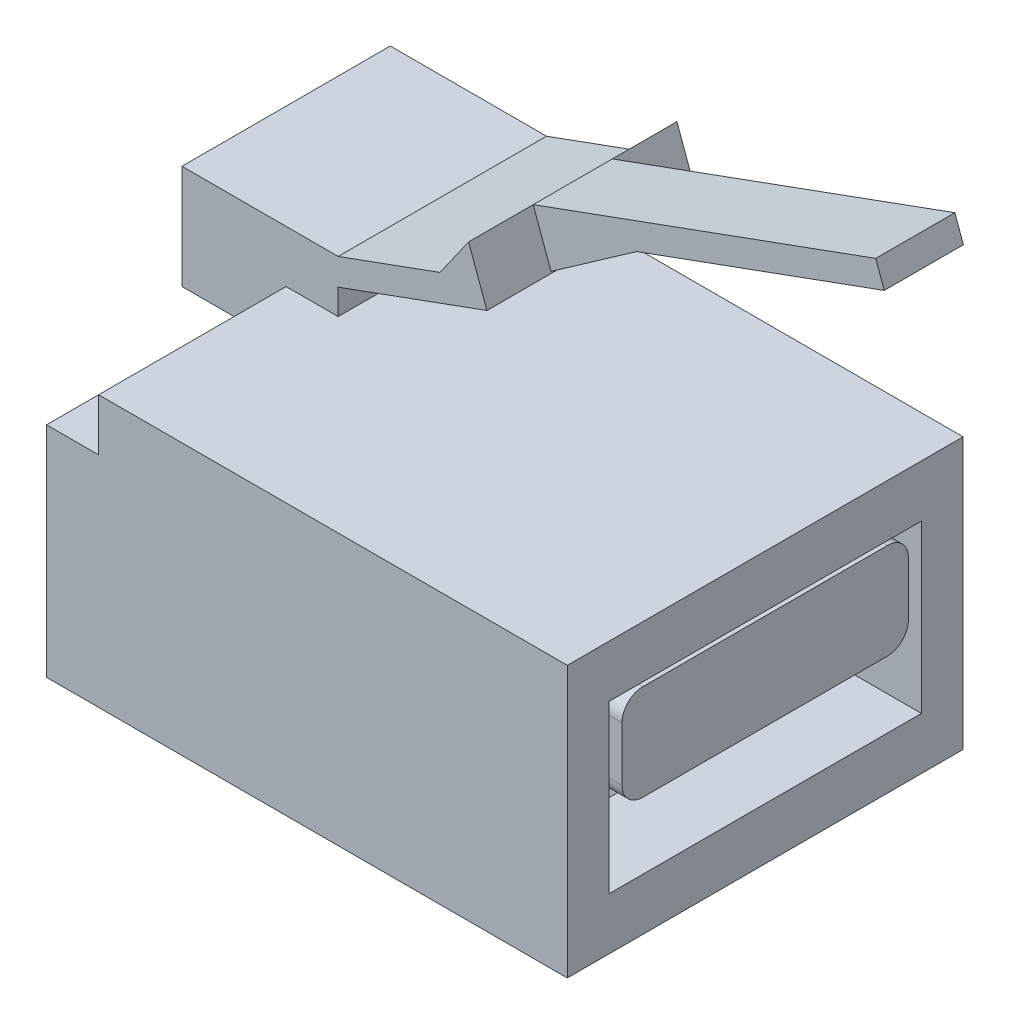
ISO-10303-21;
HEADER;
FILE_DESCRIPTION(('STEP AP214'),'2;1');
FILE_NAME('part.step','',(''),(''),'','','');
FILE_SCHEMA(('AUTOMOTIVE_DESIGN { 1 0 10303 214 1 1 1 1 }'));
ENDSEC;
DATA;
#1=APPLICATION_CONTEXT('core data for automotive mechanical design processes');
#2=APPLICATION_PROTOCOL_DEFINITION('international standard','automotive_design',2000,#1);
#3=PRODUCT_CONTEXT('',#1,'mechanical');
#4=PRODUCT('Part','Part','',(#3));
#5=PRODUCT_RELATED_PRODUCT_CATEGORY('part','',(#4));
#6=PRODUCT_DEFINITION_FORMATION('','',#4);
#7=PRODUCT_DEFINITION_CONTEXT('part definition',#1,'design');
#8=PRODUCT_DEFINITION('design','',#6,#7);
#9=PRODUCT_DEFINITION_SHAPE('','',#8);
#10=(LENGTH_UNIT() NAMED_UNIT(*) SI_UNIT(.MILLI.,.METRE.));
#11=(NAMED_UNIT(*) PLANE_ANGLE_UNIT() SI_UNIT($,.RADIAN.));
#12=(NAMED_UNIT(*) SI_UNIT($,.STERADIAN.) SOLID_ANGLE_UNIT());
#13=UNCERTAINTY_MEASURE_WITH_UNIT(LENGTH_MEASURE(1.E-05),#10,'distance_accuracy_value','');
#14=(GEOMETRIC_REPRESENTATION_CONTEXT(3) GLOBAL_UNCERTAINTY_ASSIGNED_CONTEXT((#13)) GLOBAL_UNIT_ASSIGNED_CONTEXT((#10,
#11,#12)) REPRESENTATION_CONTEXT('',''));
#15=CARTESIAN_POINT('',(0.,0.,0.));
#16=DIRECTION('',(0.,0.,1.));
#17=DIRECTION('',(1.,0.,0.));
#18=AXIS2_PLACEMENT_3D('',#15,#16,#17);
#19=CARTESIAN_POINT('',(6.07071421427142,8.41147228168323,-13.8628090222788));
#20=DIRECTION('',(0.939661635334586,0.342105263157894,0.));
#21=DIRECTION('',(-0.342105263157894,0.939661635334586,0.));
#22=AXIS2_PLACEMENT_3D('',#19,#20,#21);
#23=PLANE('',#22);
#24=DIRECTION('',(-0.342105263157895,0.939661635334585,0.));
#25=VECTOR('',#24,1.);
#26=CARTESIAN_POINT('',(5.63134704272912,9.61828351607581,-7.95));
#27=LINE('',#26,#25);
#28=CARTESIAN_POINT('',(6.05897862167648,8.44370647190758,-7.95000000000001));
#29=VERTEX_POINT('',#28);
#30=CARTESIAN_POINT('',(5.63134704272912,9.61828351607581,-7.95));
#31=VERTEX_POINT('',#30);
#32=EDGE_CURVE('E49',#29,#31,#27,.T.);
#33=ORIENTED_EDGE('',*,*,#32,.F.);
#34=DIRECTION('',(0.,0.,1.));
#35=VECTOR('',#34,1.);
#36=CARTESIAN_POINT('',(6.05897862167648,8.44370647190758,-13.8628090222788));
#37=LINE('',#36,#35);
#38=CARTESIAN_POINT('',(6.05897862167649,8.44370647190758,-6.05));
#39=VERTEX_POINT('',#38);
#40=EDGE_CURVE('E866',#29,#39,#37,.T.);
#41=ORIENTED_EDGE('',*,*,#40,.T.);
#42=DIRECTION('',(0.342105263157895,-0.939661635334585,0.));
#43=VECTOR('',#42,1.);
#44=CARTESIAN_POINT('',(5.83661020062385,9.05448653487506,-6.05));
#45=LINE('',#44,#43);
#46=CARTESIAN_POINT('',(5.63134704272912,9.61828351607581,-6.05));
#47=VERTEX_POINT('',#46);
#48=EDGE_CURVE('E56',#47,#39,#45,.T.);
#49=ORIENTED_EDGE('',*,*,#48,.F.);
#50=DIRECTION('',(0.,0.,1.));
#51=VECTOR('',#50,1.);
#52=CARTESIAN_POINT('',(5.63134704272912,9.61828351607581,-13.8628090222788));
#53=LINE('',#52,#51);
#54=CARTESIAN_POINT('',(5.63134704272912,9.61828351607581,-4.5));
#55=VERTEX_POINT('',#54);
#56=EDGE_CURVE('E852',#47,#55,#53,.T.);
#57=ORIENTED_EDGE('',*,*,#56,.T.);
#58=DIRECTION('',(-0.342105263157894,0.939661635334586,0.));
#59=VECTOR('',#58,1.);
#60=CARTESIAN_POINT('',(6.07071421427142,8.41147228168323,-4.5));
#61=LINE('',#60,#59);
#62=CARTESIAN_POINT('',(6.07071421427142,8.41147228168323,-4.5));
#63=VERTEX_POINT('',#62);
#64=EDGE_CURVE('E907',#63,#55,#61,.T.);
#65=ORIENTED_EDGE('',*,*,#64,.F.);
#66=DIRECTION('',(0.,0.,1.));
#67=VECTOR('',#66,1.);
#68=CARTESIAN_POINT('',(6.07071421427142,8.41147228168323,-13.8628090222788));
#69=LINE('',#68,#67);
#70=CARTESIAN_POINT('',(6.07071421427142,8.41147228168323,-9.5));
#71=VERTEX_POINT('',#70);
#72=EDGE_CURVE('E863',#71,#63,#69,.T.);
#73=ORIENTED_EDGE('',*,*,#72,.F.);
#74=DIRECTION('',(0.342105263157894,-0.939661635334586,0.));
#75=VECTOR('',#74,1.);
#76=CARTESIAN_POINT('',(6.07071421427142,8.41147228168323,-9.5));
#77=LINE('',#76,#75);
#78=CARTESIAN_POINT('',(5.63134704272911,9.61828351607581,-9.5));
#79=VERTEX_POINT('',#78);
#80=EDGE_CURVE('E897',#79,#71,#77,.T.);
#81=ORIENTED_EDGE('',*,*,#80,.F.);
#82=EDGE_CURVE('E862',#79,#31,#53,.T.);
#83=ORIENTED_EDGE('',*,*,#82,.T.);
#84=EDGE_LOOP('',(#33,#41,#49,#57,#65,#73,#81,#83));
#85=FACE_BOUND('',#84,.T.);
#86=ADVANCED_FACE('F34',(#85),#23,.T.);
#87=CARTESIAN_POINT('',(0.4624954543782,0.298191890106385,-12.8112400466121));
#88=DIRECTION('',(0.,1.,0.));
#89=DIRECTION('',(0.,0.,1.));
#90=AXIS2_PLACEMENT_3D('',#87,#88,#89);
#91=PLANE('',#90);
#92=DIRECTION('',(0.,0.,1.));
#93=VECTOR('',#92,1.);
#94=CARTESIAN_POINT('',(0.741330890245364,0.298191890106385,-12.8112400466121));
#95=LINE('',#94,#93);
#96=CARTESIAN_POINT('',(0.741330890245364,0.298191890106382,-3.06730769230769));
#97=VERTEX_POINT('',#96);
#98=CARTESIAN_POINT('',(0.741330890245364,0.298191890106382,-2.58653846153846));
#99=VERTEX_POINT('',#98);
#100=EDGE_CURVE('E1132',#97,#99,#95,.T.);
#101=ORIENTED_EDGE('',*,*,#100,.F.);
#102=DIRECTION('',(-1.,0.,0.));
#103=VECTOR('',#102,1.);
#104=CARTESIAN_POINT('',(1.25,0.298191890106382,-3.06730769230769));
#105=LINE('',#104,#103);
#106=CARTESIAN_POINT('',(0.4624954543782,0.298191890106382,-3.06730769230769));
#107=VERTEX_POINT('',#106);
#108=EDGE_CURVE('E1277',#97,#107,#105,.T.);
#109=ORIENTED_EDGE('',*,*,#108,.T.);
#110=DIRECTION('',(0.,0.,1.));
#111=VECTOR('',#110,1.);
#112=CARTESIAN_POINT('',(0.4624954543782,0.298191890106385,-12.8112400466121));
#113=LINE('',#112,#111);
#114=CARTESIAN_POINT('',(0.4624954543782,0.298191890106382,-2.58653846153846));
#115=VERTEX_POINT('',#114);
#116=EDGE_CURVE('E1193',#107,#115,#113,.T.);
#117=ORIENTED_EDGE('',*,*,#116,.T.);
#118=DIRECTION('',(1.,0.,0.));
#119=VECTOR('',#118,1.);
#120=CARTESIAN_POINT('',(1.25,0.298191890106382,-2.58653846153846));
#121=LINE('',#120,#119);
#122=EDGE_CURVE('E1281',#115,#99,#121,.T.);
#123=ORIENTED_EDGE('',*,*,#122,.T.);
#124=EDGE_LOOP('',(#101,#109,#117,#123));
#125=FACE_BOUND('',#124,.T.);
#126=ADVANCED_FACE('F1828',(#125),#91,.T.);
#127=DIRECTION('',(0.,0.,1.));
#128=VECTOR('',#127,1.);
#129=CARTESIAN_POINT('',(0.741330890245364,0.298191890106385,-12.8112400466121));
#130=LINE('',#129,#128);
#131=CARTESIAN_POINT('',(0.741330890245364,0.298191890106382,-4.02884615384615));
#132=VERTEX_POINT('',#131);
#133=CARTESIAN_POINT('',(0.741330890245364,0.298191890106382,-3.54807692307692));
#134=VERTEX_POINT('',#133);
#135=EDGE_CURVE('E1125',#132,#134,#130,.T.);
#136=ORIENTED_EDGE('',*,*,#135,.F.);
#137=DIRECTION('',(-1.,0.,0.));
#138=VECTOR('',#137,1.);
#139=CARTESIAN_POINT('',(1.25,0.298191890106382,-4.02884615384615));
#140=LINE('',#139,#138);
#141=CARTESIAN_POINT('',(0.4624954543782,0.298191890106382,-4.02884615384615));
#142=VERTEX_POINT('',#141);
#143=EDGE_CURVE('E1270',#132,#142,#140,.T.);
#144=ORIENTED_EDGE('',*,*,#143,.T.);
#145=CARTESIAN_POINT('',(0.4624954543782,0.298191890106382,-3.54807692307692));
#146=VERTEX_POINT('',#145);
#147=EDGE_CURVE('E1222',#142,#146,#113,.T.);
#148=ORIENTED_EDGE('',*,*,#147,.T.);
#149=DIRECTION('',(1.,0.,0.));
#150=VECTOR('',#149,1.);
#151=CARTESIAN_POINT('',(1.25,0.298191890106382,-3.54807692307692));
#152=LINE('',#151,#150);
#153=EDGE_CURVE('E1274',#146,#134,#152,.T.);
#154=ORIENTED_EDGE('',*,*,#153,.T.);
#155=EDGE_LOOP('',(#136,#144,#148,#154));
#156=FACE_BOUND('',#155,.T.);
#157=ADVANCED_FACE('F1834',(#156),#91,.T.);
#158=DIRECTION('',(0.,0.,1.));
#159=VECTOR('',#158,1.);
#160=CARTESIAN_POINT('',(0.741330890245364,0.298191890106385,-12.8112400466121));
#161=LINE('',#160,#159);
#162=CARTESIAN_POINT('',(0.741330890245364,0.298191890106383,-4.99038461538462));
#163=VERTEX_POINT('',#162);
#164=CARTESIAN_POINT('',(0.741330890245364,0.298191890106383,-4.50961538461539));
#165=VERTEX_POINT('',#164);
#166=EDGE_CURVE('E1118',#163,#165,#161,.T.);
#167=ORIENTED_EDGE('',*,*,#166,.F.);
#168=DIRECTION('',(-1.,0.,0.));
#169=VECTOR('',#168,1.);
#170=CARTESIAN_POINT('',(1.25,0.298191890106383,-4.99038461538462));
#171=LINE('',#170,#169);
#172=CARTESIAN_POINT('',(0.4624954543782,0.298191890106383,-4.99038461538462));
#173=VERTEX_POINT('',#172);
#174=EDGE_CURVE('E1263',#163,#173,#171,.T.);
#175=ORIENTED_EDGE('',*,*,#174,.T.);
#176=CARTESIAN_POINT('',(0.4624954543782,0.298191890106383,-4.50961538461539));
#177=VERTEX_POINT('',#176);
#178=EDGE_CURVE('E2529',#173,#177,#113,.T.);
#179=ORIENTED_EDGE('',*,*,#178,.T.);
#180=DIRECTION('',(1.,0.,0.));
#181=VECTOR('',#180,1.);
#182=CARTESIAN_POINT('',(1.25,0.298191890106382,-4.50961538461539));
#183=LINE('',#182,#181);
#184=EDGE_CURVE('E1267',#177,#165,#183,.T.);
#185=ORIENTED_EDGE('',*,*,#184,.T.);
#186=EDGE_LOOP('',(#167,#175,#179,#185));
#187=FACE_BOUND('',#186,.T.);
#188=ADVANCED_FACE('F2546',(#187),#91,.T.);
#189=DIRECTION('',(0.,0.,1.));
#190=VECTOR('',#189,1.);
#191=CARTESIAN_POINT('',(0.741330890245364,0.298191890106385,-12.8112400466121));
#192=LINE('',#191,#190);
#193=CARTESIAN_POINT('',(0.741330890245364,0.298191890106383,-5.95192307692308));
#194=VERTEX_POINT('',#193);
#195=CARTESIAN_POINT('',(0.741330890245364,0.298191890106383,-5.47115384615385));
#196=VERTEX_POINT('',#195);
#197=EDGE_CURVE('E1111',#194,#196,#192,.T.);
#198=ORIENTED_EDGE('',*,*,#197,.F.);
#199=DIRECTION('',(-1.,0.,0.));
#200=VECTOR('',#199,1.);
#201=CARTESIAN_POINT('',(1.25,0.298191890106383,-5.95192307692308));
#202=LINE('',#201,#200);
#203=CARTESIAN_POINT('',(0.4624954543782,0.298191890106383,-5.95192307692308));
#204=VERTEX_POINT('',#203);
#205=EDGE_CURVE('E1256',#194,#204,#202,.T.);
#206=ORIENTED_EDGE('',*,*,#205,.T.);
#207=CARTESIAN_POINT('',(0.4624954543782,0.298191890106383,-5.47115384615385));
#208=VERTEX_POINT('',#207);
#209=EDGE_CURVE('E2527',#204,#208,#113,.T.);
#210=ORIENTED_EDGE('',*,*,#209,.T.);
#211=DIRECTION('',(1.,0.,0.));
#212=VECTOR('',#211,1.);
#213=CARTESIAN_POINT('',(1.25,0.298191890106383,-5.47115384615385));
#214=LINE('',#213,#212);
#215=EDGE_CURVE('E1260',#208,#196,#214,.T.);
#216=ORIENTED_EDGE('',*,*,#215,.T.);
#217=EDGE_LOOP('',(#198,#206,#210,#216));
#218=FACE_BOUND('',#217,.T.);
#219=ADVANCED_FACE('F2548',(#218),#91,.T.);
#220=DIRECTION('',(0.,0.,1.));
#221=VECTOR('',#220,1.);
#222=CARTESIAN_POINT('',(0.741330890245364,0.298191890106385,-12.8112400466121));
#223=LINE('',#222,#221);
#224=CARTESIAN_POINT('',(0.741330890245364,0.298191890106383,-6.91346153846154));
#225=VERTEX_POINT('',#224);
#226=CARTESIAN_POINT('',(0.741330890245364,0.298191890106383,-6.43269230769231));
#227=VERTEX_POINT('',#226);
#228=EDGE_CURVE('E1792',#225,#227,#223,.T.);
#229=ORIENTED_EDGE('',*,*,#228,.F.);
#230=DIRECTION('',(-1.,0.,0.));
#231=VECTOR('',#230,1.);
#232=CARTESIAN_POINT('',(1.25,0.298191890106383,-6.91346153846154));
#233=LINE('',#232,#231);
#234=CARTESIAN_POINT('',(0.4624954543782,0.298191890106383,-6.91346153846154));
#235=VERTEX_POINT('',#234);
#236=EDGE_CURVE('E1778',#225,#235,#233,.T.);
#237=ORIENTED_EDGE('',*,*,#236,.T.);
#238=CARTESIAN_POINT('',(0.4624954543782,0.298191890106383,-6.43269230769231));
#239=VERTEX_POINT('',#238);
#240=EDGE_CURVE('E1204',#235,#239,#113,.T.);
#241=ORIENTED_EDGE('',*,*,#240,.T.);
#242=DIRECTION('',(1.,0.,0.));
#243=VECTOR('',#242,1.);
#244=CARTESIAN_POINT('',(1.25,0.298191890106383,-6.43269230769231));
#245=LINE('',#244,#243);
#246=EDGE_CURVE('E1253',#239,#227,#245,.T.);
#247=ORIENTED_EDGE('',*,*,#246,.T.);
#248=EDGE_LOOP('',(#229,#237,#241,#247));
#249=FACE_BOUND('',#248,.T.);
#250=ADVANCED_FACE('F2204',(#249),#91,.T.);
#251=CARTESIAN_POINT('',(1.25,0.,-2.58653846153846));
#252=DIRECTION('',(0.,0.,-1.));
#253=DIRECTION('',(0.,1.,0.));
#254=AXIS2_PLACEMENT_3D('',#251,#252,#253);
#255=PLANE('',#254);
#256=DIRECTION('',(-0.831418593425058,0.555646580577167,0.));
#257=VECTOR('',#256,1.);
#258=CARTESIAN_POINT('',(1.17235229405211,-0.116184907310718,-2.58653846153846));
#259=LINE('',#258,#257);
#260=CARTESIAN_POINT('',(0.844589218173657,0.102862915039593,-2.58653846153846));
#261=VERTEX_POINT('',#260);
#262=CARTESIAN_POINT('',(0.741330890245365,0.171871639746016,-2.58653846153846));
#263=VERTEX_POINT('',#262);
#264=EDGE_CURVE('E1191',#261,#263,#259,.T.);
#265=ORIENTED_EDGE('',*,*,#264,.T.);
#266=DIRECTION('',(0.,1.,0.));
#267=VECTOR('',#266,1.);
#268=CARTESIAN_POINT('',(0.741330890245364,0.,-2.58653846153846));
#269=LINE('',#268,#267);
#270=EDGE_CURVE('E1137',#263,#99,#269,.T.);
#271=ORIENTED_EDGE('',*,*,#270,.T.);
#272=ORIENTED_EDGE('',*,*,#122,.F.);
#273=DIRECTION('',(0.,-1.,0.));
#274=VECTOR('',#273,1.);
#275=CARTESIAN_POINT('',(0.4624954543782,0.,-2.58653846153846));
#276=LINE('',#275,#274);
#277=CARTESIAN_POINT('',(0.4624954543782,2.5,-2.58653846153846));
#278=VERTEX_POINT('',#277);
#279=EDGE_CURVE('E1312',#278,#115,#276,.T.);
#280=ORIENTED_EDGE('',*,*,#279,.F.);
#281=DIRECTION('',(-1.,0.,0.));
#282=VECTOR('',#281,1.);
#283=CARTESIAN_POINT('',(1.25,2.5,-2.58653846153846));
#284=LINE('',#283,#282);
#285=CARTESIAN_POINT('',(0.,2.5,-2.58653846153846));
#286=VERTEX_POINT('',#285);
#287=EDGE_CURVE('E1689',#278,#286,#284,.T.);
#288=ORIENTED_EDGE('',*,*,#287,.T.);
#289=DIRECTION('',(0.,-1.,0.));
#290=VECTOR('',#289,1.);
#291=CARTESIAN_POINT('',(0.,0.,-2.58653846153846));
#292=LINE('',#291,#290);
#293=CARTESIAN_POINT('',(0.,0.,-2.58653846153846));
#294=VERTEX_POINT('',#293);
#295=EDGE_CURVE('E1600',#286,#294,#292,.T.);
#296=ORIENTED_EDGE('',*,*,#295,.T.);
#297=DIRECTION('',(-1.,0.,0.));
#298=VECTOR('',#297,1.);
#299=CARTESIAN_POINT('',(1.25,0.,-2.58653846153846));
#300=LINE('',#299,#298);
#301=CARTESIAN_POINT('',(5.,0.,-2.58653846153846));
#302=VERTEX_POINT('',#301);
#303=EDGE_CURVE('E1686',#302,#294,#300,.T.);
#304=ORIENTED_EDGE('',*,*,#303,.F.);
#305=DIRECTION('',(0.,-1.,0.));
#306=VECTOR('',#305,1.);
#307=CARTESIAN_POINT('',(5.,0.,-2.58653846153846));
#308=LINE('',#307,#306);
#309=CARTESIAN_POINT('',(5.,1.,-2.58653846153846));
#310=VERTEX_POINT('',#309);
#311=EDGE_CURVE('E1490',#310,#302,#308,.T.);
#312=ORIENTED_EDGE('',*,*,#311,.F.);
#313=DIRECTION('',(-1.,0.,0.));
#314=VECTOR('',#313,1.);
#315=CARTESIAN_POINT('',(5.,1.,-2.58653846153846));
#316=LINE('',#315,#314);
#317=CARTESIAN_POINT('',(4.78010796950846,1.,-2.58653846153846));
#318=VERTEX_POINT('',#317);
#319=EDGE_CURVE('E1540',#310,#318,#316,.T.);
#320=ORIENTED_EDGE('',*,*,#319,.T.);
#321=DIRECTION('',(0.,1.,0.));
#322=VECTOR('',#321,1.);
#323=CARTESIAN_POINT('',(4.78010796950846,0.,-2.58653846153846));
#324=LINE('',#323,#322);
#325=CARTESIAN_POINT('',(4.78010796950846,0.298191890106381,-2.58653846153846));
#326=VERTEX_POINT('',#325);
#327=EDGE_CURVE('E1207',#326,#318,#324,.T.);
#328=ORIENTED_EDGE('',*,*,#327,.F.);
#329=CARTESIAN_POINT('',(4.5012725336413,0.298191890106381,-2.58653846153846));
#330=VERTEX_POINT('',#329);
#331=EDGE_CURVE('E1280',#330,#326,#121,.T.);
#332=ORIENTED_EDGE('',*,*,#331,.F.);
#333=DIRECTION('',(0.,-1.,0.));
#334=VECTOR('',#333,1.);
#335=CARTESIAN_POINT('',(4.5012725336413,0.,-2.58653846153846));
#336=LINE('',#335,#334);
#337=CARTESIAN_POINT('',(4.5012725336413,0.171871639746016,-2.58653846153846));
#338=VERTEX_POINT('',#337);
#339=EDGE_CURVE('E1105',#330,#338,#336,.T.);
#340=ORIENTED_EDGE('',*,*,#339,.T.);
#341=DIRECTION('',(-0.831418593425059,-0.555646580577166,0.));
#342=VECTOR('',#341,1.);
#343=CARTESIAN_POINT('',(2.17440765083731,-1.38319884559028,-2.58653846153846));
#344=LINE('',#343,#342);
#345=CARTESIAN_POINT('',(4.39801420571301,0.102862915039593,-2.58653846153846));
#346=VERTEX_POINT('',#345);
#347=EDGE_CURVE('E1155',#338,#346,#344,.T.);
#348=ORIENTED_EDGE('',*,*,#347,.T.);
#349=DIRECTION('',(-1.,0.,0.));
#350=VECTOR('',#349,1.);
#351=CARTESIAN_POINT('',(1.25,0.102862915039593,-2.58653846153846));
#352=LINE('',#351,#350);
#353=EDGE_CURVE('E1173',#346,#261,#352,.T.);
#354=ORIENTED_EDGE('',*,*,#353,.T.);
#355=EDGE_LOOP('',(#265,#271,#272,#280,#288,#296,#304,#312,#320,#328,#332,#340,#348,#354));
#356=FACE_BOUND('',#355,.T.);
#357=ADVANCED_FACE('F2201',(#356),#255,.F.);
#358=CARTESIAN_POINT('',(1.25,2.5,-2.58653846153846));
#359=DIRECTION('',(0.,1.,0.));
#360=DIRECTION('',(0.,0.,1.));
#361=AXIS2_PLACEMENT_3D('',#358,#359,#360);
#362=PLANE('',#361);
#363=DIRECTION('',(0.,0.,-1.));
#364=VECTOR('',#363,1.);
#365=CARTESIAN_POINT('',(0.4624954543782,2.5,-2.58653846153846));
#366=LINE('',#365,#364);
#367=CARTESIAN_POINT('',(0.4624954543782,2.5,-2.10576923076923));
#368=VERTEX_POINT('',#367);
#369=EDGE_CURVE('E1310',#368,#278,#366,.T.);
#370=ORIENTED_EDGE('',*,*,#369,.F.);
#371=DIRECTION('',(-1.,0.,0.));
#372=VECTOR('',#371,1.);
#373=CARTESIAN_POINT('',(1.25,2.5,-2.10576923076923));
#374=LINE('',#373,#372);
#375=CARTESIAN_POINT('',(0.,2.5,-2.10576923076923));
#376=VERTEX_POINT('',#375);
#377=EDGE_CURVE('E1642',#368,#376,#374,.T.);
#378=ORIENTED_EDGE('',*,*,#377,.T.);
#379=DIRECTION('',(0.,0.,-1.));
#380=VECTOR('',#379,1.);
#381=CARTESIAN_POINT('',(0.,2.5,-2.58653846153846));
#382=LINE('',#381,#380);
#383=EDGE_CURVE('E1597',#376,#286,#382,.T.);
#384=ORIENTED_EDGE('',*,*,#383,.T.);
#385=ORIENTED_EDGE('',*,*,#287,.F.);
#386=EDGE_LOOP('',(#370,#378,#384,#385));
#387=FACE_BOUND('',#386,.T.);
#388=ADVANCED_FACE('F2199',(#387),#362,.F.);
#389=CARTESIAN_POINT('',(1.25,2.5,-3.06730769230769));
#390=DIRECTION('',(0.,0.,1.));
#391=DIRECTION('',(0.,-1.,0.));
#392=AXIS2_PLACEMENT_3D('',#389,#390,#391);
#393=PLANE('',#392);
#394=ORIENTED_EDGE('',*,*,#108,.F.);
#395=DIRECTION('',(0.,-1.,0.));
#396=VECTOR('',#395,1.);
#397=CARTESIAN_POINT('',(0.741330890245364,2.5,-3.06730769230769));
#398=LINE('',#397,#396);
#399=CARTESIAN_POINT('',(0.741330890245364,0.171871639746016,-3.06730769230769));
#400=VERTEX_POINT('',#399);
#401=EDGE_CURVE('E1135',#97,#400,#398,.T.);
#402=ORIENTED_EDGE('',*,*,#401,.T.);
#403=DIRECTION('',(0.831418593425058,-0.555646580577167,0.));
#404=VECTOR('',#403,1.);
#405=CARTESIAN_POINT('',(0.0174150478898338,0.655672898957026,-3.06730769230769));
#406=LINE('',#405,#404);
#407=CARTESIAN_POINT('',(0.844589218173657,0.102862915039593,-3.06730769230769));
#408=VERTEX_POINT('',#407);
#409=EDGE_CURVE('E1189',#400,#408,#406,.T.);
#410=ORIENTED_EDGE('',*,*,#409,.T.);
#411=DIRECTION('',(1.,0.,0.));
#412=VECTOR('',#411,1.);
#413=CARTESIAN_POINT('',(1.25,0.102862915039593,-3.06730769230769));
#414=LINE('',#413,#412);
#415=CARTESIAN_POINT('',(4.39801420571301,0.102862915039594,-3.06730769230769));
#416=VERTEX_POINT('',#415);
#417=EDGE_CURVE('E1171',#408,#416,#414,.T.);
#418=ORIENTED_EDGE('',*,*,#417,.T.);
#419=DIRECTION('',(0.831418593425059,0.555646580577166,0.));
#420=VECTOR('',#419,1.);
#421=CARTESIAN_POINT('',(3.32934489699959,-0.611341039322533,-3.06730769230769));
#422=LINE('',#421,#420);
#423=CARTESIAN_POINT('',(4.5012725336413,0.171871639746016,-3.06730769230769));
#424=VERTEX_POINT('',#423);
#425=EDGE_CURVE('E1153',#416,#424,#422,.T.);
#426=ORIENTED_EDGE('',*,*,#425,.T.);
#427=DIRECTION('',(0.,1.,0.));
#428=VECTOR('',#427,1.);
#429=CARTESIAN_POINT('',(4.5012725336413,2.5,-3.06730769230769));
#430=LINE('',#429,#428);
#431=CARTESIAN_POINT('',(4.5012725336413,0.298191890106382,-3.06730769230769));
#432=VERTEX_POINT('',#431);
#433=EDGE_CURVE('E1102',#424,#432,#430,.T.);
#434=ORIENTED_EDGE('',*,*,#433,.T.);
#435=CARTESIAN_POINT('',(4.78010796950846,0.298191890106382,-3.06730769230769));
#436=VERTEX_POINT('',#435);
#437=EDGE_CURVE('E1278',#436,#432,#105,.T.);
#438=ORIENTED_EDGE('',*,*,#437,.F.);
#439=DIRECTION('',(0.,-1.,0.));
#440=VECTOR('',#439,1.);
#441=CARTESIAN_POINT('',(4.78010796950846,2.5,-3.06730769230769));
#442=LINE('',#441,#440);
#443=CARTESIAN_POINT('',(4.78010796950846,1.,-3.06730769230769));
#444=VERTEX_POINT('',#443);
#445=EDGE_CURVE('E1228',#444,#436,#442,.T.);
#446=ORIENTED_EDGE('',*,*,#445,.F.);
#447=DIRECTION('',(-1.,0.,0.));
#448=VECTOR('',#447,1.);
#449=CARTESIAN_POINT('',(5.,1.,-3.06730769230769));
#450=LINE('',#449,#448);
#451=CARTESIAN_POINT('',(5.,1.,-3.06730769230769));
#452=VERTEX_POINT('',#451);
#453=EDGE_CURVE('E1572',#452,#444,#450,.T.);
#454=ORIENTED_EDGE('',*,*,#453,.F.);
#455=DIRECTION('',(0.,1.,0.));
#456=VECTOR('',#455,1.);
#457=CARTESIAN_POINT('',(5.,1.,-3.06730769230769));
#458=LINE('',#457,#456);
#459=CARTESIAN_POINT('',(5.,0.,-3.06730769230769));
#460=VERTEX_POINT('',#459);
#461=EDGE_CURVE('E1493',#460,#452,#458,.T.);
#462=ORIENTED_EDGE('',*,*,#461,.F.);
#463=DIRECTION('',(-1.,0.,0.));
#464=VECTOR('',#463,1.);
#465=CARTESIAN_POINT('',(1.25,0.,-3.06730769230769));
#466=LINE('',#465,#464);
#467=CARTESIAN_POINT('',(0.,0.,-3.06730769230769));
#468=VERTEX_POINT('',#467);
#469=EDGE_CURVE('E1684',#460,#468,#466,.T.);
#470=ORIENTED_EDGE('',*,*,#469,.T.);
#471=DIRECTION('',(0.,1.,0.));
#472=VECTOR('',#471,1.);
#473=CARTESIAN_POINT('',(0.,2.5,-3.06730769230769));
#474=LINE('',#473,#472);
#475=CARTESIAN_POINT('',(0.,2.5,-3.06730769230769));
#476=VERTEX_POINT('',#475);
#477=EDGE_CURVE('E1602',#468,#476,#474,.T.);
#478=ORIENTED_EDGE('',*,*,#477,.T.);
#479=DIRECTION('',(-1.,0.,0.));
#480=VECTOR('',#479,1.);
#481=CARTESIAN_POINT('',(1.25,2.5,-3.06730769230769));
#482=LINE('',#481,#480);
#483=CARTESIAN_POINT('',(0.4624954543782,2.5,-3.06730769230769));
#484=VERTEX_POINT('',#483);
#485=EDGE_CURVE('E1682',#484,#476,#482,.T.);
#486=ORIENTED_EDGE('',*,*,#485,.F.);
#487=DIRECTION('',(0.,1.,0.));
#488=VECTOR('',#487,1.);
#489=CARTESIAN_POINT('',(0.4624954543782,2.5,-3.06730769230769));
#490=LINE('',#489,#488);
#491=EDGE_CURVE('E1308',#107,#484,#490,.T.);
#492=ORIENTED_EDGE('',*,*,#491,.F.);
#493=EDGE_LOOP('',(#394,#402,#410,#418,#426,#434,#438,#446,#454,#462,#470,#478,#486,#492));
#494=FACE_BOUND('',#493,.T.);
#495=ADVANCED_FACE('F2192',(#494),#393,.F.);
#496=CARTESIAN_POINT('',(1.25,0.,-3.54807692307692));
#497=DIRECTION('',(0.,0.,-1.));
#498=DIRECTION('',(0.,1.,0.));
#499=AXIS2_PLACEMENT_3D('',#496,#497,#498);
#500=PLANE('',#499);
#501=DIRECTION('',(-0.831418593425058,0.555646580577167,0.));
#502=VECTOR('',#501,1.);
#503=CARTESIAN_POINT('',(1.17235229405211,-0.116184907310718,-3.54807692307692));
#504=LINE('',#503,#502);
#505=CARTESIAN_POINT('',(0.844589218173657,0.102862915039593,-3.54807692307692));
#506=VERTEX_POINT('',#505);
#507=CARTESIAN_POINT('',(0.741330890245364,0.171871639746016,-3.54807692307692));
#508=VERTEX_POINT('',#507);
#509=EDGE_CURVE('E1187',#506,#508,#504,.T.);
#510=ORIENTED_EDGE('',*,*,#509,.T.);
#511=DIRECTION('',(0.,1.,0.));
#512=VECTOR('',#511,1.);
#513=CARTESIAN_POINT('',(0.741330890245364,0.,-3.54807692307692));
#514=LINE('',#513,#512);
#515=EDGE_CURVE('E1130',#508,#134,#514,.T.);
#516=ORIENTED_EDGE('',*,*,#515,.T.);
#517=ORIENTED_EDGE('',*,*,#153,.F.);
#518=DIRECTION('',(0.,-1.,0.));
#519=VECTOR('',#518,1.);
#520=CARTESIAN_POINT('',(0.4624954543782,0.,-3.54807692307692));
#521=LINE('',#520,#519);
#522=CARTESIAN_POINT('',(0.4624954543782,2.5,-3.54807692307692));
#523=VERTEX_POINT('',#522);
#524=EDGE_CURVE('E1306',#523,#146,#521,.T.);
#525=ORIENTED_EDGE('',*,*,#524,.F.);
#526=DIRECTION('',(-1.,0.,0.));
#527=VECTOR('',#526,1.);
#528=CARTESIAN_POINT('',(1.25,2.5,-3.54807692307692));
#529=LINE('',#528,#527);
#530=CARTESIAN_POINT('',(0.,2.5,-3.54807692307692));
#531=VERTEX_POINT('',#530);
#532=EDGE_CURVE('E1680',#523,#531,#529,.T.);
#533=ORIENTED_EDGE('',*,*,#532,.T.);
#534=DIRECTION('',(0.,-1.,0.));
#535=VECTOR('',#534,1.);
#536=CARTESIAN_POINT('',(0.,0.,-3.54807692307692));
#537=LINE('',#536,#535);
#538=CARTESIAN_POINT('',(0.,0.,-3.54807692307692));
#539=VERTEX_POINT('',#538);
#540=EDGE_CURVE('E1608',#531,#539,#537,.T.);
#541=ORIENTED_EDGE('',*,*,#540,.T.);
#542=DIRECTION('',(-1.,0.,0.));
#543=VECTOR('',#542,1.);
#544=CARTESIAN_POINT('',(1.25,0.,-3.54807692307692));
#545=LINE('',#544,#543);
#546=CARTESIAN_POINT('',(5.,0.,-3.54807692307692));
#547=VERTEX_POINT('',#546);
#548=EDGE_CURVE('E1677',#547,#539,#545,.T.);
#549=ORIENTED_EDGE('',*,*,#548,.F.);
#550=DIRECTION('',(0.,-1.,0.));
#551=VECTOR('',#550,1.);
#552=CARTESIAN_POINT('',(5.,0.,-3.54807692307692));
#553=LINE('',#552,#551);
#554=CARTESIAN_POINT('',(5.,1.,-3.54807692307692));
#555=VERTEX_POINT('',#554);
#556=EDGE_CURVE('E1499',#555,#547,#553,.T.);
#557=ORIENTED_EDGE('',*,*,#556,.F.);
#558=DIRECTION('',(-1.,0.,0.));
#559=VECTOR('',#558,1.);
#560=CARTESIAN_POINT('',(5.,1.,-3.54807692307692));
#561=LINE('',#560,#559);
#562=CARTESIAN_POINT('',(4.78010796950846,1.,-3.54807692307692));
#563=VERTEX_POINT('',#562);
#564=EDGE_CURVE('E1569',#555,#563,#561,.T.);
#565=ORIENTED_EDGE('',*,*,#564,.T.);
#566=DIRECTION('',(0.,1.,0.));
#567=VECTOR('',#566,1.);
#568=CARTESIAN_POINT('',(4.78010796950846,0.,-3.54807692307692));
#569=LINE('',#568,#567);
#570=CARTESIAN_POINT('',(4.78010796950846,0.298191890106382,-3.54807692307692));
#571=VERTEX_POINT('',#570);
#572=EDGE_CURVE('E1226',#571,#563,#569,.T.);
#573=ORIENTED_EDGE('',*,*,#572,.F.);
#574=CARTESIAN_POINT('',(4.5012725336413,0.298191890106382,-3.54807692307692));
#575=VERTEX_POINT('',#574);
#576=EDGE_CURVE('E1273',#575,#571,#152,.T.);
#577=ORIENTED_EDGE('',*,*,#576,.F.);
#578=DIRECTION('',(0.,-1.,0.));
#579=VECTOR('',#578,1.);
#580=CARTESIAN_POINT('',(4.5012725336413,0.,-3.54807692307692));
#581=LINE('',#580,#579);
#582=CARTESIAN_POINT('',(4.5012725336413,0.171871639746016,-3.54807692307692));
#583=VERTEX_POINT('',#582);
#584=EDGE_CURVE('E1097',#575,#583,#581,.T.);
#585=ORIENTED_EDGE('',*,*,#584,.T.);
#586=DIRECTION('',(-0.831418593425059,-0.555646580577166,0.));
#587=VECTOR('',#586,1.);
#588=CARTESIAN_POINT('',(2.17440765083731,-1.38319884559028,-3.54807692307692));
#589=LINE('',#588,#587);
#590=CARTESIAN_POINT('',(4.39801420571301,0.102862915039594,-3.54807692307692));
#591=VERTEX_POINT('',#590);
#592=EDGE_CURVE('E1151',#583,#591,#589,.T.);
#593=ORIENTED_EDGE('',*,*,#592,.T.);
#594=DIRECTION('',(-1.,0.,0.));
#595=VECTOR('',#594,1.);
#596=CARTESIAN_POINT('',(1.25,0.102862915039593,-3.54807692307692));
#597=LINE('',#596,#595);
#598=EDGE_CURVE('E1169',#591,#506,#597,.T.);
#599=ORIENTED_EDGE('',*,*,#598,.T.);
#600=EDGE_LOOP('',(#510,#516,#517,#525,#533,#541,#549,#557,#565,#573,#577,#585,#593,#599));
#601=FACE_BOUND('',#600,.T.);
#602=ADVANCED_FACE('F2189',(#601),#500,.F.);
#603=CARTESIAN_POINT('',(1.25,2.5,-3.54807692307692));
#604=DIRECTION('',(0.,1.,0.));
#605=DIRECTION('',(0.,0.,1.));
#606=AXIS2_PLACEMENT_3D('',#603,#604,#605);
#607=PLANE('',#606);
#608=DIRECTION('',(0.,0.,-1.));
#609=VECTOR('',#608,1.);
#610=CARTESIAN_POINT('',(0.4624954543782,2.5,-3.54807692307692));
#611=LINE('',#610,#609);
#612=EDGE_CURVE('E1304',#484,#523,#611,.T.);
#613=ORIENTED_EDGE('',*,*,#612,.F.);
#614=ORIENTED_EDGE('',*,*,#485,.T.);
#615=DIRECTION('',(0.,0.,-1.));
#616=VECTOR('',#615,1.);
#617=CARTESIAN_POINT('',(0.,2.5,-3.54807692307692));
#618=LINE('',#617,#616);
#619=EDGE_CURVE('E1605',#476,#531,#618,.T.);
#620=ORIENTED_EDGE('',*,*,#619,.T.);
#621=ORIENTED_EDGE('',*,*,#532,.F.);
#622=EDGE_LOOP('',(#613,#614,#620,#621));
#623=FACE_BOUND('',#622,.T.);
#624=ADVANCED_FACE('F2187',(#623),#607,.F.);
#625=CARTESIAN_POINT('',(1.25,2.5,-4.02884615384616));
#626=DIRECTION('',(0.,0.,1.));
#627=DIRECTION('',(0.,-1.,0.));
#628=AXIS2_PLACEMENT_3D('',#625,#626,#627);
#629=PLANE('',#628);
#630=ORIENTED_EDGE('',*,*,#143,.F.);
#631=DIRECTION('',(0.,-1.,0.));
#632=VECTOR('',#631,1.);
#633=CARTESIAN_POINT('',(0.741330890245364,2.5,-4.02884615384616));
#634=LINE('',#633,#632);
#635=CARTESIAN_POINT('',(0.741330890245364,0.171871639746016,-4.02884615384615));
#636=VERTEX_POINT('',#635);
#637=EDGE_CURVE('E1128',#132,#636,#634,.T.);
#638=ORIENTED_EDGE('',*,*,#637,.T.);
#639=DIRECTION('',(0.831418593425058,-0.555646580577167,0.));
#640=VECTOR('',#639,1.);
#641=CARTESIAN_POINT('',(0.0174150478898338,0.655672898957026,-4.02884615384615));
#642=LINE('',#641,#640);
#643=CARTESIAN_POINT('',(0.844589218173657,0.102862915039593,-4.02884615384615));
#644=VERTEX_POINT('',#643);
#645=EDGE_CURVE('E1185',#636,#644,#642,.T.);
#646=ORIENTED_EDGE('',*,*,#645,.T.);
#647=DIRECTION('',(1.,0.,0.));
#648=VECTOR('',#647,1.);
#649=CARTESIAN_POINT('',(1.25,0.102862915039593,-4.02884615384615));
#650=LINE('',#649,#648);
#651=CARTESIAN_POINT('',(4.39801420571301,0.102862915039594,-4.02884615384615));
#652=VERTEX_POINT('',#651);
#653=EDGE_CURVE('E1167',#644,#652,#650,.T.);
#654=ORIENTED_EDGE('',*,*,#653,.T.);
#655=DIRECTION('',(0.831418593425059,0.555646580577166,0.));
#656=VECTOR('',#655,1.);
#657=CARTESIAN_POINT('',(3.32934489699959,-0.611341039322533,-4.02884615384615));
#658=LINE('',#657,#656);
#659=CARTESIAN_POINT('',(4.5012725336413,0.171871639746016,-4.02884615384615));
#660=VERTEX_POINT('',#659);
#661=EDGE_CURVE('E1149',#652,#660,#658,.T.);
#662=ORIENTED_EDGE('',*,*,#661,.T.);
#663=DIRECTION('',(0.,1.,0.));
#664=VECTOR('',#663,1.);
#665=CARTESIAN_POINT('',(4.5012725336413,2.5,-4.02884615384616));
#666=LINE('',#665,#664);
#667=CARTESIAN_POINT('',(4.5012725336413,0.298191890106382,-4.02884615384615));
#668=VERTEX_POINT('',#667);
#669=EDGE_CURVE('E1094',#660,#668,#666,.T.);
#670=ORIENTED_EDGE('',*,*,#669,.T.);
#671=CARTESIAN_POINT('',(4.78010796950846,0.298191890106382,-4.02884615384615));
#672=VERTEX_POINT('',#671);
#673=EDGE_CURVE('E1271',#672,#668,#140,.T.);
#674=ORIENTED_EDGE('',*,*,#673,.F.);
#675=DIRECTION('',(0.,-1.,0.));
#676=VECTOR('',#675,1.);
#677=CARTESIAN_POINT('',(4.78010796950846,2.5,-4.02884615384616));
#678=LINE('',#677,#676);
#679=CARTESIAN_POINT('',(4.78010796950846,1.,-4.02884615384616));
#680=VERTEX_POINT('',#679);
#681=EDGE_CURVE('E1234',#680,#672,#678,.T.);
#682=ORIENTED_EDGE('',*,*,#681,.F.);
#683=DIRECTION('',(-1.,0.,0.));
#684=VECTOR('',#683,1.);
#685=CARTESIAN_POINT('',(5.,1.,-4.02884615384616));
#686=LINE('',#685,#684);
#687=CARTESIAN_POINT('',(5.,1.,-4.02884615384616));
#688=VERTEX_POINT('',#687);
#689=EDGE_CURVE('E1566',#688,#680,#686,.T.);
#690=ORIENTED_EDGE('',*,*,#689,.F.);
#691=DIRECTION('',(0.,1.,0.));
#692=VECTOR('',#691,1.);
#693=CARTESIAN_POINT('',(5.,1.,-4.02884615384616));
#694=LINE('',#693,#692);
#695=CARTESIAN_POINT('',(5.,0.,-4.02884615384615));
#696=VERTEX_POINT('',#695);
#697=EDGE_CURVE('E1502',#696,#688,#694,.T.);
#698=ORIENTED_EDGE('',*,*,#697,.F.);
#699=DIRECTION('',(-1.,0.,0.));
#700=VECTOR('',#699,1.);
#701=CARTESIAN_POINT('',(1.25,0.,-4.02884615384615));
#702=LINE('',#701,#700);
#703=CARTESIAN_POINT('',(0.,0.,-4.02884615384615));
#704=VERTEX_POINT('',#703);
#705=EDGE_CURVE('E1675',#696,#704,#702,.T.);
#706=ORIENTED_EDGE('',*,*,#705,.T.);
#707=DIRECTION('',(0.,1.,0.));
#708=VECTOR('',#707,1.);
#709=CARTESIAN_POINT('',(0.,2.5,-4.02884615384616));
#710=LINE('',#709,#708);
#711=CARTESIAN_POINT('',(0.,2.5,-4.02884615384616));
#712=VERTEX_POINT('',#711);
#713=EDGE_CURVE('E1610',#704,#712,#710,.T.);
#714=ORIENTED_EDGE('',*,*,#713,.T.);
#715=DIRECTION('',(-1.,0.,0.));
#716=VECTOR('',#715,1.);
#717=CARTESIAN_POINT('',(1.25,2.5,-4.02884615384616));
#718=LINE('',#717,#716);
#719=CARTESIAN_POINT('',(0.4624954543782,2.5,-4.02884615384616));
#720=VERTEX_POINT('',#719);
#721=EDGE_CURVE('E1673',#720,#712,#718,.T.);
#722=ORIENTED_EDGE('',*,*,#721,.F.);
#723=DIRECTION('',(0.,1.,0.));
#724=VECTOR('',#723,1.);
#725=CARTESIAN_POINT('',(0.4624954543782,2.5,-4.02884615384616));
#726=LINE('',#725,#724);
#727=EDGE_CURVE('E1302',#142,#720,#726,.T.);
#728=ORIENTED_EDGE('',*,*,#727,.F.);
#729=EDGE_LOOP('',(#630,#638,#646,#654,#662,#670,#674,#682,#690,#698,#706,#714,#722,#728));
#730=FACE_BOUND('',#729,.T.);
#731=ADVANCED_FACE('F2180',(#730),#629,.F.);
#732=CARTESIAN_POINT('',(1.25,0.,-4.50961538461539));
#733=DIRECTION('',(0.,0.,-1.));
#734=DIRECTION('',(-1.,0.,0.));
#735=AXIS2_PLACEMENT_3D('',#732,#733,#734);
#736=PLANE('',#735);
#737=DIRECTION('',(-0.831418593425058,0.555646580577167,0.));
#738=VECTOR('',#737,1.);
#739=CARTESIAN_POINT('',(1.17235229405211,-0.116184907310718,-4.50961538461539));
#740=LINE('',#739,#738);
#741=CARTESIAN_POINT('',(0.844589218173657,0.102862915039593,-4.50961538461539));
#742=VERTEX_POINT('',#741);
#743=CARTESIAN_POINT('',(0.741330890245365,0.171871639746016,-4.50961538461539));
#744=VERTEX_POINT('',#743);
#745=EDGE_CURVE('E1183',#742,#744,#740,.T.);
#746=ORIENTED_EDGE('',*,*,#745,.T.);
#747=DIRECTION('',(0.,1.,0.));
#748=VECTOR('',#747,1.);
#749=CARTESIAN_POINT('',(0.741330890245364,0.,-4.50961538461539));
#750=LINE('',#749,#748);
#751=EDGE_CURVE('E1123',#744,#165,#750,.T.);
#752=ORIENTED_EDGE('',*,*,#751,.T.);
#753=ORIENTED_EDGE('',*,*,#184,.F.);
#754=DIRECTION('',(0.,-1.,0.));
#755=VECTOR('',#754,1.);
#756=CARTESIAN_POINT('',(0.4624954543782,0.,-4.50961538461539));
#757=LINE('',#756,#755);
#758=CARTESIAN_POINT('',(0.4624954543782,2.5,-4.50961538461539));
#759=VERTEX_POINT('',#758);
#760=EDGE_CURVE('E1300',#759,#177,#757,.T.);
#761=ORIENTED_EDGE('',*,*,#760,.F.);
#762=DIRECTION('',(-1.,0.,0.));
#763=VECTOR('',#762,1.);
#764=CARTESIAN_POINT('',(1.25,2.5,-4.50961538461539));
#765=LINE('',#764,#763);
#766=CARTESIAN_POINT('',(0.,2.5,-4.50961538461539));
#767=VERTEX_POINT('',#766);
#768=EDGE_CURVE('E1671',#759,#767,#765,.T.);
#769=ORIENTED_EDGE('',*,*,#768,.T.);
#770=DIRECTION('',(0.,-1.,0.));
#771=VECTOR('',#770,1.);
#772=CARTESIAN_POINT('',(0.,0.,-4.50961538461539));
#773=LINE('',#772,#771);
#774=CARTESIAN_POINT('',(0.,0.,-4.50961538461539));
#775=VERTEX_POINT('',#774);
#776=EDGE_CURVE('E1616',#767,#775,#773,.T.);
#777=ORIENTED_EDGE('',*,*,#776,.T.);
#778=DIRECTION('',(-1.,0.,0.));
#779=VECTOR('',#778,1.);
#780=CARTESIAN_POINT('',(1.25,0.,-4.50961538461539));
#781=LINE('',#780,#779);
#782=CARTESIAN_POINT('',(5.,0.,-4.50961538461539));
#783=VERTEX_POINT('',#782);
#784=EDGE_CURVE('E1668',#783,#775,#781,.T.);
#785=ORIENTED_EDGE('',*,*,#784,.F.);
#786=DIRECTION('',(0.,-1.,0.));
#787=VECTOR('',#786,1.);
#788=CARTESIAN_POINT('',(5.,0.,-4.50961538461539));
#789=LINE('',#788,#787);
#790=CARTESIAN_POINT('',(5.,1.,-4.50961538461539));
#791=VERTEX_POINT('',#790);
#792=EDGE_CURVE('E1508',#791,#783,#789,.T.);
#793=ORIENTED_EDGE('',*,*,#792,.F.);
#794=DIRECTION('',(-1.,0.,0.));
#795=VECTOR('',#794,1.);
#796=CARTESIAN_POINT('',(5.,1.,-4.50961538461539));
#797=LINE('',#796,#795);
#798=CARTESIAN_POINT('',(4.78010796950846,1.,-4.50961538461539));
#799=VERTEX_POINT('',#798);
#800=EDGE_CURVE('E1563',#791,#799,#797,.T.);
#801=ORIENTED_EDGE('',*,*,#800,.T.);
#802=DIRECTION('',(0.,1.,0.));
#803=VECTOR('',#802,1.);
#804=CARTESIAN_POINT('',(4.78010796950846,0.,-4.50961538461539));
#805=LINE('',#804,#803);
#806=CARTESIAN_POINT('',(4.78010796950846,0.298191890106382,-4.50961538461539));
#807=VERTEX_POINT('',#806);
#808=EDGE_CURVE('E1232',#807,#799,#805,.T.);
#809=ORIENTED_EDGE('',*,*,#808,.F.);
#810=CARTESIAN_POINT('',(4.5012725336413,0.298191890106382,-4.50961538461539));
#811=VERTEX_POINT('',#810);
#812=EDGE_CURVE('E1266',#811,#807,#183,.T.);
#813=ORIENTED_EDGE('',*,*,#812,.F.);
#814=DIRECTION('',(0.,-1.,0.));
#815=VECTOR('',#814,1.);
#816=CARTESIAN_POINT('',(4.5012725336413,0.,-4.50961538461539));
#817=LINE('',#816,#815);
#818=CARTESIAN_POINT('',(4.5012725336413,0.171871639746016,-4.50961538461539));
#819=VERTEX_POINT('',#818);
#820=EDGE_CURVE('E1089',#811,#819,#817,.T.);
#821=ORIENTED_EDGE('',*,*,#820,.T.);
#822=DIRECTION('',(-0.831418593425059,-0.555646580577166,0.));
#823=VECTOR('',#822,1.);
#824=CARTESIAN_POINT('',(2.17440765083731,-1.38319884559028,-4.50961538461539));
#825=LINE('',#824,#823);
#826=CARTESIAN_POINT('',(4.39801420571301,0.102862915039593,-4.50961538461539));
#827=VERTEX_POINT('',#826);
#828=EDGE_CURVE('E1147',#819,#827,#825,.T.);
#829=ORIENTED_EDGE('',*,*,#828,.T.);
#830=DIRECTION('',(-1.,0.,0.));
#831=VECTOR('',#830,1.);
#832=CARTESIAN_POINT('',(1.25,0.102862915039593,-4.50961538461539));
#833=LINE('',#832,#831);
#834=EDGE_CURVE('E1165',#827,#742,#833,.T.);
#835=ORIENTED_EDGE('',*,*,#834,.T.);
#836=EDGE_LOOP('',(#746,#752,#753,#761,#769,#777,#785,#793,#801,#809,#813,#821,#829,#835));
#837=FACE_BOUND('',#836,.T.);
#838=ADVANCED_FACE('F2177',(#837),#736,.F.);
#839=CARTESIAN_POINT('',(1.25,2.5,-4.50961538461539));
#840=DIRECTION('',(0.,1.,0.));
#841=DIRECTION('',(0.,0.,1.));
#842=AXIS2_PLACEMENT_3D('',#839,#840,#841);
#843=PLANE('',#842);
#844=DIRECTION('',(0.,0.,-1.));
#845=VECTOR('',#844,1.);
#846=CARTESIAN_POINT('',(0.4624954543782,2.5,-4.50961538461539));
#847=LINE('',#846,#845);
#848=EDGE_CURVE('E1298',#720,#759,#847,.T.);
#849=ORIENTED_EDGE('',*,*,#848,.F.);
#850=ORIENTED_EDGE('',*,*,#721,.T.);
#851=DIRECTION('',(0.,0.,-1.));
#852=VECTOR('',#851,1.);
#853=CARTESIAN_POINT('',(0.,2.5,-4.50961538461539));
#854=LINE('',#853,#852);
#855=EDGE_CURVE('E1613',#712,#767,#854,.T.);
#856=ORIENTED_EDGE('',*,*,#855,.T.);
#857=ORIENTED_EDGE('',*,*,#768,.F.);
#858=EDGE_LOOP('',(#849,#850,#856,#857));
#859=FACE_BOUND('',#858,.T.);
#860=ADVANCED_FACE('F2175',(#859),#843,.F.);
#861=CARTESIAN_POINT('',(1.25,2.5,-4.99038461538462));
#862=DIRECTION('',(0.,0.,1.));
#863=DIRECTION('',(1.,0.,0.));
#864=AXIS2_PLACEMENT_3D('',#861,#862,#863);
#865=PLANE('',#864);
#866=ORIENTED_EDGE('',*,*,#174,.F.);
#867=DIRECTION('',(0.,-1.,0.));
#868=VECTOR('',#867,1.);
#869=CARTESIAN_POINT('',(0.741330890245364,2.5,-4.99038461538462));
#870=LINE('',#869,#868);
#871=CARTESIAN_POINT('',(0.741330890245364,0.171871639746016,-4.99038461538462));
#872=VERTEX_POINT('',#871);
#873=EDGE_CURVE('E1121',#163,#872,#870,.T.);
#874=ORIENTED_EDGE('',*,*,#873,.T.);
#875=DIRECTION('',(0.831418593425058,-0.555646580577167,0.));
#876=VECTOR('',#875,1.);
#877=CARTESIAN_POINT('',(0.017415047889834,0.655672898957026,-4.99038461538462));
#878=LINE('',#877,#876);
#879=CARTESIAN_POINT('',(0.844589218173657,0.102862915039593,-4.99038461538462));
#880=VERTEX_POINT('',#879);
#881=EDGE_CURVE('E1181',#872,#880,#878,.T.);
#882=ORIENTED_EDGE('',*,*,#881,.T.);
#883=DIRECTION('',(1.,0.,0.));
#884=VECTOR('',#883,1.);
#885=CARTESIAN_POINT('',(1.25,0.102862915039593,-4.99038461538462));
#886=LINE('',#885,#884);
#887=CARTESIAN_POINT('',(4.39801420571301,0.102862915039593,-4.99038461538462));
#888=VERTEX_POINT('',#887);
#889=EDGE_CURVE('E1163',#880,#888,#886,.T.);
#890=ORIENTED_EDGE('',*,*,#889,.T.);
#891=DIRECTION('',(0.831418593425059,0.555646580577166,0.));
#892=VECTOR('',#891,1.);
#893=CARTESIAN_POINT('',(3.32934489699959,-0.611341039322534,-4.99038461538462));
#894=LINE('',#893,#892);
#895=CARTESIAN_POINT('',(4.5012725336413,0.171871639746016,-4.99038461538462));
#896=VERTEX_POINT('',#895);
#897=EDGE_CURVE('E1145',#888,#896,#894,.T.);
#898=ORIENTED_EDGE('',*,*,#897,.T.);
#899=DIRECTION('',(0.,1.,0.));
#900=VECTOR('',#899,1.);
#901=CARTESIAN_POINT('',(4.5012725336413,2.5,-4.99038461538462));
#902=LINE('',#901,#900);
#903=CARTESIAN_POINT('',(4.5012725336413,0.298191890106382,-4.99038461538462));
#904=VERTEX_POINT('',#903);
#905=EDGE_CURVE('E1086',#896,#904,#902,.T.);
#906=ORIENTED_EDGE('',*,*,#905,.T.);
#907=CARTESIAN_POINT('',(4.78010796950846,0.298191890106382,-4.99038461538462));
#908=VERTEX_POINT('',#907);
#909=EDGE_CURVE('E1264',#908,#904,#171,.T.);
#910=ORIENTED_EDGE('',*,*,#909,.F.);
#911=DIRECTION('',(0.,-1.,0.));
#912=VECTOR('',#911,1.);
#913=CARTESIAN_POINT('',(4.78010796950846,2.5,-4.99038461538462));
#914=LINE('',#913,#912);
#915=CARTESIAN_POINT('',(4.78010796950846,1.,-4.99038461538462));
#916=VERTEX_POINT('',#915);
#917=EDGE_CURVE('E1240',#916,#908,#914,.T.);
#918=ORIENTED_EDGE('',*,*,#917,.F.);
#919=DIRECTION('',(-1.,0.,0.));
#920=VECTOR('',#919,1.);
#921=CARTESIAN_POINT('',(5.,1.,-4.99038461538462));
#922=LINE('',#921,#920);
#923=CARTESIAN_POINT('',(5.,1.,-4.99038461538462));
#924=VERTEX_POINT('',#923);
#925=EDGE_CURVE('E1560',#924,#916,#922,.T.);
#926=ORIENTED_EDGE('',*,*,#925,.F.);
#927=DIRECTION('',(0.,1.,0.));
#928=VECTOR('',#927,1.);
#929=CARTESIAN_POINT('',(5.,1.,-4.99038461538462));
#930=LINE('',#929,#928);
#931=CARTESIAN_POINT('',(5.,0.,-4.99038461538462));
#932=VERTEX_POINT('',#931);
#933=EDGE_CURVE('E1511',#932,#924,#930,.T.);
#934=ORIENTED_EDGE('',*,*,#933,.F.);
#935=DIRECTION('',(-1.,0.,0.));
#936=VECTOR('',#935,1.);
#937=CARTESIAN_POINT('',(1.25,0.,-4.99038461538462));
#938=LINE('',#937,#936);
#939=CARTESIAN_POINT('',(0.,0.,-4.99038461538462));
#940=VERTEX_POINT('',#939);
#941=EDGE_CURVE('E1666',#932,#940,#938,.T.);
#942=ORIENTED_EDGE('',*,*,#941,.T.);
#943=DIRECTION('',(0.,1.,0.));
#944=VECTOR('',#943,1.);
#945=CARTESIAN_POINT('',(0.,2.5,-4.99038461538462));
#946=LINE('',#945,#944);
#947=CARTESIAN_POINT('',(0.,2.5,-4.99038461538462));
#948=VERTEX_POINT('',#947);
#949=EDGE_CURVE('E1618',#940,#948,#946,.T.);
#950=ORIENTED_EDGE('',*,*,#949,.T.);
#951=DIRECTION('',(-1.,0.,0.));
#952=VECTOR('',#951,1.);
#953=CARTESIAN_POINT('',(1.25,2.5,-4.99038461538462));
#954=LINE('',#953,#952);
#955=CARTESIAN_POINT('',(0.4624954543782,2.5,-4.99038461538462));
#956=VERTEX_POINT('',#955);
#957=EDGE_CURVE('E1664',#956,#948,#954,.T.);
#958=ORIENTED_EDGE('',*,*,#957,.F.);
#959=DIRECTION('',(0.,1.,0.));
#960=VECTOR('',#959,1.);
#961=CARTESIAN_POINT('',(0.4624954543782,2.5,-4.99038461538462));
#962=LINE('',#961,#960);
#963=EDGE_CURVE('E1296',#173,#956,#962,.T.);
#964=ORIENTED_EDGE('',*,*,#963,.F.);
#965=EDGE_LOOP('',(#866,#874,#882,#890,#898,#906,#910,#918,#926,#934,#942,#950,#958,#964));
#966=FACE_BOUND('',#965,.T.);
#967=ADVANCED_FACE('F2168',(#966),#865,.F.);
#968=CARTESIAN_POINT('',(1.25,0.,-5.47115384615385));
#969=DIRECTION('',(0.,0.,-1.));
#970=DIRECTION('',(0.,1.,0.));
#971=AXIS2_PLACEMENT_3D('',#968,#969,#970);
#972=PLANE('',#971);
#973=DIRECTION('',(-0.831418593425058,0.555646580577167,0.));
#974=VECTOR('',#973,1.);
#975=CARTESIAN_POINT('',(1.17235229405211,-0.116184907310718,-5.47115384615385));
#976=LINE('',#975,#974);
#977=CARTESIAN_POINT('',(0.844589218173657,0.102862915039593,-5.47115384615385));
#978=VERTEX_POINT('',#977);
#979=CARTESIAN_POINT('',(0.741330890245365,0.171871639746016,-5.47115384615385));
#980=VERTEX_POINT('',#979);
#981=EDGE_CURVE('E1179',#978,#980,#976,.T.);
#982=ORIENTED_EDGE('',*,*,#981,.T.);
#983=DIRECTION('',(0.,1.,0.));
#984=VECTOR('',#983,1.);
#985=CARTESIAN_POINT('',(0.741330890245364,0.,-5.47115384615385));
#986=LINE('',#985,#984);
#987=EDGE_CURVE('E1116',#980,#196,#986,.T.);
#988=ORIENTED_EDGE('',*,*,#987,.T.);
#989=ORIENTED_EDGE('',*,*,#215,.F.);
#990=DIRECTION('',(0.,-1.,0.));
#991=VECTOR('',#990,1.);
#992=CARTESIAN_POINT('',(0.4624954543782,0.,-5.47115384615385));
#993=LINE('',#992,#991);
#994=CARTESIAN_POINT('',(0.4624954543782,2.5,-5.47115384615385));
#995=VERTEX_POINT('',#994);
#996=EDGE_CURVE('E1294',#995,#208,#993,.T.);
#997=ORIENTED_EDGE('',*,*,#996,.F.);
#998=DIRECTION('',(-1.,0.,0.));
#999=VECTOR('',#998,1.);
#1000=CARTESIAN_POINT('',(1.25,2.5,-5.47115384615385));
#1001=LINE('',#1000,#999);
#1002=CARTESIAN_POINT('',(0.,2.5,-5.47115384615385));
#1003=VERTEX_POINT('',#1002);
#1004=EDGE_CURVE('E1662',#995,#1003,#1001,.T.);
#1005=ORIENTED_EDGE('',*,*,#1004,.T.);
#1006=DIRECTION('',(0.,-1.,0.));
#1007=VECTOR('',#1006,1.);
#1008=CARTESIAN_POINT('',(0.,0.,-5.47115384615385));
#1009=LINE('',#1008,#1007);
#1010=CARTESIAN_POINT('',(0.,0.,-5.47115384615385));
#1011=VERTEX_POINT('',#1010);
#1012=EDGE_CURVE('E1624',#1003,#1011,#1009,.T.);
#1013=ORIENTED_EDGE('',*,*,#1012,.T.);
#1014=DIRECTION('',(-1.,0.,0.));
#1015=VECTOR('',#1014,1.);
#1016=CARTESIAN_POINT('',(1.25,0.,-5.47115384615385));
#1017=LINE('',#1016,#1015);
#1018=CARTESIAN_POINT('',(5.,0.,-5.47115384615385));
#1019=VERTEX_POINT('',#1018);
#1020=EDGE_CURVE('E1659',#1019,#1011,#1017,.T.);
#1021=ORIENTED_EDGE('',*,*,#1020,.F.);
#1022=DIRECTION('',(0.,-1.,0.));
#1023=VECTOR('',#1022,1.);
#1024=CARTESIAN_POINT('',(5.,0.,-5.47115384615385));
#1025=LINE('',#1024,#1023);
#1026=CARTESIAN_POINT('',(5.,1.,-5.47115384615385));
#1027=VERTEX_POINT('',#1026);
#1028=EDGE_CURVE('E1517',#1027,#1019,#1025,.T.);
#1029=ORIENTED_EDGE('',*,*,#1028,.F.);
#1030=DIRECTION('',(-1.,0.,0.));
#1031=VECTOR('',#1030,1.);
#1032=CARTESIAN_POINT('',(5.,1.,-5.47115384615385));
#1033=LINE('',#1032,#1031);
#1034=CARTESIAN_POINT('',(4.78010796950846,1.,-5.47115384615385));
#1035=VERTEX_POINT('',#1034);
#1036=EDGE_CURVE('E1557',#1027,#1035,#1033,.T.);
#1037=ORIENTED_EDGE('',*,*,#1036,.T.);
#1038=DIRECTION('',(0.,1.,0.));
#1039=VECTOR('',#1038,1.);
#1040=CARTESIAN_POINT('',(4.78010796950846,0.,-5.47115384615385));
#1041=LINE('',#1040,#1039);
#1042=CARTESIAN_POINT('',(4.78010796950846,0.298191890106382,-5.47115384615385));
#1043=VERTEX_POINT('',#1042);
#1044=EDGE_CURVE('E1238',#1043,#1035,#1041,.T.);
#1045=ORIENTED_EDGE('',*,*,#1044,.F.);
#1046=CARTESIAN_POINT('',(4.5012725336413,0.298191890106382,-5.47115384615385));
#1047=VERTEX_POINT('',#1046);
#1048=EDGE_CURVE('E1259',#1047,#1043,#214,.T.);
#1049=ORIENTED_EDGE('',*,*,#1048,.F.);
#1050=DIRECTION('',(0.,-1.,0.));
#1051=VECTOR('',#1050,1.);
#1052=CARTESIAN_POINT('',(4.5012725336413,0.,-5.47115384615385));
#1053=LINE('',#1052,#1051);
#1054=CARTESIAN_POINT('',(4.5012725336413,0.171871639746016,-5.47115384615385));
#1055=VERTEX_POINT('',#1054);
#1056=EDGE_CURVE('E1081',#1047,#1055,#1053,.T.);
#1057=ORIENTED_EDGE('',*,*,#1056,.T.);
#1058=DIRECTION('',(-0.831418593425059,-0.555646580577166,0.));
#1059=VECTOR('',#1058,1.);
#1060=CARTESIAN_POINT('',(2.17440765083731,-1.38319884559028,-5.47115384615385));
#1061=LINE('',#1060,#1059);
#1062=CARTESIAN_POINT('',(4.39801420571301,0.102862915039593,-5.47115384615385));
#1063=VERTEX_POINT('',#1062);
#1064=EDGE_CURVE('E1143',#1055,#1063,#1061,.T.);
#1065=ORIENTED_EDGE('',*,*,#1064,.T.);
#1066=DIRECTION('',(-1.,0.,0.));
#1067=VECTOR('',#1066,1.);
#1068=CARTESIAN_POINT('',(1.25,0.102862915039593,-5.47115384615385));
#1069=LINE('',#1068,#1067);
#1070=EDGE_CURVE('E1161',#1063,#978,#1069,.T.);
#1071=ORIENTED_EDGE('',*,*,#1070,.T.);
#1072=EDGE_LOOP('',(#982,#988,#989,#997,#1005,#1013,#1021,#1029,#1037,#1045,#1049,#1057,#1065,#1071));
#1073=FACE_BOUND('',#1072,.T.);
#1074=ADVANCED_FACE('F2165',(#1073),#972,.F.);
#1075=CARTESIAN_POINT('',(1.25,2.5,-5.47115384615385));
#1076=DIRECTION('',(0.,1.,0.));
#1077=DIRECTION('',(0.,0.,1.));
#1078=AXIS2_PLACEMENT_3D('',#1075,#1076,#1077);
#1079=PLANE('',#1078);
#1080=DIRECTION('',(0.,0.,-1.));
#1081=VECTOR('',#1080,1.);
#1082=CARTESIAN_POINT('',(0.4624954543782,2.5,-5.47115384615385));
#1083=LINE('',#1082,#1081);
#1084=EDGE_CURVE('E1292',#956,#995,#1083,.T.);
#1085=ORIENTED_EDGE('',*,*,#1084,.F.);
#1086=ORIENTED_EDGE('',*,*,#957,.T.);
#1087=DIRECTION('',(0.,0.,-1.));
#1088=VECTOR('',#1087,1.);
#1089=CARTESIAN_POINT('',(0.,2.5,-5.47115384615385));
#1090=LINE('',#1089,#1088);
#1091=EDGE_CURVE('E1621',#948,#1003,#1090,.T.);
#1092=ORIENTED_EDGE('',*,*,#1091,.T.);
#1093=ORIENTED_EDGE('',*,*,#1004,.F.);
#1094=EDGE_LOOP('',(#1085,#1086,#1092,#1093));
#1095=FACE_BOUND('',#1094,.T.);
#1096=ADVANCED_FACE('F2163',(#1095),#1079,.F.);
#1097=CARTESIAN_POINT('',(1.25,2.5,-5.95192307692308));
#1098=DIRECTION('',(0.,0.,1.));
#1099=DIRECTION('',(1.,0.,0.));
#1100=AXIS2_PLACEMENT_3D('',#1097,#1098,#1099);
#1101=PLANE('',#1100);
#1102=ORIENTED_EDGE('',*,*,#205,.F.);
#1103=DIRECTION('',(0.,-1.,0.));
#1104=VECTOR('',#1103,1.);
#1105=CARTESIAN_POINT('',(0.741330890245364,2.5,-5.95192307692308));
#1106=LINE('',#1105,#1104);
#1107=CARTESIAN_POINT('',(0.741330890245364,0.171871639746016,-5.95192307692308));
#1108=VERTEX_POINT('',#1107);
#1109=EDGE_CURVE('E1114',#194,#1108,#1106,.T.);
#1110=ORIENTED_EDGE('',*,*,#1109,.T.);
#1111=DIRECTION('',(0.831418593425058,-0.555646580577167,0.));
#1112=VECTOR('',#1111,1.);
#1113=CARTESIAN_POINT('',(0.017415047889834,0.655672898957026,-5.95192307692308));
#1114=LINE('',#1113,#1112);
#1115=CARTESIAN_POINT('',(0.844589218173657,0.102862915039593,-5.95192307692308));
#1116=VERTEX_POINT('',#1115);
#1117=EDGE_CURVE('E1177',#1108,#1116,#1114,.T.);
#1118=ORIENTED_EDGE('',*,*,#1117,.T.);
#1119=DIRECTION('',(1.,0.,0.));
#1120=VECTOR('',#1119,1.);
#1121=CARTESIAN_POINT('',(1.25,0.102862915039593,-5.95192307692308));
#1122=LINE('',#1121,#1120);
#1123=CARTESIAN_POINT('',(4.39801420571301,0.102862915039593,-5.95192307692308));
#1124=VERTEX_POINT('',#1123);
#1125=EDGE_CURVE('E1159',#1116,#1124,#1122,.T.);
#1126=ORIENTED_EDGE('',*,*,#1125,.T.);
#1127=DIRECTION('',(0.831418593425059,0.555646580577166,0.));
#1128=VECTOR('',#1127,1.);
#1129=CARTESIAN_POINT('',(3.32934489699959,-0.611341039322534,-5.95192307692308));
#1130=LINE('',#1129,#1128);
#1131=CARTESIAN_POINT('',(4.5012725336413,0.171871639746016,-5.95192307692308));
#1132=VERTEX_POINT('',#1131);
#1133=EDGE_CURVE('E1141',#1124,#1132,#1130,.T.);
#1134=ORIENTED_EDGE('',*,*,#1133,.T.);
#1135=DIRECTION('',(0.,1.,0.));
#1136=VECTOR('',#1135,1.);
#1137=CARTESIAN_POINT('',(4.5012725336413,2.5,-5.95192307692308));
#1138=LINE('',#1137,#1136);
#1139=CARTESIAN_POINT('',(4.5012725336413,0.298191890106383,-5.95192307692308));
#1140=VERTEX_POINT('',#1139);
#1141=EDGE_CURVE('E1078',#1132,#1140,#1138,.T.);
#1142=ORIENTED_EDGE('',*,*,#1141,.T.);
#1143=CARTESIAN_POINT('',(4.78010796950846,0.298191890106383,-5.95192307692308));
#1144=VERTEX_POINT('',#1143);
#1145=EDGE_CURVE('E1257',#1144,#1140,#202,.T.);
#1146=ORIENTED_EDGE('',*,*,#1145,.F.);
#1147=DIRECTION('',(0.,-1.,0.));
#1148=VECTOR('',#1147,1.);
#1149=CARTESIAN_POINT('',(4.78010796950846,2.5,-5.95192307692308));
#1150=LINE('',#1149,#1148);
#1151=CARTESIAN_POINT('',(4.78010796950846,1.,-5.95192307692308));
#1152=VERTEX_POINT('',#1151);
#1153=EDGE_CURVE('E1246',#1152,#1144,#1150,.T.);
#1154=ORIENTED_EDGE('',*,*,#1153,.F.);
#1155=DIRECTION('',(-1.,0.,0.));
#1156=VECTOR('',#1155,1.);
#1157=CARTESIAN_POINT('',(5.,1.,-5.95192307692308));
#1158=LINE('',#1157,#1156);
#1159=CARTESIAN_POINT('',(5.,1.,-5.95192307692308));
#1160=VERTEX_POINT('',#1159);
#1161=EDGE_CURVE('E1554',#1160,#1152,#1158,.T.);
#1162=ORIENTED_EDGE('',*,*,#1161,.F.);
#1163=DIRECTION('',(0.,1.,0.));
#1164=VECTOR('',#1163,1.);
#1165=CARTESIAN_POINT('',(5.,0.,-5.95192307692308));
#1166=LINE('',#1165,#1164);
#1167=CARTESIAN_POINT('',(5.,0.,-5.95192307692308));
#1168=VERTEX_POINT('',#1167);
#1169=EDGE_CURVE('E1520',#1168,#1160,#1166,.T.);
#1170=ORIENTED_EDGE('',*,*,#1169,.F.);
#1171=DIRECTION('',(-1.,0.,0.));
#1172=VECTOR('',#1171,1.);
#1173=CARTESIAN_POINT('',(1.25,0.,-5.95192307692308));
#1174=LINE('',#1173,#1172);
#1175=CARTESIAN_POINT('',(0.,0.,-5.95192307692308));
#1176=VERTEX_POINT('',#1175);
#1177=EDGE_CURVE('E1657',#1168,#1176,#1174,.T.);
#1178=ORIENTED_EDGE('',*,*,#1177,.T.);
#1179=DIRECTION('',(0.,1.,0.));
#1180=VECTOR('',#1179,1.);
#1181=CARTESIAN_POINT('',(0.,2.5,-5.95192307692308));
#1182=LINE('',#1181,#1180);
#1183=CARTESIAN_POINT('',(0.,2.5,-5.95192307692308));
#1184=VERTEX_POINT('',#1183);
#1185=EDGE_CURVE('E1626',#1176,#1184,#1182,.T.);
#1186=ORIENTED_EDGE('',*,*,#1185,.T.);
#1187=DIRECTION('',(-1.,0.,0.));
#1188=VECTOR('',#1187,1.);
#1189=CARTESIAN_POINT('',(1.25,2.5,-5.95192307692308));
#1190=LINE('',#1189,#1188);
#1191=CARTESIAN_POINT('',(0.4624954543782,2.5,-5.95192307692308));
#1192=VERTEX_POINT('',#1191);
#1193=EDGE_CURVE('E1655',#1192,#1184,#1190,.T.);
#1194=ORIENTED_EDGE('',*,*,#1193,.F.);
#1195=DIRECTION('',(0.,1.,0.));
#1196=VECTOR('',#1195,1.);
#1197=CARTESIAN_POINT('',(0.4624954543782,2.5,-5.95192307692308));
#1198=LINE('',#1197,#1196);
#1199=EDGE_CURVE('E1290',#204,#1192,#1198,.T.);
#1200=ORIENTED_EDGE('',*,*,#1199,.F.);
#1201=EDGE_LOOP('',(#1102,#1110,#1118,#1126,#1134,#1142,#1146,#1154,#1162,#1170,#1178,#1186,
#1194,#1200));
#1202=FACE_BOUND('',#1201,.T.);
#1203=ADVANCED_FACE('F2156',(#1202),#1101,.F.);
#1204=CARTESIAN_POINT('',(1.25,0.,-6.43269230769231));
#1205=DIRECTION('',(0.,0.,-1.));
#1206=DIRECTION('',(-1.,0.,0.));
#1207=AXIS2_PLACEMENT_3D('',#1204,#1205,#1206);
#1208=PLANE('',#1207);
#1209=DIRECTION('',(-0.831418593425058,0.555646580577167,0.));
#1210=VECTOR('',#1209,1.);
#1211=CARTESIAN_POINT('',(1.17235229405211,-0.116184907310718,-6.43269230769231));
#1212=LINE('',#1211,#1210);
#1213=CARTESIAN_POINT('',(0.844589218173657,0.102862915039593,-6.43269230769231));
#1214=VERTEX_POINT('',#1213);
#1215=CARTESIAN_POINT('',(0.741330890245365,0.171871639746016,-6.43269230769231));
#1216=VERTEX_POINT('',#1215);
#1217=EDGE_CURVE('E1175',#1214,#1216,#1212,.T.);
#1218=ORIENTED_EDGE('',*,*,#1217,.T.);
#1219=DIRECTION('',(0.,1.,0.));
#1220=VECTOR('',#1219,1.);
#1221=CARTESIAN_POINT('',(0.741330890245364,0.,-6.43269230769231));
#1222=LINE('',#1221,#1220);
#1223=EDGE_CURVE('E1109',#1216,#227,#1222,.T.);
#1224=ORIENTED_EDGE('',*,*,#1223,.T.);
#1225=ORIENTED_EDGE('',*,*,#246,.F.);
#1226=DIRECTION('',(0.,-1.,0.));
#1227=VECTOR('',#1226,1.);
#1228=CARTESIAN_POINT('',(0.4624954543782,0.,-6.43269230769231));
#1229=LINE('',#1228,#1227);
#1230=CARTESIAN_POINT('',(0.4624954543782,2.5,-6.43269230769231));
#1231=VERTEX_POINT('',#1230);
#1232=EDGE_CURVE('E1288',#1231,#239,#1229,.T.);
#1233=ORIENTED_EDGE('',*,*,#1232,.F.);
#1234=DIRECTION('',(-1.,0.,0.));
#1235=VECTOR('',#1234,1.);
#1236=CARTESIAN_POINT('',(1.25,2.5,-6.43269230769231));
#1237=LINE('',#1236,#1235);
#1238=CARTESIAN_POINT('',(0.,2.5,-6.43269230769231));
#1239=VERTEX_POINT('',#1238);
#1240=EDGE_CURVE('E1653',#1231,#1239,#1237,.T.);
#1241=ORIENTED_EDGE('',*,*,#1240,.T.);
#1242=DIRECTION('',(0.,-1.,0.));
#1243=VECTOR('',#1242,1.);
#1244=CARTESIAN_POINT('',(0.,0.,-6.43269230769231));
#1245=LINE('',#1244,#1243);
#1246=CARTESIAN_POINT('',(0.,0.,-6.43269230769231));
#1247=VERTEX_POINT('',#1246);
#1248=EDGE_CURVE('E1632',#1239,#1247,#1245,.T.);
#1249=ORIENTED_EDGE('',*,*,#1248,.T.);
#1250=DIRECTION('',(-1.,0.,0.));
#1251=VECTOR('',#1250,1.);
#1252=CARTESIAN_POINT('',(1.25,0.,-6.43269230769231));
#1253=LINE('',#1252,#1251);
#1254=CARTESIAN_POINT('',(5.,0.,-6.43269230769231));
#1255=VERTEX_POINT('',#1254);
#1256=EDGE_CURVE('E1650',#1255,#1247,#1253,.T.);
#1257=ORIENTED_EDGE('',*,*,#1256,.F.);
#1258=DIRECTION('',(0.,-1.,0.));
#1259=VECTOR('',#1258,1.);
#1260=CARTESIAN_POINT('',(5.,0.,-6.43269230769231));
#1261=LINE('',#1260,#1259);
#1262=CARTESIAN_POINT('',(5.,1.,-6.43269230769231));
#1263=VERTEX_POINT('',#1262);
#1264=EDGE_CURVE('E1526',#1263,#1255,#1261,.T.);
#1265=ORIENTED_EDGE('',*,*,#1264,.F.);
#1266=DIRECTION('',(-1.,0.,0.));
#1267=VECTOR('',#1266,1.);
#1268=CARTESIAN_POINT('',(5.,1.,-6.43269230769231));
#1269=LINE('',#1268,#1267);
#1270=CARTESIAN_POINT('',(4.78010796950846,1.,-6.43269230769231));
#1271=VERTEX_POINT('',#1270);
#1272=EDGE_CURVE('E1551',#1263,#1271,#1269,.T.);
#1273=ORIENTED_EDGE('',*,*,#1272,.T.);
#1274=DIRECTION('',(0.,1.,0.));
#1275=VECTOR('',#1274,1.);
#1276=CARTESIAN_POINT('',(4.78010796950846,0.,-6.43269230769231));
#1277=LINE('',#1276,#1275);
#1278=CARTESIAN_POINT('',(4.78010796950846,0.298191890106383,-6.43269230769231));
#1279=VERTEX_POINT('',#1278);
#1280=EDGE_CURVE('E1244',#1279,#1271,#1277,.T.);
#1281=ORIENTED_EDGE('',*,*,#1280,.F.);
#1282=CARTESIAN_POINT('',(4.5012725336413,0.298191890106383,-6.43269230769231));
#1283=VERTEX_POINT('',#1282);
#1284=EDGE_CURVE('E1252',#1283,#1279,#245,.T.);
#1285=ORIENTED_EDGE('',*,*,#1284,.F.);
#1286=DIRECTION('',(0.,-1.,0.));
#1287=VECTOR('',#1286,1.);
#1288=CARTESIAN_POINT('',(4.5012725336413,0.,-6.43269230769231));
#1289=LINE('',#1288,#1287);
#1290=CARTESIAN_POINT('',(4.5012725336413,0.171871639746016,-6.43269230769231));
#1291=VERTEX_POINT('',#1290);
#1292=EDGE_CURVE('E1073',#1283,#1291,#1289,.T.);
#1293=ORIENTED_EDGE('',*,*,#1292,.T.);
#1294=DIRECTION('',(-0.831418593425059,-0.555646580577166,0.));
#1295=VECTOR('',#1294,1.);
#1296=CARTESIAN_POINT('',(2.17440765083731,-1.38319884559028,-6.43269230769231));
#1297=LINE('',#1296,#1295);
#1298=CARTESIAN_POINT('',(4.39801420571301,0.102862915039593,-6.43269230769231));
#1299=VERTEX_POINT('',#1298);
#1300=EDGE_CURVE('E1139',#1291,#1299,#1297,.T.);
#1301=ORIENTED_EDGE('',*,*,#1300,.T.);
#1302=DIRECTION('',(-1.,0.,0.));
#1303=VECTOR('',#1302,1.);
#1304=CARTESIAN_POINT('',(1.25,0.102862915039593,-6.43269230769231));
#1305=LINE('',#1304,#1303);
#1306=EDGE_CURVE('E1157',#1299,#1214,#1305,.T.);
#1307=ORIENTED_EDGE('',*,*,#1306,.T.);
#1308=EDGE_LOOP('',(#1218,#1224,#1225,#1233,#1241,#1249,#1257,#1265,#1273,#1281,#1285,#1293,
#1301,#1307));
#1309=FACE_BOUND('',#1308,.T.);
#1310=ADVANCED_FACE('F2153',(#1309),#1208,.F.);
#1311=CARTESIAN_POINT('',(1.25,2.5,-6.43269230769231));
#1312=DIRECTION('',(0.,1.,0.));
#1313=DIRECTION('',(0.,0.,1.));
#1314=AXIS2_PLACEMENT_3D('',#1311,#1312,#1313);
#1315=PLANE('',#1314);
#1316=DIRECTION('',(0.,0.,-1.));
#1317=VECTOR('',#1316,1.);
#1318=CARTESIAN_POINT('',(0.4624954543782,2.5,-6.43269230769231));
#1319=LINE('',#1318,#1317);
#1320=EDGE_CURVE('E1286',#1192,#1231,#1319,.T.);
#1321=ORIENTED_EDGE('',*,*,#1320,.F.);
#1322=ORIENTED_EDGE('',*,*,#1193,.T.);
#1323=DIRECTION('',(0.,0.,-1.));
#1324=VECTOR('',#1323,1.);
#1325=CARTESIAN_POINT('',(0.,2.5,-6.43269230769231));
#1326=LINE('',#1325,#1324);
#1327=EDGE_CURVE('E1629',#1184,#1239,#1326,.T.);
#1328=ORIENTED_EDGE('',*,*,#1327,.T.);
#1329=ORIENTED_EDGE('',*,*,#1240,.F.);
#1330=EDGE_LOOP('',(#1321,#1322,#1328,#1329));
#1331=FACE_BOUND('',#1330,.T.);
#1332=ADVANCED_FACE('F2148',(#1331),#1315,.F.);
#1333=CARTESIAN_POINT('',(1.25,2.5,-7.39423076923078));
#1334=DIRECTION('',(0.,1.,0.));
#1335=DIRECTION('',(0.,0.,1.));
#1336=AXIS2_PLACEMENT_3D('',#1333,#1334,#1335);
#1337=PLANE('',#1336);
#1338=DIRECTION('',(0.,0.,-1.));
#1339=VECTOR('',#1338,1.);
#1340=CARTESIAN_POINT('',(0.4624954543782,2.5,-7.39423076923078));
#1341=LINE('',#1340,#1339);
#1342=CARTESIAN_POINT('',(0.4624954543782,2.5,-6.91346153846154));
#1343=VERTEX_POINT('',#1342);
#1344=CARTESIAN_POINT('',(0.4624954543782,2.5,-7.39423076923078));
#1345=VERTEX_POINT('',#1344);
#1346=EDGE_CURVE('E1284',#1343,#1345,#1341,.T.);
#1347=ORIENTED_EDGE('',*,*,#1346,.F.);
#1348=DIRECTION('',(-1.,0.,0.));
#1349=VECTOR('',#1348,1.);
#1350=CARTESIAN_POINT('',(1.25,2.5,-6.91346153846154));
#1351=LINE('',#1350,#1349);
#1352=CARTESIAN_POINT('',(0.,2.5,-6.91346153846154));
#1353=VERTEX_POINT('',#1352);
#1354=EDGE_CURVE('E1646',#1343,#1353,#1351,.T.);
#1355=ORIENTED_EDGE('',*,*,#1354,.T.);
#1356=DIRECTION('',(0.,0.,-1.));
#1357=VECTOR('',#1356,1.);
#1358=CARTESIAN_POINT('',(0.,2.5,-7.39423076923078));
#1359=LINE('',#1358,#1357);
#1360=CARTESIAN_POINT('',(0.,2.5,-7.39423076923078));
#1361=VERTEX_POINT('',#1360);
#1362=EDGE_CURVE('E1637',#1353,#1361,#1359,.T.);
#1363=ORIENTED_EDGE('',*,*,#1362,.T.);
#1364=DIRECTION('',(-1.,0.,0.));
#1365=VECTOR('',#1364,1.);
#1366=CARTESIAN_POINT('',(1.25,2.5,-7.39423076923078));
#1367=LINE('',#1366,#1365);
#1368=EDGE_CURVE('E1643',#1345,#1361,#1367,.T.);
#1369=ORIENTED_EDGE('',*,*,#1368,.F.);
#1370=EDGE_LOOP('',(#1347,#1355,#1363,#1369));
#1371=FACE_BOUND('',#1370,.T.);
#1372=ADVANCED_FACE('F2145',(#1371),#1337,.F.);
#1373=CARTESIAN_POINT('',(1.25,2.5,-6.91346153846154));
#1374=DIRECTION('',(0.,0.,1.));
#1375=DIRECTION('',(1.,0.,0.));
#1376=AXIS2_PLACEMENT_3D('',#1373,#1374,#1375);
#1377=PLANE('',#1376);
#1378=ORIENTED_EDGE('',*,*,#236,.F.);
#1379=DIRECTION('',(0.,-1.,0.));
#1380=VECTOR('',#1379,1.);
#1381=CARTESIAN_POINT('',(0.741330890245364,2.5,-6.91346153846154));
#1382=LINE('',#1381,#1380);
#1383=CARTESIAN_POINT('',(0.741330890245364,0.171871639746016,-6.91346153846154));
#1384=VERTEX_POINT('',#1383);
#1385=EDGE_CURVE('E1107',#225,#1384,#1382,.T.);
#1386=ORIENTED_EDGE('',*,*,#1385,.T.);
#1387=DIRECTION('',(0.831418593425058,-0.555646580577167,0.));
#1388=VECTOR('',#1387,1.);
#1389=CARTESIAN_POINT('',(0.0174150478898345,0.655672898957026,-6.91346153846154));
#1390=LINE('',#1389,#1388);
#1391=CARTESIAN_POINT('',(0.844589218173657,0.102862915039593,-6.91346153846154));
#1392=VERTEX_POINT('',#1391);
#1393=EDGE_CURVE('E1799',#1384,#1392,#1390,.T.);
#1394=ORIENTED_EDGE('',*,*,#1393,.T.);
#1395=DIRECTION('',(1.,0.,0.));
#1396=VECTOR('',#1395,1.);
#1397=CARTESIAN_POINT('',(1.25,0.102862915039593,-6.91346153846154));
#1398=LINE('',#1397,#1396);
#1399=CARTESIAN_POINT('',(4.39801420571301,0.102862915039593,-6.91346153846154));
#1400=VERTEX_POINT('',#1399);
#1401=EDGE_CURVE('E1797',#1392,#1400,#1398,.T.);
#1402=ORIENTED_EDGE('',*,*,#1401,.T.);
#1403=DIRECTION('',(0.831418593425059,0.555646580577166,0.));
#1404=VECTOR('',#1403,1.);
#1405=CARTESIAN_POINT('',(3.32934489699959,-0.611341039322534,-6.91346153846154));
#1406=LINE('',#1405,#1404);
#1407=CARTESIAN_POINT('',(4.5012725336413,0.171871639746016,-6.91346153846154));
#1408=VERTEX_POINT('',#1407);
#1409=EDGE_CURVE('E1795',#1400,#1408,#1406,.T.);
#1410=ORIENTED_EDGE('',*,*,#1409,.T.);
#1411=DIRECTION('',(0.,1.,0.));
#1412=VECTOR('',#1411,1.);
#1413=CARTESIAN_POINT('',(4.5012725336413,2.5,-6.91346153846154));
#1414=LINE('',#1413,#1412);
#1415=CARTESIAN_POINT('',(4.5012725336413,0.298191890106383,-6.91346153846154));
#1416=VERTEX_POINT('',#1415);
#1417=EDGE_CURVE('E1070',#1408,#1416,#1414,.T.);
#1418=ORIENTED_EDGE('',*,*,#1417,.T.);
#1419=CARTESIAN_POINT('',(4.78010796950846,0.298191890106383,-6.91346153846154));
#1420=VERTEX_POINT('',#1419);
#1421=EDGE_CURVE('E1779',#1420,#1416,#233,.T.);
#1422=ORIENTED_EDGE('',*,*,#1421,.F.);
#1423=DIRECTION('',(0.,-1.,0.));
#1424=VECTOR('',#1423,1.);
#1425=CARTESIAN_POINT('',(4.78010796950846,2.5,-6.91346153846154));
#1426=LINE('',#1425,#1424);
#1427=CARTESIAN_POINT('',(4.78010796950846,1.,-6.91346153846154));
#1428=VERTEX_POINT('',#1427);
#1429=EDGE_CURVE('E1250',#1428,#1420,#1426,.T.);
#1430=ORIENTED_EDGE('',*,*,#1429,.F.);
#1431=DIRECTION('',(-1.,0.,0.));
#1432=VECTOR('',#1431,1.);
#1433=CARTESIAN_POINT('',(5.,1.,-6.91346153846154));
#1434=LINE('',#1433,#1432);
#1435=CARTESIAN_POINT('',(5.,1.,-6.91346153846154));
#1436=VERTEX_POINT('',#1435);
#1437=EDGE_CURVE('E1548',#1436,#1428,#1434,.T.);
#1438=ORIENTED_EDGE('',*,*,#1437,.F.);
#1439=DIRECTION('',(0.,1.,0.));
#1440=VECTOR('',#1439,1.);
#1441=CARTESIAN_POINT('',(5.,1.,-6.91346153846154));
#1442=LINE('',#1441,#1440);
#1443=CARTESIAN_POINT('',(5.,0.,-6.91346153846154));
#1444=VERTEX_POINT('',#1443);
#1445=EDGE_CURVE('E1529',#1444,#1436,#1442,.T.);
#1446=ORIENTED_EDGE('',*,*,#1445,.F.);
#1447=DIRECTION('',(-1.,0.,0.));
#1448=VECTOR('',#1447,1.);
#1449=CARTESIAN_POINT('',(1.25,0.,-6.91346153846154));
#1450=LINE('',#1449,#1448);
#1451=CARTESIAN_POINT('',(0.,0.,-6.91346153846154));
#1452=VERTEX_POINT('',#1451);
#1453=EDGE_CURVE('E1648',#1444,#1452,#1450,.T.);
#1454=ORIENTED_EDGE('',*,*,#1453,.T.);
#1455=DIRECTION('',(0.,1.,0.));
#1456=VECTOR('',#1455,1.);
#1457=CARTESIAN_POINT('',(0.,2.5,-6.91346153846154));
#1458=LINE('',#1457,#1456);
#1459=EDGE_CURVE('E1634',#1452,#1353,#1458,.T.);
#1460=ORIENTED_EDGE('',*,*,#1459,.T.);
#1461=ORIENTED_EDGE('',*,*,#1354,.F.);
#1462=DIRECTION('',(0.,1.,0.));
#1463=VECTOR('',#1462,1.);
#1464=CARTESIAN_POINT('',(0.4624954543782,2.5,-6.91346153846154));
#1465=LINE('',#1464,#1463);
#1466=EDGE_CURVE('E1781',#235,#1343,#1465,.T.);
#1467=ORIENTED_EDGE('',*,*,#1466,.F.);
#1468=EDGE_LOOP('',(#1378,#1386,#1394,#1402,#1410,#1418,#1422,#1430,#1438,#1446,#1454,#1460,
#1461,#1467));
#1469=FACE_BOUND('',#1468,.T.);
#1470=ADVANCED_FACE('F2112',(#1469),#1377,.F.);
#1471=CARTESIAN_POINT('',(5.,1.,-7.39423076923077));
#1472=DIRECTION('',(0.,1.,0.));
#1473=DIRECTION('',(0.,0.,1.));
#1474=AXIS2_PLACEMENT_3D('',#1471,#1472,#1473);
#1475=PLANE('',#1474);
#1476=DIRECTION('',(0.,0.,1.));
#1477=VECTOR('',#1476,1.);
#1478=CARTESIAN_POINT('',(4.78010796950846,1.,-7.39423076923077));
#1479=LINE('',#1478,#1477);
#1480=CARTESIAN_POINT('',(4.78010796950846,1.,-7.39423076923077));
#1481=VERTEX_POINT('',#1480);
#1482=EDGE_CURVE('E1248',#1481,#1428,#1479,.T.);
#1483=ORIENTED_EDGE('',*,*,#1482,.F.);
#1484=DIRECTION('',(-1.,0.,0.));
#1485=VECTOR('',#1484,1.);
#1486=CARTESIAN_POINT('',(5.,1.,-7.39423076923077));
#1487=LINE('',#1486,#1485);
#1488=CARTESIAN_POINT('',(5.,1.,-7.39423076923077));
#1489=VERTEX_POINT('',#1488);
#1490=EDGE_CURVE('E1545',#1489,#1481,#1487,.T.);
#1491=ORIENTED_EDGE('',*,*,#1490,.F.);
#1492=DIRECTION('',(0.,0.,-1.));
#1493=VECTOR('',#1492,1.);
#1494=CARTESIAN_POINT('',(5.,1.,-7.39423076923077));
#1495=LINE('',#1494,#1493);
#1496=EDGE_CURVE('E1532',#1436,#1489,#1495,.T.);
#1497=ORIENTED_EDGE('',*,*,#1496,.F.);
#1498=ORIENTED_EDGE('',*,*,#1437,.T.);
#1499=EDGE_LOOP('',(#1483,#1491,#1497,#1498));
#1500=FACE_BOUND('',#1499,.T.);
#1501=ADVANCED_FACE('F2108',(#1500),#1475,.F.);
#1502=CARTESIAN_POINT('',(5.,1.,-6.43269230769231));
#1503=DIRECTION('',(0.,1.,0.));
#1504=DIRECTION('',(0.,0.,1.));
#1505=AXIS2_PLACEMENT_3D('',#1502,#1503,#1504);
#1506=PLANE('',#1505);
#1507=DIRECTION('',(0.,0.,1.));
#1508=VECTOR('',#1507,1.);
#1509=CARTESIAN_POINT('',(4.78010796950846,1.,-6.43269230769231));
#1510=LINE('',#1509,#1508);
#1511=EDGE_CURVE('E1242',#1271,#1152,#1510,.T.);
#1512=ORIENTED_EDGE('',*,*,#1511,.F.);
#1513=ORIENTED_EDGE('',*,*,#1272,.F.);
#1514=DIRECTION('',(0.,0.,-1.));
#1515=VECTOR('',#1514,1.);
#1516=CARTESIAN_POINT('',(5.,1.,-6.43269230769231));
#1517=LINE('',#1516,#1515);
#1518=EDGE_CURVE('E1523',#1160,#1263,#1517,.T.);
#1519=ORIENTED_EDGE('',*,*,#1518,.F.);
#1520=ORIENTED_EDGE('',*,*,#1161,.T.);
#1521=EDGE_LOOP('',(#1512,#1513,#1519,#1520));
#1522=FACE_BOUND('',#1521,.T.);
#1523=ADVANCED_FACE('F2111',(#1522),#1506,.F.);
#1524=CARTESIAN_POINT('',(5.,1.,-5.47115384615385));
#1525=DIRECTION('',(0.,1.,0.));
#1526=DIRECTION('',(0.,0.,1.));
#1527=AXIS2_PLACEMENT_3D('',#1524,#1525,#1526);
#1528=PLANE('',#1527);
#1529=DIRECTION('',(0.,0.,1.));
#1530=VECTOR('',#1529,1.);
#1531=CARTESIAN_POINT('',(4.78010796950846,1.,-5.47115384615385));
#1532=LINE('',#1531,#1530);
#1533=EDGE_CURVE('E1236',#1035,#916,#1532,.T.);
#1534=ORIENTED_EDGE('',*,*,#1533,.F.);
#1535=ORIENTED_EDGE('',*,*,#1036,.F.);
#1536=DIRECTION('',(0.,0.,-1.));
#1537=VECTOR('',#1536,1.);
#1538=CARTESIAN_POINT('',(5.,1.,-5.47115384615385));
#1539=LINE('',#1538,#1537);
#1540=EDGE_CURVE('E1514',#924,#1027,#1539,.T.);
#1541=ORIENTED_EDGE('',*,*,#1540,.F.);
#1542=ORIENTED_EDGE('',*,*,#925,.T.);
#1543=EDGE_LOOP('',(#1534,#1535,#1541,#1542));
#1544=FACE_BOUND('',#1543,.T.);
#1545=ADVANCED_FACE('F2116',(#1544),#1528,.F.);
#1546=CARTESIAN_POINT('',(5.,1.,-4.50961538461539));
#1547=DIRECTION('',(0.,1.,0.));
#1548=DIRECTION('',(0.,0.,1.));
#1549=AXIS2_PLACEMENT_3D('',#1546,#1547,#1548);
#1550=PLANE('',#1549);
#1551=DIRECTION('',(0.,0.,1.));
#1552=VECTOR('',#1551,1.);
#1553=CARTESIAN_POINT('',(4.78010796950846,1.,-4.50961538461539));
#1554=LINE('',#1553,#1552);
#1555=EDGE_CURVE('E1230',#799,#680,#1554,.T.);
#1556=ORIENTED_EDGE('',*,*,#1555,.F.);
#1557=ORIENTED_EDGE('',*,*,#800,.F.);
#1558=DIRECTION('',(0.,0.,-1.));
#1559=VECTOR('',#1558,1.);
#1560=CARTESIAN_POINT('',(5.,1.,-4.50961538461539));
#1561=LINE('',#1560,#1559);
#1562=EDGE_CURVE('E1505',#688,#791,#1561,.T.);
#1563=ORIENTED_EDGE('',*,*,#1562,.F.);
#1564=ORIENTED_EDGE('',*,*,#689,.T.);
#1565=EDGE_LOOP('',(#1556,#1557,#1563,#1564));
#1566=FACE_BOUND('',#1565,.T.);
#1567=ADVANCED_FACE('F2120',(#1566),#1550,.F.);
#1568=CARTESIAN_POINT('',(5.,1.,-3.54807692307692));
#1569=DIRECTION('',(0.,1.,0.));
#1570=DIRECTION('',(0.,0.,1.));
#1571=AXIS2_PLACEMENT_3D('',#1568,#1569,#1570);
#1572=PLANE('',#1571);
#1573=DIRECTION('',(0.,0.,1.));
#1574=VECTOR('',#1573,1.);
#1575=CARTESIAN_POINT('',(4.78010796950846,1.,-3.54807692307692));
#1576=LINE('',#1575,#1574);
#1577=EDGE_CURVE('E1224',#563,#444,#1576,.T.);
#1578=ORIENTED_EDGE('',*,*,#1577,.F.);
#1579=ORIENTED_EDGE('',*,*,#564,.F.);
#1580=DIRECTION('',(0.,0.,-1.));
#1581=VECTOR('',#1580,1.);
#1582=CARTESIAN_POINT('',(5.,1.,-3.54807692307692));
#1583=LINE('',#1582,#1581);
#1584=EDGE_CURVE('E1496',#452,#555,#1583,.T.);
#1585=ORIENTED_EDGE('',*,*,#1584,.F.);
#1586=ORIENTED_EDGE('',*,*,#453,.T.);
#1587=EDGE_LOOP('',(#1578,#1579,#1585,#1586));
#1588=FACE_BOUND('',#1587,.T.);
#1589=ADVANCED_FACE('F2124',(#1588),#1572,.F.);
#1590=CARTESIAN_POINT('',(5.,1.,-2.58653846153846));
#1591=DIRECTION('',(0.,1.,0.));
#1592=DIRECTION('',(0.,0.,1.));
#1593=AXIS2_PLACEMENT_3D('',#1590,#1591,#1592);
#1594=PLANE('',#1593);
#1595=DIRECTION('',(0.,0.,1.));
#1596=VECTOR('',#1595,1.);
#1597=CARTESIAN_POINT('',(4.78010796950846,1.,-2.58653846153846));
#1598=LINE('',#1597,#1596);
#1599=CARTESIAN_POINT('',(4.78010796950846,1.,-2.10576923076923));
#1600=VERTEX_POINT('',#1599);
#1601=EDGE_CURVE('E1775',#318,#1600,#1598,.T.);
#1602=ORIENTED_EDGE('',*,*,#1601,.F.);
#1603=ORIENTED_EDGE('',*,*,#319,.F.);
#1604=DIRECTION('',(0.,0.,-1.));
#1605=VECTOR('',#1604,1.);
#1606=CARTESIAN_POINT('',(5.,1.,-2.58653846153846));
#1607=LINE('',#1606,#1605);
#1608=CARTESIAN_POINT('',(5.,1.,-2.10576923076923));
#1609=VERTEX_POINT('',#1608);
#1610=EDGE_CURVE('E1481',#1609,#310,#1607,.T.);
#1611=ORIENTED_EDGE('',*,*,#1610,.F.);
#1612=DIRECTION('',(-1.,0.,0.));
#1613=VECTOR('',#1612,1.);
#1614=CARTESIAN_POINT('',(5.,1.,-2.10576923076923));
#1615=LINE('',#1614,#1613);
#1616=EDGE_CURVE('E1541',#1609,#1600,#1615,.T.);
#1617=ORIENTED_EDGE('',*,*,#1616,.T.);
#1618=EDGE_LOOP('',(#1602,#1603,#1611,#1617));
#1619=FACE_BOUND('',#1618,.T.);
#1620=ADVANCED_FACE('F2085',(#1619),#1594,.F.);
#1621=CARTESIAN_POINT('',(6.25,5.25,-8.5));
#1622=DIRECTION('',(-1.,0.,0.));
#1623=DIRECTION('',(0.,0.,1.));
#1624=AXIS2_PLACEMENT_3D('',#1621,#1622,#1623);
#1625=PLANE('',#1624);
#1626=DIRECTION('',(0.,1.,0.));
#1627=VECTOR('',#1626,1.);
#1628=CARTESIAN_POINT('',(6.25,5.25,-8.5));
#1629=LINE('',#1628,#1627);
#1630=CARTESIAN_POINT('',(6.25,1.25,-8.5));
#1631=VERTEX_POINT('',#1630);
#1632=CARTESIAN_POINT('',(6.25,5.25,-8.5));
#1633=VERTEX_POINT('',#1632);
#1634=EDGE_CURVE('E1465',#1631,#1633,#1629,.T.);
#1635=ORIENTED_EDGE('',*,*,#1634,.T.);
#1636=DIRECTION('',(0.,0.,1.));
#1637=VECTOR('',#1636,1.);
#1638=CARTESIAN_POINT('',(6.25,5.25,-8.5));
#1639=LINE('',#1638,#1637);
#1640=CARTESIAN_POINT('',(6.25,5.25,-1.));
#1641=VERTEX_POINT('',#1640);
#1642=EDGE_CURVE('E1468',#1633,#1641,#1639,.T.);
#1643=ORIENTED_EDGE('',*,*,#1642,.T.);
#1644=DIRECTION('',(0.,-1.,0.));
#1645=VECTOR('',#1644,1.);
#1646=CARTESIAN_POINT('',(6.25,5.25,-1.));
#1647=LINE('',#1646,#1645);
#1648=CARTESIAN_POINT('',(6.25,1.25,-1.));
#1649=VERTEX_POINT('',#1648);
#1650=EDGE_CURVE('E1471',#1641,#1649,#1647,.T.);
#1651=ORIENTED_EDGE('',*,*,#1650,.T.);
#1652=DIRECTION('',(0.,0.,-1.));
#1653=VECTOR('',#1652,1.);
#1654=CARTESIAN_POINT('',(6.25,1.25,-8.5));
#1655=LINE('',#1654,#1653);
#1656=CARTESIAN_POINT('',(6.25,1.25,-1.625));
#1657=VERTEX_POINT('',#1656);
#1658=EDGE_CURVE('E1475',#1649,#1657,#1655,.T.);
#1659=ORIENTED_EDGE('',*,*,#1658,.T.);
#1660=DIRECTION('',(0.,0.,1.));
#1661=VECTOR('',#1660,1.);
#1662=CARTESIAN_POINT('',(6.25,1.25,-13.430770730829));
#1663=LINE('',#1662,#1661);
#1664=CARTESIAN_POINT('',(6.25,1.25,-7.875));
#1665=VERTEX_POINT('',#1664);
#1666=EDGE_CURVE('E1441',#1665,#1657,#1663,.T.);
#1667=ORIENTED_EDGE('',*,*,#1666,.F.);
#1668=EDGE_CURVE('E1474',#1665,#1631,#1655,.T.);
#1669=ORIENTED_EDGE('',*,*,#1668,.T.);
#1670=EDGE_LOOP('',(#1635,#1643,#1651,#1659,#1667,#1669));
#1671=FACE_BOUND('',#1670,.T.);
#1672=DIRECTION('',(0.,0.,-1.));
#1673=VECTOR('',#1672,1.);
#1674=CARTESIAN_POINT('',(6.25,2.85,-1.8125));
#1675=LINE('',#1674,#1673);
#1676=CARTESIAN_POINT('',(6.25,2.85,-1.8125));
#1677=VERTEX_POINT('',#1676);
#1678=CARTESIAN_POINT('',(6.25,2.85,-7.6875));
#1679=VERTEX_POINT('',#1678);
#1680=EDGE_CURVE('E1394',#1677,#1679,#1675,.T.);
#1681=ORIENTED_EDGE('',*,*,#1680,.F.);
#1682=CARTESIAN_POINT('',(6.25,3.35,-1.8125));
#1683=DIRECTION('',(1.,0.,0.));
#1684=DIRECTION('',(0.,0.,-1.));
#1685=AXIS2_PLACEMENT_3D('',#1682,#1683,#1684);
#1686=CIRCLE('',#1685,0.5);
#1687=CARTESIAN_POINT('',(6.25,3.35,-1.3125));
#1688=VERTEX_POINT('',#1687);
#1689=EDGE_CURVE('E1391',#1688,#1677,#1686,.T.);
#1690=ORIENTED_EDGE('',*,*,#1689,.F.);
#1691=DIRECTION('',(0.,-1.,0.));
#1692=VECTOR('',#1691,1.);
#1693=CARTESIAN_POINT('',(6.25,4.65,-1.3125));
#1694=LINE('',#1693,#1692);
#1695=CARTESIAN_POINT('',(6.25,4.65,-1.3125));
#1696=VERTEX_POINT('',#1695);
#1697=EDGE_CURVE('E1388',#1696,#1688,#1694,.T.);
#1698=ORIENTED_EDGE('',*,*,#1697,.F.);
#1699=CARTESIAN_POINT('',(6.25,4.65,-1.8125));
#1700=DIRECTION('',(1.,0.,0.));
#1701=DIRECTION('',(0.,0.,-1.));
#1702=AXIS2_PLACEMENT_3D('',#1699,#1700,#1701);
#1703=CIRCLE('',#1702,0.5);
#1704=CARTESIAN_POINT('',(6.25,5.15,-1.81250000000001));
#1705=VERTEX_POINT('',#1704);
#1706=EDGE_CURVE('E1385',#1705,#1696,#1703,.T.);
#1707=ORIENTED_EDGE('',*,*,#1706,.F.);
#1708=DIRECTION('',(0.,0.,1.));
#1709=VECTOR('',#1708,1.);
#1710=CARTESIAN_POINT('',(6.25,5.15,-1.81250000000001));
#1711=LINE('',#1710,#1709);
#1712=CARTESIAN_POINT('',(6.25,5.15,-7.6875));
#1713=VERTEX_POINT('',#1712);
#1714=EDGE_CURVE('E1382',#1713,#1705,#1711,.T.);
#1715=ORIENTED_EDGE('',*,*,#1714,.F.);
#1716=CARTESIAN_POINT('',(6.25,4.65,-7.6875));
#1717=DIRECTION('',(1.,0.,0.));
#1718=DIRECTION('',(0.,0.,-1.));
#1719=AXIS2_PLACEMENT_3D('',#1716,#1717,#1718);
#1720=CIRCLE('',#1719,0.5);
#1721=CARTESIAN_POINT('',(6.25,4.65,-8.1875));
#1722=VERTEX_POINT('',#1721);
#1723=EDGE_CURVE('E1379',#1722,#1713,#1720,.T.);
#1724=ORIENTED_EDGE('',*,*,#1723,.F.);
#1725=DIRECTION('',(0.,1.,0.));
#1726=VECTOR('',#1725,1.);
#1727=CARTESIAN_POINT('',(6.25,4.65,-8.1875));
#1728=LINE('',#1727,#1726);
#1729=CARTESIAN_POINT('',(6.25,3.35,-8.1875));
#1730=VERTEX_POINT('',#1729);
#1731=EDGE_CURVE('E1376',#1730,#1722,#1728,.T.);
#1732=ORIENTED_EDGE('',*,*,#1731,.F.);
#1733=CARTESIAN_POINT('',(6.25,3.35,-7.6875));
#1734=DIRECTION('',(1.,0.,0.));
#1735=DIRECTION('',(0.,0.,-1.));
#1736=AXIS2_PLACEMENT_3D('',#1733,#1734,#1735);
#1737=CIRCLE('',#1736,0.500000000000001);
#1738=EDGE_CURVE('E1350',#1679,#1730,#1737,.T.);
#1739=ORIENTED_EDGE('',*,*,#1738,.F.);
#1740=EDGE_LOOP('',(#1681,#1690,#1698,#1707,#1715,#1724,#1732,#1739));
#1741=FACE_BOUND('',#1740,.T.);
#1742=ADVANCED_FACE('F2077',(#1671,#1741),#1625,.F.);
#1743=CARTESIAN_POINT('',(6.25,1.25,-13.430770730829));
#1744=DIRECTION('',(0.761939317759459,-0.64764842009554,0.));
#1745=DIRECTION('',(0.64764842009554,0.761939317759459,0.));
#1746=AXIS2_PLACEMENT_3D('',#1743,#1744,#1745);
#1747=PLANE('',#1746);
#1748=CARTESIAN_POINT('',(8.035,3.35,-1.8125));
#1749=DIRECTION('',(0.761939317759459,-0.64764842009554,0.));
#1750=DIRECTION('',(-0.64764842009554,-0.761939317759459,0.));
#1751=AXIS2_PLACEMENT_3D('',#1748,#1749,#1750);
#1752=ELLIPSE('',#1751,0.656220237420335,0.5);
#1753=CARTESIAN_POINT('',(7.61,2.85,-1.8125));
#1754=VERTEX_POINT('',#1753);
#1755=CARTESIAN_POINT('',(7.64101445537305,2.88648759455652,-1.625));
#1756=VERTEX_POINT('',#1755);
#1757=EDGE_CURVE('E1430',#1754,#1756,#1752,.F.);
#1758=ORIENTED_EDGE('',*,*,#1757,.F.);
#1759=DIRECTION('',(0.,0.,1.));
#1760=VECTOR('',#1759,1.);
#1761=CARTESIAN_POINT('',(7.61,2.85,-13.430770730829));
#1762=LINE('',#1761,#1760);
#1763=CARTESIAN_POINT('',(7.61,2.85,-7.6875));
#1764=VERTEX_POINT('',#1763);
#1765=EDGE_CURVE('E1432',#1764,#1754,#1762,.T.);
#1766=ORIENTED_EDGE('',*,*,#1765,.F.);
#1767=CARTESIAN_POINT('',(8.035,3.35,-7.6875));
#1768=DIRECTION('',(0.761939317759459,-0.64764842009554,0.));
#1769=DIRECTION('',(-0.64764842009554,-0.761939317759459,0.));
#1770=AXIS2_PLACEMENT_3D('',#1767,#1768,#1769);
#1771=ELLIPSE('',#1770,0.656220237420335,0.500000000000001);
#1772=CARTESIAN_POINT('',(7.64101445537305,2.88648759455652,-7.875));
#1773=VERTEX_POINT('',#1772);
#1774=EDGE_CURVE('E1426',#1773,#1764,#1771,.F.);
#1775=ORIENTED_EDGE('',*,*,#1774,.F.);
#1776=DIRECTION('',(0.64764842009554,0.761939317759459,0.));
#1777=VECTOR('',#1776,1.);
#1778=CARTESIAN_POINT('',(6.25,1.25,-7.875));
#1779=LINE('',#1778,#1777);
#1780=EDGE_CURVE('E1445',#1665,#1773,#1779,.T.);
#1781=ORIENTED_EDGE('',*,*,#1780,.F.);
#1782=ORIENTED_EDGE('',*,*,#1666,.T.);
#1783=DIRECTION('',(0.64764842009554,0.761939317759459,0.));
#1784=VECTOR('',#1783,1.);
#1785=CARTESIAN_POINT('',(6.25,1.25,-1.625));
#1786=LINE('',#1785,#1784);
#1787=EDGE_CURVE('E1438',#1657,#1756,#1786,.T.);
#1788=ORIENTED_EDGE('',*,*,#1787,.T.);
#1789=EDGE_LOOP('',(#1758,#1766,#1775,#1781,#1782,#1788));
#1790=FACE_BOUND('',#1789,.T.);
#1791=ADVANCED_FACE('F2073',(#1790),#1747,.F.);
#1792=CARTESIAN_POINT('',(8.375,3.75,-13.430770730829));
#1793=DIRECTION('',(-0.761939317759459,-0.64764842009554,0.));
#1794=DIRECTION('',(0.64764842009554,-0.761939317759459,0.));
#1795=AXIS2_PLACEMENT_3D('',#1792,#1793,#1794);
#1796=PLANE('',#1795);
#1797=CARTESIAN_POINT('',(8.715,3.35,-1.8125));
#1798=DIRECTION('',(-0.761939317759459,-0.64764842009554,0.));
#1799=DIRECTION('',(-0.64764842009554,0.761939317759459,0.));
#1800=AXIS2_PLACEMENT_3D('',#1797,#1798,#1799);
#1801=ELLIPSE('',#1800,0.656220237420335,0.5);
#1802=CARTESIAN_POINT('',(9.10898554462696,2.88648759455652,-1.625));
#1803=VERTEX_POINT('',#1802);
#1804=CARTESIAN_POINT('',(9.14,2.85,-1.8125));
#1805=VERTEX_POINT('',#1804);
#1806=EDGE_CURVE('E1428',#1803,#1805,#1801,.F.);
#1807=ORIENTED_EDGE('',*,*,#1806,.F.);
#1808=DIRECTION('',(0.64764842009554,-0.761939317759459,0.));
#1809=VECTOR('',#1808,1.);
#1810=CARTESIAN_POINT('',(8.375,3.75,-1.625));
#1811=LINE('',#1810,#1809);
#1812=CARTESIAN_POINT('',(10.5,1.25,-1.625));
#1813=VERTEX_POINT('',#1812);
#1814=EDGE_CURVE('E1435',#1803,#1813,#1811,.T.);
#1815=ORIENTED_EDGE('',*,*,#1814,.T.);
#1816=DIRECTION('',(0.,0.,1.));
#1817=VECTOR('',#1816,1.);
#1818=CARTESIAN_POINT('',(10.5,1.25,-13.430770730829));
#1819=LINE('',#1818,#1817);
#1820=CARTESIAN_POINT('',(10.5,1.25,-7.875));
#1821=VERTEX_POINT('',#1820);
#1822=EDGE_CURVE('E1434',#1821,#1813,#1819,.T.);
#1823=ORIENTED_EDGE('',*,*,#1822,.F.);
#1824=DIRECTION('',(0.64764842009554,-0.761939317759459,0.));
#1825=VECTOR('',#1824,1.);
#1826=CARTESIAN_POINT('',(8.375,3.75,-7.875));
#1827=LINE('',#1826,#1825);
#1828=CARTESIAN_POINT('',(9.10898554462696,2.88648759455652,-7.875));
#1829=VERTEX_POINT('',#1828);
#1830=EDGE_CURVE('E1437',#1829,#1821,#1827,.T.);
#1831=ORIENTED_EDGE('',*,*,#1830,.F.);
#1832=CARTESIAN_POINT('',(8.715,3.35,-7.6875));
#1833=DIRECTION('',(-0.761939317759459,-0.64764842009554,0.));
#1834=DIRECTION('',(-0.64764842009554,0.761939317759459,0.));
#1835=AXIS2_PLACEMENT_3D('',#1832,#1833,#1834);
#1836=ELLIPSE('',#1835,0.656220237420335,0.500000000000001);
#1837=CARTESIAN_POINT('',(9.14,2.85,-7.6875));
#1838=VERTEX_POINT('',#1837);
#1839=EDGE_CURVE('E1373',#1838,#1829,#1836,.F.);
#1840=ORIENTED_EDGE('',*,*,#1839,.F.);
#1841=DIRECTION('',(0.,0.,-1.));
#1842=VECTOR('',#1841,1.);
#1843=CARTESIAN_POINT('',(9.14,2.85,-13.430770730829));
#1844=LINE('',#1843,#1842);
#1845=EDGE_CURVE('E1773',#1805,#1838,#1844,.T.);
#1846=ORIENTED_EDGE('',*,*,#1845,.F.);
#1847=EDGE_LOOP('',(#1807,#1815,#1823,#1831,#1840,#1846));
#1848=FACE_BOUND('',#1847,.T.);
#1849=ADVANCED_FACE('F2069',(#1848),#1796,.F.);
#1850=CARTESIAN_POINT('',(10.5,1.25,-1.625));
#1851=DIRECTION('',(0.,0.,-1.));
#1852=DIRECTION('',(0.,1.,0.));
#1853=AXIS2_PLACEMENT_3D('',#1850,#1851,#1852);
#1854=PLANE('',#1853);
#1855=DIRECTION('',(-1.,0.,0.));
#1856=VECTOR('',#1855,1.);
#1857=CARTESIAN_POINT('',(19.749525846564,2.88648759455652,-1.625));
#1858=LINE('',#1857,#1856);
#1859=EDGE_CURVE('E1771',#1756,#1803,#1858,.F.);
#1860=ORIENTED_EDGE('',*,*,#1859,.F.);
#1861=ORIENTED_EDGE('',*,*,#1787,.F.);
#1862=DIRECTION('',(-1.,0.,0.));
#1863=VECTOR('',#1862,1.);
#1864=CARTESIAN_POINT('',(6.25,1.25,-1.625));
#1865=LINE('',#1864,#1863);
#1866=EDGE_CURVE('E1442',#1813,#1657,#1865,.T.);
#1867=ORIENTED_EDGE('',*,*,#1866,.F.);
#1868=ORIENTED_EDGE('',*,*,#1814,.F.);
#1869=EDGE_LOOP('',(#1860,#1861,#1867,#1868));
#1870=FACE_BOUND('',#1869,.T.);
#1871=ADVANCED_FACE('F2065',(#1870),#1854,.F.);
#1872=CARTESIAN_POINT('',(6.25,5.25,-7.875));
#1873=DIRECTION('',(0.,0.,-1.));
#1874=DIRECTION('',(-1.,0.,0.));
#1875=AXIS2_PLACEMENT_3D('',#1872,#1873,#1874);
#1876=PLANE('',#1875);
#1877=ORIENTED_EDGE('',*,*,#1780,.T.);
#1878=DIRECTION('',(-1.,0.,0.));
#1879=VECTOR('',#1878,1.);
#1880=CARTESIAN_POINT('',(19.749525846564,2.88648759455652,-7.875));
#1881=LINE('',#1880,#1879);
#1882=EDGE_CURVE('E1768',#1773,#1829,#1881,.F.);
#1883=ORIENTED_EDGE('',*,*,#1882,.T.);
#1884=ORIENTED_EDGE('',*,*,#1830,.T.);
#1885=DIRECTION('',(-1.,0.,0.));
#1886=VECTOR('',#1885,1.);
#1887=CARTESIAN_POINT('',(6.25,1.25,-7.875));
#1888=LINE('',#1887,#1886);
#1889=EDGE_CURVE('E1449',#1821,#1665,#1888,.T.);
#1890=ORIENTED_EDGE('',*,*,#1889,.T.);
#1891=EDGE_LOOP('',(#1877,#1883,#1884,#1890));
#1892=FACE_BOUND('',#1891,.T.);
#1893=ADVANCED_FACE('F2068',(#1892),#1876,.T.);
#1894=CARTESIAN_POINT('',(6.25,1.25,-8.5));
#1895=DIRECTION('',(0.,-1.,0.));
#1896=DIRECTION('',(0.,0.,-1.));
#1897=AXIS2_PLACEMENT_3D('',#1894,#1895,#1896);
#1898=PLANE('',#1897);
#1899=ORIENTED_EDGE('',*,*,#1866,.T.);
#1900=ORIENTED_EDGE('',*,*,#1658,.F.);
#1901=DIRECTION('',(1.,0.,0.));
#1902=VECTOR('',#1901,1.);
#1903=CARTESIAN_POINT('',(6.25,1.25,-1.));
#1904=LINE('',#1903,#1902);
#1905=CARTESIAN_POINT('',(12.5,1.25,-1.));
#1906=VERTEX_POINT('',#1905);
#1907=EDGE_CURVE('E1482',#1649,#1906,#1904,.T.);
#1908=ORIENTED_EDGE('',*,*,#1907,.T.);
#1909=DIRECTION('',(0.,0.,-1.));
#1910=VECTOR('',#1909,1.);
#1911=CARTESIAN_POINT('',(12.5,1.25,-8.5));
#1912=LINE('',#1911,#1910);
#1913=CARTESIAN_POINT('',(12.5,1.25,-8.5));
#1914=VERTEX_POINT('',#1913);
#1915=EDGE_CURVE('E1462',#1906,#1914,#1912,.T.);
#1916=ORIENTED_EDGE('',*,*,#1915,.T.);
#1917=DIRECTION('',(1.,0.,0.));
#1918=VECTOR('',#1917,1.);
#1919=CARTESIAN_POINT('',(6.25,1.25,-8.5));
#1920=LINE('',#1919,#1918);
#1921=EDGE_CURVE('E1479',#1631,#1914,#1920,.T.);
#1922=ORIENTED_EDGE('',*,*,#1921,.F.);
#1923=ORIENTED_EDGE('',*,*,#1668,.F.);
#1924=ORIENTED_EDGE('',*,*,#1889,.F.);
#1925=ORIENTED_EDGE('',*,*,#1822,.T.);
#1926=EDGE_LOOP('',(#1899,#1900,#1908,#1916,#1922,#1923,#1924,#1925));
#1927=FACE_BOUND('',#1926,.T.);
#1928=ADVANCED_FACE('F2081',(#1927),#1898,.F.);
#1929=CARTESIAN_POINT('',(12.5,6.5,0.));
#1930=DIRECTION('',(0.,-1.,0.));
#1931=DIRECTION('',(0.,0.,-1.));
#1932=AXIS2_PLACEMENT_3D('',#1929,#1930,#1931);
#1933=PLANE('',#1932);
#1934=DIRECTION('',(0.,0.,-1.));
#1935=VECTOR('',#1934,1.);
#1936=CARTESIAN_POINT('',(1.25,6.5,0.));
#1937=LINE('',#1936,#1935);
#1938=CARTESIAN_POINT('',(1.25,6.5,0.));
#1939=VERTEX_POINT('',#1938);
#1940=CARTESIAN_POINT('',(1.25,6.5,-4.5));
#1941=VERTEX_POINT('',#1940);
#1942=EDGE_CURVE('E1578',#1939,#1941,#1937,.T.);
#1943=ORIENTED_EDGE('',*,*,#1942,.F.);
#1944=DIRECTION('',(-1.,0.,0.));
#1945=VECTOR('',#1944,1.);
#1946=CARTESIAN_POINT('',(12.5,6.5,0.));
#1947=LINE('',#1946,#1945);
#1948=CARTESIAN_POINT('',(12.5,6.5,0.));
#1949=VERTEX_POINT('',#1948);
#1950=EDGE_CURVE('E1740',#1949,#1939,#1947,.T.);
#1951=ORIENTED_EDGE('',*,*,#1950,.F.);
#1952=DIRECTION('',(0.,0.,1.));
#1953=VECTOR('',#1952,1.);
#1954=CARTESIAN_POINT('',(12.5,6.5,0.));
#1955=LINE('',#1954,#1953);
#1956=CARTESIAN_POINT('',(12.5,6.5,-9.5));
#1957=VERTEX_POINT('',#1956);
#1958=EDGE_CURVE('E1738',#1957,#1949,#1955,.T.);
#1959=ORIENTED_EDGE('',*,*,#1958,.F.);
#1960=DIRECTION('',(-1.,0.,0.));
#1961=VECTOR('',#1960,1.);
#1962=CARTESIAN_POINT('',(12.5,6.5,-9.5));
#1963=LINE('',#1962,#1961);
#1964=CARTESIAN_POINT('',(2.5,6.5,-9.5));
#1965=VERTEX_POINT('',#1964);
#1966=EDGE_CURVE('E1743',#1957,#1965,#1963,.T.);
#1967=ORIENTED_EDGE('',*,*,#1966,.T.);
#1968=DIRECTION('',(0.,0.,-1.));
#1969=VECTOR('',#1968,1.);
#1970=CARTESIAN_POINT('',(2.5,6.5,0.));
#1971=LINE('',#1970,#1969);
#1972=CARTESIAN_POINT('',(2.5,6.5,-4.5));
#1973=VERTEX_POINT('',#1972);
#1974=EDGE_CURVE('E1755',#1973,#1965,#1971,.T.);
#1975=ORIENTED_EDGE('',*,*,#1974,.F.);
#1976=DIRECTION('',(1.,0.,0.));
#1977=VECTOR('',#1976,1.);
#1978=CARTESIAN_POINT('',(12.5,6.5,-4.5));
#1979=LINE('',#1978,#1977);
#1980=EDGE_CURVE('E1719',#1941,#1973,#1979,.T.);
#1981=ORIENTED_EDGE('',*,*,#1980,.F.);
#1982=EDGE_LOOP('',(#1943,#1951,#1959,#1967,#1975,#1981));
#1983=FACE_BOUND('',#1982,.T.);
#1984=ADVANCED_FACE('F2089',(#1983),#1933,.F.);
#1985=CARTESIAN_POINT('',(0.,6.5,0.));
#1986=DIRECTION('',(-1.,0.,0.));
#1987=DIRECTION('',(0.,0.,1.));
#1988=AXIS2_PLACEMENT_3D('',#1985,#1986,#1987);
#1989=PLANE('',#1988);
#1990=DIRECTION('',(0.,0.,1.));
#1991=VECTOR('',#1990,1.);
#1992=CARTESIAN_POINT('',(0.,5.25,-4.5));
#1993=LINE('',#1992,#1991);
#1994=CARTESIAN_POINT('',(0.,5.25,-4.5));
#1995=VERTEX_POINT('',#1994);
#1996=CARTESIAN_POINT('',(0.,5.25,0.));
#1997=VERTEX_POINT('',#1996);
#1998=EDGE_CURVE('E1544',#1995,#1997,#1993,.T.);
#1999=ORIENTED_EDGE('',*,*,#1998,.F.);
#2000=DIRECTION('',(0.,0.,-1.));
#2001=VECTOR('',#2000,1.);
#2002=CARTESIAN_POINT('',(0.,5.25,0.));
#2003=LINE('',#2002,#2001);
#2004=CARTESIAN_POINT('',(0.,5.25,-9.5));
#2005=VERTEX_POINT('',#2004);
#2006=EDGE_CURVE('E1752',#1995,#2005,#2003,.T.);
#2007=ORIENTED_EDGE('',*,*,#2006,.T.);
#2008=DIRECTION('',(0.,1.,0.));
#2009=VECTOR('',#2008,1.);
#2010=CARTESIAN_POINT('',(0.,0.,-9.5));
#2011=LINE('',#2010,#2009);
#2012=CARTESIAN_POINT('',(0.,0.,-9.5));
#2013=VERTEX_POINT('',#2012);
#2014=EDGE_CURVE('E1727',#2013,#2005,#2011,.T.);
#2015=ORIENTED_EDGE('',*,*,#2014,.F.);
#2016=DIRECTION('',(0.,0.,-1.));
#2017=VECTOR('',#2016,1.);
#2018=CARTESIAN_POINT('',(0.,0.,0.));
#2019=LINE('',#2018,#2017);
#2020=CARTESIAN_POINT('',(0.,0.,-7.39423076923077));
#2021=VERTEX_POINT('',#2020);
#2022=EDGE_CURVE('E1723',#2021,#2013,#2019,.T.);
#2023=ORIENTED_EDGE('',*,*,#2022,.F.);
#2024=DIRECTION('',(0.,-1.,0.));
#2025=VECTOR('',#2024,1.);
#2026=CARTESIAN_POINT('',(0.,0.,-7.39423076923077));
#2027=LINE('',#2026,#2025);
#2028=EDGE_CURVE('E1640',#1361,#2021,#2027,.T.);
#2029=ORIENTED_EDGE('',*,*,#2028,.F.);
#2030=ORIENTED_EDGE('',*,*,#1362,.F.);
#2031=ORIENTED_EDGE('',*,*,#1459,.F.);
#2032=EDGE_CURVE('E2282',#1247,#1452,#2019,.T.);
#2033=ORIENTED_EDGE('',*,*,#2032,.F.);
#2034=ORIENTED_EDGE('',*,*,#1248,.F.);
#2035=ORIENTED_EDGE('',*,*,#1327,.F.);
#2036=ORIENTED_EDGE('',*,*,#1185,.F.);
#2037=EDGE_CURVE('E2279',#1011,#1176,#2019,.T.);
#2038=ORIENTED_EDGE('',*,*,#2037,.F.);
#2039=ORIENTED_EDGE('',*,*,#1012,.F.);
#2040=ORIENTED_EDGE('',*,*,#1091,.F.);
#2041=ORIENTED_EDGE('',*,*,#949,.F.);
#2042=EDGE_CURVE('E2276',#775,#940,#2019,.T.);
#2043=ORIENTED_EDGE('',*,*,#2042,.F.);
#2044=ORIENTED_EDGE('',*,*,#776,.F.);
#2045=ORIENTED_EDGE('',*,*,#855,.F.);
#2046=ORIENTED_EDGE('',*,*,#713,.F.);
#2047=EDGE_CURVE('E2274',#539,#704,#2019,.T.);
#2048=ORIENTED_EDGE('',*,*,#2047,.F.);
#2049=ORIENTED_EDGE('',*,*,#540,.F.);
#2050=ORIENTED_EDGE('',*,*,#619,.F.);
#2051=ORIENTED_EDGE('',*,*,#477,.F.);
#2052=EDGE_CURVE('E1728',#294,#468,#2019,.T.);
#2053=ORIENTED_EDGE('',*,*,#2052,.F.);
#2054=ORIENTED_EDGE('',*,*,#295,.F.);
#2055=ORIENTED_EDGE('',*,*,#383,.F.);
#2056=DIRECTION('',(0.,1.,0.));
#2057=VECTOR('',#2056,1.);
#2058=CARTESIAN_POINT('',(0.,2.5,-2.10576923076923));
#2059=LINE('',#2058,#2057);
#2060=CARTESIAN_POINT('',(0.,0.,-2.10576923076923));
#2061=VERTEX_POINT('',#2060);
#2062=EDGE_CURVE('E1593',#2061,#376,#2059,.T.);
#2063=ORIENTED_EDGE('',*,*,#2062,.F.);
#2064=CARTESIAN_POINT('',(0.,0.,0.));
#2065=VERTEX_POINT('',#2064);
#2066=EDGE_CURVE('E1724',#2065,#2061,#2019,.T.);
#2067=ORIENTED_EDGE('',*,*,#2066,.F.);
#2068=DIRECTION('',(0.,-1.,0.));
#2069=VECTOR('',#2068,1.);
#2070=CARTESIAN_POINT('',(0.,0.,0.));
#2071=LINE('',#2070,#2069);
#2072=EDGE_CURVE('E1721',#1997,#2065,#2071,.T.);
#2073=ORIENTED_EDGE('',*,*,#2072,.F.);
#2074=EDGE_LOOP('',(#1999,#2007,#2015,#2023,#2029,#2030,#2031,#2033,#2034,#2035,#2036,#2038,
#2039,#2040,#2041,#2043,#2044,#2045,#2046,#2048,#2049,#2050,#2051,#2053,#2054,#2055,#2063,#2067,#2073));
#2075=FACE_BOUND('',#2074,.T.);
#2076=ADVANCED_FACE('F2233',(#2075),#1989,.T.);
#2077=CARTESIAN_POINT('',(12.5,0.,0.));
#2078=DIRECTION('',(0.,0.,-1.));
#2079=DIRECTION('',(0.,1.,0.));
#2080=AXIS2_PLACEMENT_3D('',#2077,#2078,#2079);
#2081=PLANE('',#2080);
#2082=DIRECTION('',(0.,1.,0.));
#2083=VECTOR('',#2082,1.);
#2084=CARTESIAN_POINT('',(1.25,5.25,0.));
#2085=LINE('',#2084,#2083);
#2086=CARTESIAN_POINT('',(1.25,5.25,0.));
#2087=VERTEX_POINT('',#2086);
#2088=EDGE_CURVE('E1587',#2087,#1939,#2085,.T.);
#2089=ORIENTED_EDGE('',*,*,#2088,.F.);
#2090=DIRECTION('',(-1.,0.,0.));
#2091=VECTOR('',#2090,1.);
#2092=CARTESIAN_POINT('',(1.25,5.25,0.));
#2093=LINE('',#2092,#2091);
#2094=EDGE_CURVE('E1590',#2087,#1997,#2093,.T.);
#2095=ORIENTED_EDGE('',*,*,#2094,.T.);
#2096=ORIENTED_EDGE('',*,*,#2072,.T.);
#2097=DIRECTION('',(-1.,0.,0.));
#2098=VECTOR('',#2097,1.);
#2099=CARTESIAN_POINT('',(12.5,0.,0.));
#2100=LINE('',#2099,#2098);
#2101=CARTESIAN_POINT('',(12.5,0.,0.));
#2102=VERTEX_POINT('',#2101);
#2103=EDGE_CURVE('E1749',#2102,#2065,#2100,.T.);
#2104=ORIENTED_EDGE('',*,*,#2103,.F.);
#2105=DIRECTION('',(0.,-1.,0.));
#2106=VECTOR('',#2105,1.);
#2107=CARTESIAN_POINT('',(12.5,0.,0.));
#2108=LINE('',#2107,#2106);
#2109=EDGE_CURVE('E1731',#1949,#2102,#2108,.T.);
#2110=ORIENTED_EDGE('',*,*,#2109,.F.);
#2111=ORIENTED_EDGE('',*,*,#1950,.T.);
#2112=EDGE_LOOP('',(#2089,#2095,#2096,#2104,#2110,#2111));
#2113=FACE_BOUND('',#2112,.T.);
#2114=ADVANCED_FACE('F36',(#2113),#2081,.F.);
#2115=CARTESIAN_POINT('',(12.5,0.,0.));
#2116=DIRECTION('',(0.,1.,0.));
#2117=DIRECTION('',(0.,0.,1.));
#2118=AXIS2_PLACEMENT_3D('',#2115,#2116,#2117);
#2119=PLANE('',#2118);
#2120=DIRECTION('',(1.,0.,0.));
#2121=VECTOR('',#2120,1.);
#2122=CARTESIAN_POINT('',(12.5,0.,-2.10576923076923));
#2123=LINE('',#2122,#2121);
#2124=CARTESIAN_POINT('',(5.,0.,-2.10576923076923));
#2125=VERTEX_POINT('',#2124);
#2126=EDGE_CURVE('E1758',#2061,#2125,#2123,.T.);
#2127=ORIENTED_EDGE('',*,*,#2126,.T.);
#2128=DIRECTION('',(0.,0.,-1.));
#2129=VECTOR('',#2128,1.);
#2130=CARTESIAN_POINT('',(5.,0.,0.));
#2131=LINE('',#2130,#2129);
#2132=EDGE_CURVE('E1767',#2125,#302,#2131,.T.);
#2133=ORIENTED_EDGE('',*,*,#2132,.T.);
#2134=ORIENTED_EDGE('',*,*,#303,.T.);
#2135=ORIENTED_EDGE('',*,*,#2052,.T.);
#2136=ORIENTED_EDGE('',*,*,#469,.F.);
#2137=EDGE_CURVE('E2261',#460,#547,#2131,.T.);
#2138=ORIENTED_EDGE('',*,*,#2137,.T.);
#2139=ORIENTED_EDGE('',*,*,#548,.T.);
#2140=ORIENTED_EDGE('',*,*,#2047,.T.);
#2141=ORIENTED_EDGE('',*,*,#705,.F.);
#2142=EDGE_CURVE('E2423',#696,#783,#2131,.T.);
#2143=ORIENTED_EDGE('',*,*,#2142,.T.);
#2144=ORIENTED_EDGE('',*,*,#784,.T.);
#2145=ORIENTED_EDGE('',*,*,#2042,.T.);
#2146=ORIENTED_EDGE('',*,*,#941,.F.);
#2147=EDGE_CURVE('E2425',#932,#1019,#2131,.T.);
#2148=ORIENTED_EDGE('',*,*,#2147,.T.);
#2149=ORIENTED_EDGE('',*,*,#1020,.T.);
#2150=ORIENTED_EDGE('',*,*,#2037,.T.);
#2151=ORIENTED_EDGE('',*,*,#1177,.F.);
#2152=EDGE_CURVE('E1766',#1168,#1255,#2131,.T.);
#2153=ORIENTED_EDGE('',*,*,#2152,.T.);
#2154=ORIENTED_EDGE('',*,*,#1256,.T.);
#2155=ORIENTED_EDGE('',*,*,#2032,.T.);
#2156=ORIENTED_EDGE('',*,*,#1453,.F.);
#2157=CARTESIAN_POINT('',(5.,0.,-7.39423076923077));
#2158=VERTEX_POINT('',#2157);
#2159=EDGE_CURVE('E1763',#1444,#2158,#2131,.T.);
#2160=ORIENTED_EDGE('',*,*,#2159,.T.);
#2161=DIRECTION('',(-1.,0.,0.));
#2162=VECTOR('',#2161,1.);
#2163=CARTESIAN_POINT('',(12.5,0.,-7.39423076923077));
#2164=LINE('',#2163,#2162);
#2165=EDGE_CURVE('E1760',#2158,#2021,#2164,.T.);
#2166=ORIENTED_EDGE('',*,*,#2165,.T.);
#2167=ORIENTED_EDGE('',*,*,#2022,.T.);
#2168=DIRECTION('',(-1.,0.,0.));
#2169=VECTOR('',#2168,1.);
#2170=CARTESIAN_POINT('',(12.5,0.,-9.5));
#2171=LINE('',#2170,#2169);
#2172=CARTESIAN_POINT('',(12.5,0.,-9.5));
#2173=VERTEX_POINT('',#2172);
#2174=EDGE_CURVE('E1746',#2173,#2013,#2171,.T.);
#2175=ORIENTED_EDGE('',*,*,#2174,.F.);
#2176=DIRECTION('',(0.,0.,-1.));
#2177=VECTOR('',#2176,1.);
#2178=CARTESIAN_POINT('',(12.5,0.,0.));
#2179=LINE('',#2178,#2177);
#2180=EDGE_CURVE('E1734',#2102,#2173,#2179,.T.);
#2181=ORIENTED_EDGE('',*,*,#2180,.F.);
#2182=ORIENTED_EDGE('',*,*,#2103,.T.);
#2183=ORIENTED_EDGE('',*,*,#2066,.T.);
#2184=EDGE_LOOP('',(#2127,#2133,#2134,#2135,#2136,#2138,#2139,#2140,#2141,#2143,#2144,#2145,
#2146,#2148,#2149,#2150,#2151,#2153,#2154,#2155,#2156,#2160,#2166,#2167,#2175,#2181,#2182,#2183));
#2185=FACE_BOUND('',#2184,.T.);
#2186=ADVANCED_FACE('F2245',(#2185),#2119,.F.);
#2187=CARTESIAN_POINT('',(12.5,0.,-9.5));
#2188=DIRECTION('',(0.,0.,1.));
#2189=DIRECTION('',(0.,-1.,0.));
#2190=AXIS2_PLACEMENT_3D('',#2187,#2188,#2189);
#2191=PLANE('',#2190);
#2192=ORIENTED_EDGE('',*,*,#2014,.T.);
#2193=DIRECTION('',(1.,0.,0.));
#2194=VECTOR('',#2193,1.);
#2195=CARTESIAN_POINT('',(-1.25,5.25,-9.5));
#2196=LINE('',#2195,#2194);
#2197=CARTESIAN_POINT('',(-1.25,5.25,-9.5));
#2198=VERTEX_POINT('',#2197);
#2199=EDGE_CURVE('E1717',#2198,#2005,#2196,.T.);
#2200=ORIENTED_EDGE('',*,*,#2199,.F.);
#2201=DIRECTION('',(0.,-1.,0.));
#2202=VECTOR('',#2201,1.);
#2203=CARTESIAN_POINT('',(-1.25,7.75,-9.5));
#2204=LINE('',#2203,#2202);
#2205=CARTESIAN_POINT('',(-1.25,7.75,-9.5));
#2206=VERTEX_POINT('',#2205);
#2207=EDGE_CURVE('E1699',#2206,#2198,#2204,.T.);
#2208=ORIENTED_EDGE('',*,*,#2207,.F.);
#2209=DIRECTION('',(1.,0.,0.));
#2210=VECTOR('',#2209,1.);
#2211=CARTESIAN_POINT('',(-1.25,7.75,-9.5));
#2212=LINE('',#2211,#2210);
#2213=CARTESIAN_POINT('',(2.5,7.75,-9.5));
#2214=VERTEX_POINT('',#2213);
#2215=EDGE_CURVE('E1708',#2206,#2214,#2212,.T.);
#2216=ORIENTED_EDGE('',*,*,#2215,.T.);
#2217=DIRECTION('',(0.939661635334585,0.342105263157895,0.));
#2218=VECTOR('',#2217,1.);
#2219=CARTESIAN_POINT('',(2.5,7.75,-9.5));
#2220=LINE('',#2219,#2218);
#2221=CARTESIAN_POINT('',(4.94312025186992,8.63947368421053,-9.5));
#2222=VERTEX_POINT('',#2221);
#2223=EDGE_CURVE('E902',#2214,#2222,#2220,.T.);
#2224=ORIENTED_EDGE('',*,*,#2223,.T.);
#2225=DIRECTION('',(0.575177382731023,0.818028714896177,0.));
#2226=VECTOR('',#2225,1.);
#2227=CARTESIAN_POINT('',(5.63134704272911,9.61828351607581,-9.5));
#2228=LINE('',#2227,#2226);
#2229=EDGE_CURVE('E899',#2222,#79,#2228,.T.);
#2230=ORIENTED_EDGE('',*,*,#2229,.T.);
#2231=ORIENTED_EDGE('',*,*,#80,.T.);
#2232=DIRECTION('',(-0.939661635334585,-0.342105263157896,0.));
#2233=VECTOR('',#2232,1.);
#2234=CARTESIAN_POINT('',(2.5,7.11147228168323,-9.5));
#2235=LINE('',#2234,#2233);
#2236=CARTESIAN_POINT('',(2.5,7.11147228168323,-9.5));
#2237=VERTEX_POINT('',#2236);
#2238=EDGE_CURVE('E904',#71,#2237,#2235,.T.);
#2239=ORIENTED_EDGE('',*,*,#2238,.T.);
#2240=DIRECTION('',(0.,-1.,0.));
#2241=VECTOR('',#2240,1.);
#2242=CARTESIAN_POINT('',(2.5,7.75,-9.5));
#2243=LINE('',#2242,#2241);
#2244=EDGE_CURVE('E1645',#2237,#1965,#2243,.T.);
#2245=ORIENTED_EDGE('',*,*,#2244,.T.);
#2246=ORIENTED_EDGE('',*,*,#1966,.F.);
#2247=DIRECTION('',(0.,1.,0.));
#2248=VECTOR('',#2247,1.);
#2249=CARTESIAN_POINT('',(12.5,0.,-9.5));
#2250=LINE('',#2249,#2248);
#2251=EDGE_CURVE('E1736',#2173,#1957,#2250,.T.);
#2252=ORIENTED_EDGE('',*,*,#2251,.F.);
#2253=ORIENTED_EDGE('',*,*,#2174,.T.);
#2254=EDGE_LOOP('',(#2192,#2200,#2208,#2216,#2224,#2230,#2231,#2239,#2245,#2246,#2252,#2253));
#2255=FACE_BOUND('',#2254,.T.);
#2256=ADVANCED_FACE('F2239',(#2255),#2191,.F.);
#2257=CARTESIAN_POINT('',(12.5,6.5,0.));
#2258=DIRECTION('',(-1.,0.,0.));
#2259=DIRECTION('',(0.,0.,1.));
#2260=AXIS2_PLACEMENT_3D('',#2257,#2258,#2259);
#2261=PLANE('',#2260);
#2262=DIRECTION('',(0.,0.,1.));
#2263=VECTOR('',#2262,1.);
#2264=CARTESIAN_POINT('',(12.5,5.25,-8.5));
#2265=LINE('',#2264,#2263);
#2266=CARTESIAN_POINT('',(12.5,5.25,-8.5));
#2267=VERTEX_POINT('',#2266);
#2268=CARTESIAN_POINT('',(12.5,5.25,-1.));
#2269=VERTEX_POINT('',#2268);
#2270=EDGE_CURVE('E1456',#2267,#2269,#2265,.T.);
#2271=ORIENTED_EDGE('',*,*,#2270,.F.);
#2272=DIRECTION('',(0.,1.,0.));
#2273=VECTOR('',#2272,1.);
#2274=CARTESIAN_POINT('',(12.5,5.25,-8.5));
#2275=LINE('',#2274,#2273);
#2276=EDGE_CURVE('E1448',#1914,#2267,#2275,.T.);
#2277=ORIENTED_EDGE('',*,*,#2276,.F.);
#2278=ORIENTED_EDGE('',*,*,#1915,.F.);
#2279=DIRECTION('',(0.,-1.,0.));
#2280=VECTOR('',#2279,1.);
#2281=CARTESIAN_POINT('',(12.5,5.25,-1.));
#2282=LINE('',#2281,#2280);
#2283=EDGE_CURVE('E1459',#2269,#1906,#2282,.T.);
#2284=ORIENTED_EDGE('',*,*,#2283,.F.);
#2285=EDGE_LOOP('',(#2271,#2277,#2278,#2284));
#2286=FACE_BOUND('',#2285,.T.);
#2287=ORIENTED_EDGE('',*,*,#2109,.T.);
#2288=ORIENTED_EDGE('',*,*,#2180,.T.);
#2289=ORIENTED_EDGE('',*,*,#2251,.T.);
#2290=ORIENTED_EDGE('',*,*,#1958,.T.);
#2291=EDGE_LOOP('',(#2287,#2288,#2289,#2290));
#2292=FACE_BOUND('',#2291,.T.);
#2293=ADVANCED_FACE('F2217',(#2286,#2292),#2261,.F.);
#2294=CARTESIAN_POINT('',(2.5,5.25,-9.5));
#2295=DIRECTION('',(-1.,0.,0.));
#2296=DIRECTION('',(0.,0.,1.));
#2297=AXIS2_PLACEMENT_3D('',#2294,#2295,#2296);
#2298=PLANE('',#2297);
#2299=ORIENTED_EDGE('',*,*,#2244,.F.);
#2300=DIRECTION('',(0.,0.,1.));
#2301=VECTOR('',#2300,1.);
#2302=CARTESIAN_POINT('',(2.5,7.11147228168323,-13.8628090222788));
#2303=LINE('',#2302,#2301);
#2304=CARTESIAN_POINT('',(2.5,7.11147228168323,-4.5));
#2305=VERTEX_POINT('',#2304);
#2306=EDGE_CURVE('E913',#2237,#2305,#2303,.T.);
#2307=ORIENTED_EDGE('',*,*,#2306,.T.);
#2308=DIRECTION('',(0.,1.,0.));
#2309=VECTOR('',#2308,1.);
#2310=CARTESIAN_POINT('',(2.5,7.75,-4.5));
#2311=LINE('',#2310,#2309);
#2312=EDGE_CURVE('E1693',#1973,#2305,#2311,.T.);
#2313=ORIENTED_EDGE('',*,*,#2312,.F.);
#2314=ORIENTED_EDGE('',*,*,#1974,.T.);
#2315=EDGE_LOOP('',(#2299,#2307,#2313,#2314));
#2316=FACE_BOUND('',#2315,.T.);
#2317=ADVANCED_FACE('F2213',(#2316),#2298,.F.);
#2318=CARTESIAN_POINT('',(-1.25,7.75,-4.5));
#2319=DIRECTION('',(0.,0.,-1.));
#2320=DIRECTION('',(-1.,0.,0.));
#2321=AXIS2_PLACEMENT_3D('',#2318,#2319,#2320);
#2322=PLANE('',#2321);
#2323=DIRECTION('',(0.,-1.,0.));
#2324=VECTOR('',#2323,1.);
#2325=CARTESIAN_POINT('',(1.25,6.5,-4.5));
#2326=LINE('',#2325,#2324);
#2327=CARTESIAN_POINT('',(1.25,5.25,-4.5));
#2328=VERTEX_POINT('',#2327);
#2329=EDGE_CURVE('E1581',#1941,#2328,#2326,.T.);
#2330=ORIENTED_EDGE('',*,*,#2329,.F.);
#2331=ORIENTED_EDGE('',*,*,#1980,.T.);
#2332=ORIENTED_EDGE('',*,*,#2312,.T.);
#2333=DIRECTION('',(0.939661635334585,0.342105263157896,0.));
#2334=VECTOR('',#2333,1.);
#2335=CARTESIAN_POINT('',(2.5,7.11147228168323,-4.5));
#2336=LINE('',#2335,#2334);
#2337=EDGE_CURVE('E896',#2305,#63,#2336,.T.);
#2338=ORIENTED_EDGE('',*,*,#2337,.T.);
#2339=ORIENTED_EDGE('',*,*,#64,.T.);
#2340=DIRECTION('',(-0.575177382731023,-0.818028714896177,0.));
#2341=VECTOR('',#2340,1.);
#2342=CARTESIAN_POINT('',(5.63134704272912,9.61828351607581,-4.5));
#2343=LINE('',#2342,#2341);
#2344=CARTESIAN_POINT('',(4.94312025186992,8.63947368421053,-4.5));
#2345=VERTEX_POINT('',#2344);
#2346=EDGE_CURVE('E859',#55,#2345,#2343,.T.);
#2347=ORIENTED_EDGE('',*,*,#2346,.T.);
#2348=DIRECTION('',(-0.939661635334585,-0.342105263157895,0.));
#2349=VECTOR('',#2348,1.);
#2350=CARTESIAN_POINT('',(2.5,7.75,-4.5));
#2351=LINE('',#2350,#2349);
#2352=CARTESIAN_POINT('',(2.5,7.75,-4.5));
#2353=VERTEX_POINT('',#2352);
#2354=EDGE_CURVE('E910',#2345,#2353,#2351,.T.);
#2355=ORIENTED_EDGE('',*,*,#2354,.T.);
#2356=DIRECTION('',(1.,0.,0.));
#2357=VECTOR('',#2356,1.);
#2358=CARTESIAN_POINT('',(-1.25,7.75,-4.5));
#2359=LINE('',#2358,#2357);
#2360=CARTESIAN_POINT('',(-1.25,7.75,-4.5));
#2361=VERTEX_POINT('',#2360);
#2362=EDGE_CURVE('E1711',#2361,#2353,#2359,.T.);
#2363=ORIENTED_EDGE('',*,*,#2362,.F.);
#2364=DIRECTION('',(0.,1.,0.));
#2365=VECTOR('',#2364,1.);
#2366=CARTESIAN_POINT('',(-1.25,7.75,-4.5));
#2367=LINE('',#2366,#2365);
#2368=CARTESIAN_POINT('',(-1.25,5.25,-4.5));
#2369=VERTEX_POINT('',#2368);
#2370=EDGE_CURVE('E1704',#2369,#2361,#2367,.T.);
#2371=ORIENTED_EDGE('',*,*,#2370,.F.);
#2372=DIRECTION('',(1.,0.,0.));
#2373=VECTOR('',#2372,1.);
#2374=CARTESIAN_POINT('',(-1.25,5.25,-4.5));
#2375=LINE('',#2374,#2373);
#2376=EDGE_CURVE('E1714',#2369,#1995,#2375,.T.);
#2377=ORIENTED_EDGE('',*,*,#2376,.T.);
#2378=DIRECTION('',(-1.,0.,0.));
#2379=VECTOR('',#2378,1.);
#2380=CARTESIAN_POINT('',(1.25,5.25,-4.5));
#2381=LINE('',#2380,#2379);
#2382=EDGE_CURVE('E1589',#2328,#1995,#2381,.T.);
#2383=ORIENTED_EDGE('',*,*,#2382,.F.);
#2384=EDGE_LOOP('',(#2330,#2331,#2332,#2338,#2339,#2347,#2355,#2363,#2371,#2377,#2383));
#2385=FACE_BOUND('',#2384,.T.);
#2386=ADVANCED_FACE('F2216',(#2385),#2322,.F.);
#2387=CARTESIAN_POINT('',(-1.25,5.25,-9.5));
#2388=DIRECTION('',(0.,1.,0.));
#2389=DIRECTION('',(0.,0.,1.));
#2390=AXIS2_PLACEMENT_3D('',#2387,#2388,#2389);
#2391=PLANE('',#2390);
#2392=ORIENTED_EDGE('',*,*,#2006,.F.);
#2393=ORIENTED_EDGE('',*,*,#2376,.F.);
#2394=DIRECTION('',(0.,0.,1.));
#2395=VECTOR('',#2394,1.);
#2396=CARTESIAN_POINT('',(-1.25,5.25,-9.5));
#2397=LINE('',#2396,#2395);
#2398=EDGE_CURVE('E1702',#2198,#2369,#2397,.T.);
#2399=ORIENTED_EDGE('',*,*,#2398,.F.);
#2400=ORIENTED_EDGE('',*,*,#2199,.T.);
#2401=EDGE_LOOP('',(#2392,#2393,#2399,#2400));
#2402=FACE_BOUND('',#2401,.T.);
#2403=ADVANCED_FACE('F2225',(#2402),#2391,.F.);
#2404=CARTESIAN_POINT('',(-1.25,7.75,-9.5));
#2405=DIRECTION('',(0.,-1.,0.));
#2406=DIRECTION('',(0.,0.,-1.));
#2407=AXIS2_PLACEMENT_3D('',#2404,#2405,#2406);
#2408=PLANE('',#2407);
#2409=ORIENTED_EDGE('',*,*,#2362,.T.);
#2410=DIRECTION('',(0.,0.,-1.));
#2411=VECTOR('',#2410,1.);
#2412=CARTESIAN_POINT('',(2.5,7.75,-9.5));
#2413=LINE('',#2412,#2411);
#2414=EDGE_CURVE('E1696',#2353,#2214,#2413,.T.);
#2415=ORIENTED_EDGE('',*,*,#2414,.T.);
#2416=ORIENTED_EDGE('',*,*,#2215,.F.);
#2417=DIRECTION('',(0.,0.,-1.));
#2418=VECTOR('',#2417,1.);
#2419=CARTESIAN_POINT('',(-1.25,7.75,-9.5));
#2420=LINE('',#2419,#2418);
#2421=EDGE_CURVE('E1706',#2361,#2206,#2420,.T.);
#2422=ORIENTED_EDGE('',*,*,#2421,.F.);
#2423=EDGE_LOOP('',(#2409,#2415,#2416,#2422));
#2424=FACE_BOUND('',#2423,.T.);
#2425=ADVANCED_FACE('F2221',(#2424),#2408,.F.);
#2426=CARTESIAN_POINT('',(-1.25,5.25,-9.5));
#2427=DIRECTION('',(-1.,0.,0.));
#2428=DIRECTION('',(0.,0.,1.));
#2429=AXIS2_PLACEMENT_3D('',#2426,#2427,#2428);
#2430=PLANE('',#2429);
#2431=ORIENTED_EDGE('',*,*,#2207,.T.);
#2432=ORIENTED_EDGE('',*,*,#2398,.T.);
#2433=ORIENTED_EDGE('',*,*,#2370,.T.);
#2434=ORIENTED_EDGE('',*,*,#2421,.T.);
#2435=EDGE_LOOP('',(#2431,#2432,#2433,#2434));
#2436=FACE_BOUND('',#2435,.T.);
#2437=ADVANCED_FACE('F2211',(#2436),#2430,.T.);
#2438=CARTESIAN_POINT('',(1.25,2.5,-2.10576923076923));
#2439=DIRECTION('',(0.,0.,1.));
#2440=DIRECTION('',(0.,-1.,0.));
#2441=AXIS2_PLACEMENT_3D('',#2438,#2439,#2440);
#2442=PLANE('',#2441);
#2443=ORIENTED_EDGE('',*,*,#377,.F.);
#2444=DIRECTION('',(0.,1.,0.));
#2445=VECTOR('',#2444,1.);
#2446=CARTESIAN_POINT('',(0.4624954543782,0.298191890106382,-2.10576923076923));
#2447=LINE('',#2446,#2445);
#2448=CARTESIAN_POINT('',(0.4624954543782,3.56961538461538,-2.10576923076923));
#2449=VERTEX_POINT('',#2448);
#2450=EDGE_CURVE('E1202',#368,#2449,#2447,.T.);
#2451=ORIENTED_EDGE('',*,*,#2450,.T.);
#2452=DIRECTION('',(1.,0.,0.));
#2453=VECTOR('',#2452,1.);
#2454=CARTESIAN_POINT('',(0.4624954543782,3.56961538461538,-2.10576923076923));
#2455=LINE('',#2454,#2453);
#2456=CARTESIAN_POINT('',(4.78010796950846,3.56961538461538,-2.10576923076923));
#2457=VERTEX_POINT('',#2456);
#2458=EDGE_CURVE('E1198',#2449,#2457,#2455,.T.);
#2459=ORIENTED_EDGE('',*,*,#2458,.T.);
#2460=DIRECTION('',(0.,-1.,0.));
#2461=VECTOR('',#2460,1.);
#2462=CARTESIAN_POINT('',(4.78010796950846,0.298191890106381,-2.10576923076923));
#2463=LINE('',#2462,#2461);
#2464=EDGE_CURVE('E1194',#2457,#1600,#2463,.T.);
#2465=ORIENTED_EDGE('',*,*,#2464,.T.);
#2466=ORIENTED_EDGE('',*,*,#1616,.F.);
#2467=DIRECTION('',(0.,1.,0.));
#2468=VECTOR('',#2467,1.);
#2469=CARTESIAN_POINT('',(5.,1.,-2.10576923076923));
#2470=LINE('',#2469,#2468);
#2471=EDGE_CURVE('E1538',#2125,#1609,#2470,.T.);
#2472=ORIENTED_EDGE('',*,*,#2471,.F.);
#2473=ORIENTED_EDGE('',*,*,#2126,.F.);
#2474=ORIENTED_EDGE('',*,*,#2062,.T.);
#2475=EDGE_LOOP('',(#2443,#2451,#2459,#2465,#2466,#2472,#2473,#2474));
#2476=FACE_BOUND('',#2475,.T.);
#2477=ADVANCED_FACE('F2143',(#2476),#2442,.F.);
#2478=CARTESIAN_POINT('',(1.25,0.,-7.39423076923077));
#2479=DIRECTION('',(0.,0.,-1.));
#2480=DIRECTION('',(0.,1.,0.));
#2481=AXIS2_PLACEMENT_3D('',#2478,#2479,#2480);
#2482=PLANE('',#2481);
#2483=ORIENTED_EDGE('',*,*,#1490,.T.);
#2484=DIRECTION('',(0.,-1.,0.));
#2485=VECTOR('',#2484,1.);
#2486=CARTESIAN_POINT('',(4.78010796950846,0.298191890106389,-7.39423076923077));
#2487=LINE('',#2486,#2485);
#2488=CARTESIAN_POINT('',(4.78010796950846,3.56961538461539,-7.39423076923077));
#2489=VERTEX_POINT('',#2488);
#2490=EDGE_CURVE('E1205',#2489,#1481,#2487,.T.);
#2491=ORIENTED_EDGE('',*,*,#2490,.F.);
#2492=DIRECTION('',(1.,0.,0.));
#2493=VECTOR('',#2492,1.);
#2494=CARTESIAN_POINT('',(0.4624954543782,3.56961538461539,-7.39423076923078));
#2495=LINE('',#2494,#2493);
#2496=CARTESIAN_POINT('',(0.4624954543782,3.56961538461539,-7.39423076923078));
#2497=VERTEX_POINT('',#2496);
#2498=EDGE_CURVE('E1208',#2497,#2489,#2495,.T.);
#2499=ORIENTED_EDGE('',*,*,#2498,.F.);
#2500=DIRECTION('',(0.,1.,0.));
#2501=VECTOR('',#2500,1.);
#2502=CARTESIAN_POINT('',(0.4624954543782,0.298191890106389,-7.39423076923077));
#2503=LINE('',#2502,#2501);
#2504=EDGE_CURVE('E1211',#1345,#2497,#2503,.T.);
#2505=ORIENTED_EDGE('',*,*,#2504,.F.);
#2506=ORIENTED_EDGE('',*,*,#1368,.T.);
#2507=ORIENTED_EDGE('',*,*,#2028,.T.);
#2508=ORIENTED_EDGE('',*,*,#2165,.F.);
#2509=DIRECTION('',(0.,-1.,0.));
#2510=VECTOR('',#2509,1.);
#2511=CARTESIAN_POINT('',(5.,-1.07785781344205,-7.39423076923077));
#2512=LINE('',#2511,#2510);
#2513=EDGE_CURVE('E1535',#1489,#2158,#2512,.T.);
#2514=ORIENTED_EDGE('',*,*,#2513,.F.);
#2515=EDGE_LOOP('',(#2483,#2491,#2499,#2505,#2506,#2507,#2508,#2514));
#2516=FACE_BOUND('',#2515,.T.);
#2517=ADVANCED_FACE('F2139',(#2516),#2482,.F.);
#2518=CARTESIAN_POINT('',(1.25,5.25,-4.5));
#2519=DIRECTION('',(0.,-1.,0.));
#2520=DIRECTION('',(0.,0.,-1.));
#2521=AXIS2_PLACEMENT_3D('',#2518,#2519,#2520);
#2522=PLANE('',#2521);
#2523=ORIENTED_EDGE('',*,*,#1998,.T.);
#2524=ORIENTED_EDGE('',*,*,#2094,.F.);
#2525=DIRECTION('',(0.,0.,1.));
#2526=VECTOR('',#2525,1.);
#2527=CARTESIAN_POINT('',(1.25,5.25,-4.5));
#2528=LINE('',#2527,#2526);
#2529=EDGE_CURVE('E1584',#2328,#2087,#2528,.T.);
#2530=ORIENTED_EDGE('',*,*,#2529,.F.);
#2531=ORIENTED_EDGE('',*,*,#2382,.T.);
#2532=EDGE_LOOP('',(#2523,#2524,#2530,#2531));
#2533=FACE_BOUND('',#2532,.T.);
#2534=ADVANCED_FACE('F2135',(#2533),#2522,.F.);
#2535=CARTESIAN_POINT('',(1.25,6.5,-4.5));
#2536=DIRECTION('',(-1.,0.,0.));
#2537=DIRECTION('',(0.,0.,1.));
#2538=AXIS2_PLACEMENT_3D('',#2535,#2536,#2537);
#2539=PLANE('',#2538);
#2540=ORIENTED_EDGE('',*,*,#1942,.T.);
#2541=ORIENTED_EDGE('',*,*,#2329,.T.);
#2542=ORIENTED_EDGE('',*,*,#2529,.T.);
#2543=ORIENTED_EDGE('',*,*,#2088,.T.);
#2544=EDGE_LOOP('',(#2540,#2541,#2542,#2543));
#2545=FACE_BOUND('',#2544,.T.);
#2546=ADVANCED_FACE('F2132',(#2545),#2539,.T.);
#2547=CARTESIAN_POINT('',(5.,1.,-2.10576923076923));
#2548=DIRECTION('',(1.,0.,0.));
#2549=DIRECTION('',(0.,0.,-1.));
#2550=AXIS2_PLACEMENT_3D('',#2547,#2548,#2549);
#2551=PLANE('',#2550);
#2552=ORIENTED_EDGE('',*,*,#1445,.T.);
#2553=ORIENTED_EDGE('',*,*,#1496,.T.);
#2554=ORIENTED_EDGE('',*,*,#2513,.T.);
#2555=ORIENTED_EDGE('',*,*,#2159,.F.);
#2556=EDGE_LOOP('',(#2552,#2553,#2554,#2555));
#2557=FACE_BOUND('',#2556,.T.);
#2558=ADVANCED_FACE('F2107',(#2557),#2551,.F.);
#2559=ORIENTED_EDGE('',*,*,#1169,.T.);
#2560=ORIENTED_EDGE('',*,*,#1518,.T.);
#2561=ORIENTED_EDGE('',*,*,#1264,.T.);
#2562=ORIENTED_EDGE('',*,*,#2152,.F.);
#2563=EDGE_LOOP('',(#2559,#2560,#2561,#2562));
#2564=FACE_BOUND('',#2563,.T.);
#2565=ADVANCED_FACE('F2433',(#2564),#2551,.F.);
#2566=ORIENTED_EDGE('',*,*,#933,.T.);
#2567=ORIENTED_EDGE('',*,*,#1540,.T.);
#2568=ORIENTED_EDGE('',*,*,#1028,.T.);
#2569=ORIENTED_EDGE('',*,*,#2147,.F.);
#2570=EDGE_LOOP('',(#2566,#2567,#2568,#2569));
#2571=FACE_BOUND('',#2570,.T.);
#2572=ADVANCED_FACE('F2519',(#2571),#2551,.F.);
#2573=ORIENTED_EDGE('',*,*,#697,.T.);
#2574=ORIENTED_EDGE('',*,*,#1562,.T.);
#2575=ORIENTED_EDGE('',*,*,#792,.T.);
#2576=ORIENTED_EDGE('',*,*,#2142,.F.);
#2577=EDGE_LOOP('',(#2573,#2574,#2575,#2576));
#2578=FACE_BOUND('',#2577,.T.);
#2579=ADVANCED_FACE('F2508',(#2578),#2551,.F.);
#2580=ORIENTED_EDGE('',*,*,#461,.T.);
#2581=ORIENTED_EDGE('',*,*,#1584,.T.);
#2582=ORIENTED_EDGE('',*,*,#556,.T.);
#2583=ORIENTED_EDGE('',*,*,#2137,.F.);
#2584=EDGE_LOOP('',(#2580,#2581,#2582,#2583));
#2585=FACE_BOUND('',#2584,.T.);
#2586=ADVANCED_FACE('F2105',(#2585),#2551,.F.);
#2587=ORIENTED_EDGE('',*,*,#2471,.T.);
#2588=ORIENTED_EDGE('',*,*,#1610,.T.);
#2589=ORIENTED_EDGE('',*,*,#311,.T.);
#2590=ORIENTED_EDGE('',*,*,#2132,.F.);
#2591=EDGE_LOOP('',(#2587,#2588,#2589,#2590));
#2592=FACE_BOUND('',#2591,.T.);
#2593=ADVANCED_FACE('F2101',(#2592),#2551,.F.);
#2594=CARTESIAN_POINT('',(6.25,5.25,-8.5));
#2595=DIRECTION('',(0.,0.,-1.));
#2596=DIRECTION('',(-1.,0.,0.));
#2597=AXIS2_PLACEMENT_3D('',#2594,#2595,#2596);
#2598=PLANE('',#2597);
#2599=ORIENTED_EDGE('',*,*,#2276,.T.);
#2600=DIRECTION('',(1.,0.,0.));
#2601=VECTOR('',#2600,1.);
#2602=CARTESIAN_POINT('',(6.25,5.25,-8.5));
#2603=LINE('',#2602,#2601);
#2604=EDGE_CURVE('E1478',#1633,#2267,#2603,.T.);
#2605=ORIENTED_EDGE('',*,*,#2604,.F.);
#2606=ORIENTED_EDGE('',*,*,#1634,.F.);
#2607=ORIENTED_EDGE('',*,*,#1921,.T.);
#2608=EDGE_LOOP('',(#2599,#2605,#2606,#2607));
#2609=FACE_BOUND('',#2608,.T.);
#2610=ADVANCED_FACE('F2094',(#2609),#2598,.F.);
#2611=CARTESIAN_POINT('',(6.25,5.25,-1.));
#2612=DIRECTION('',(0.,0.,1.));
#2613=DIRECTION('',(0.,-1.,0.));
#2614=AXIS2_PLACEMENT_3D('',#2611,#2612,#2613);
#2615=PLANE('',#2614);
#2616=ORIENTED_EDGE('',*,*,#2283,.T.);
#2617=ORIENTED_EDGE('',*,*,#1907,.F.);
#2618=ORIENTED_EDGE('',*,*,#1650,.F.);
#2619=DIRECTION('',(1.,0.,0.));
#2620=VECTOR('',#2619,1.);
#2621=CARTESIAN_POINT('',(6.25,5.25,-1.));
#2622=LINE('',#2621,#2620);
#2623=EDGE_CURVE('E1484',#1641,#2269,#2622,.T.);
#2624=ORIENTED_EDGE('',*,*,#2623,.T.);
#2625=EDGE_LOOP('',(#2616,#2617,#2618,#2624));
#2626=FACE_BOUND('',#2625,.T.);
#2627=ADVANCED_FACE('F2091',(#2626),#2615,.F.);
#2628=CARTESIAN_POINT('',(6.25,5.25,-8.5));
#2629=DIRECTION('',(0.,1.,0.));
#2630=DIRECTION('',(0.,0.,1.));
#2631=AXIS2_PLACEMENT_3D('',#2628,#2629,#2630);
#2632=PLANE('',#2631);
#2633=ORIENTED_EDGE('',*,*,#2270,.T.);
#2634=ORIENTED_EDGE('',*,*,#2623,.F.);
#2635=ORIENTED_EDGE('',*,*,#1642,.F.);
#2636=ORIENTED_EDGE('',*,*,#2604,.T.);
#2637=EDGE_LOOP('',(#2633,#2634,#2635,#2636));
#2638=FACE_BOUND('',#2637,.T.);
#2639=ADVANCED_FACE('F2036',(#2638),#2632,.F.);
#2640=CARTESIAN_POINT('',(19.749525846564,2.85,-1.8125));
#2641=DIRECTION('',(0.,1.,0.));
#2642=DIRECTION('',(0.,0.,1.));
#2643=AXIS2_PLACEMENT_3D('',#2640,#2641,#2642);
#2644=PLANE('',#2643);
#2645=DIRECTION('',(-1.,0.,0.));
#2646=VECTOR('',#2645,1.);
#2647=CARTESIAN_POINT('',(19.749525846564,2.85,-7.6875));
#2648=LINE('',#2647,#2646);
#2649=EDGE_CURVE('E1397',#1764,#1679,#2648,.T.);
#2650=ORIENTED_EDGE('',*,*,#2649,.F.);
#2651=ORIENTED_EDGE('',*,*,#1765,.T.);
#2652=DIRECTION('',(-1.,0.,0.));
#2653=VECTOR('',#2652,1.);
#2654=CARTESIAN_POINT('',(19.749525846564,2.85,-1.8125));
#2655=LINE('',#2654,#2653);
#2656=EDGE_CURVE('E1401',#1754,#1677,#2655,.T.);
#2657=ORIENTED_EDGE('',*,*,#2656,.T.);
#2658=ORIENTED_EDGE('',*,*,#1680,.T.);
#2659=EDGE_LOOP('',(#2650,#2651,#2657,#2658));
#2660=FACE_BOUND('',#2659,.T.);
#2661=ADVANCED_FACE('F2032',(#2660),#2644,.F.);
#2662=CARTESIAN_POINT('',(12.5,2.85,-1.8125));
#2663=VERTEX_POINT('',#2662);
#2664=EDGE_CURVE('E1402',#2663,#1805,#2655,.T.);
#2665=ORIENTED_EDGE('',*,*,#2664,.T.);
#2666=ORIENTED_EDGE('',*,*,#1845,.T.);
#2667=CARTESIAN_POINT('',(12.5,2.85,-7.6875));
#2668=VERTEX_POINT('',#2667);
#2669=EDGE_CURVE('E1398',#2668,#1838,#2648,.T.);
#2670=ORIENTED_EDGE('',*,*,#2669,.F.);
#2671=DIRECTION('',(0.,0.,1.));
#2672=VECTOR('',#2671,1.);
#2673=CARTESIAN_POINT('',(12.5,2.85,-1.8125));
#2674=LINE('',#2673,#2672);
#2675=EDGE_CURVE('E1355',#2668,#2663,#2674,.T.);
#2676=ORIENTED_EDGE('',*,*,#2675,.T.);
#2677=EDGE_LOOP('',(#2665,#2666,#2670,#2676));
#2678=FACE_BOUND('',#2677,.T.);
#2679=ADVANCED_FACE('F2035',(#2678),#2644,.F.);
#2680=CARTESIAN_POINT('',(19.749525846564,3.35,-1.8125));
#2681=DIRECTION('',(-1.,0.,0.));
#2682=DIRECTION('',(0.,0.,1.));
#2683=AXIS2_PLACEMENT_3D('',#2680,#2681,#2682);
#2684=CYLINDRICAL_SURFACE('',#2683,0.5);
#2685=ORIENTED_EDGE('',*,*,#2656,.F.);
#2686=ORIENTED_EDGE('',*,*,#1757,.T.);
#2687=ORIENTED_EDGE('',*,*,#1859,.T.);
#2688=ORIENTED_EDGE('',*,*,#1806,.T.);
#2689=ORIENTED_EDGE('',*,*,#2664,.F.);
#2690=CARTESIAN_POINT('',(12.5,3.35,-1.8125));
#2691=DIRECTION('',(-1.,0.,0.));
#2692=DIRECTION('',(0.,0.,1.));
#2693=AXIS2_PLACEMENT_3D('',#2690,#2691,#2692);
#2694=CIRCLE('',#2693,0.5);
#2695=CARTESIAN_POINT('',(12.5,3.35,-1.3125));
#2696=VERTEX_POINT('',#2695);
#2697=EDGE_CURVE('E1351',#2663,#2696,#2694,.T.);
#2698=ORIENTED_EDGE('',*,*,#2697,.T.);
#2699=DIRECTION('',(-1.,0.,0.));
#2700=VECTOR('',#2699,1.);
#2701=CARTESIAN_POINT('',(19.749525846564,3.35,-1.3125));
#2702=LINE('',#2701,#2700);
#2703=EDGE_CURVE('E1405',#2696,#1688,#2702,.T.);
#2704=ORIENTED_EDGE('',*,*,#2703,.T.);
#2705=ORIENTED_EDGE('',*,*,#1689,.T.);
#2706=EDGE_LOOP('',(#2685,#2686,#2687,#2688,#2689,#2698,#2704,#2705));
#2707=FACE_BOUND('',#2706,.T.);
#2708=ADVANCED_FACE('F2038',(#2707),#2684,.T.);
#2709=CARTESIAN_POINT('',(19.749525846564,3.35,-7.6875));
#2710=DIRECTION('',(-1.,0.,0.));
#2711=DIRECTION('',(0.,0.,1.));
#2712=AXIS2_PLACEMENT_3D('',#2709,#2710,#2711);
#2713=CYLINDRICAL_SURFACE('',#2712,0.500000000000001);
#2714=ORIENTED_EDGE('',*,*,#1882,.F.);
#2715=ORIENTED_EDGE('',*,*,#1774,.T.);
#2716=ORIENTED_EDGE('',*,*,#2649,.T.);
#2717=ORIENTED_EDGE('',*,*,#1738,.T.);
#2718=DIRECTION('',(-1.,0.,0.));
#2719=VECTOR('',#2718,1.);
#2720=CARTESIAN_POINT('',(19.749525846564,3.35,-8.1875));
#2721=LINE('',#2720,#2719);
#2722=CARTESIAN_POINT('',(12.5,3.35,-8.1875));
#2723=VERTEX_POINT('',#2722);
#2724=EDGE_CURVE('E1420',#2723,#1730,#2721,.T.);
#2725=ORIENTED_EDGE('',*,*,#2724,.F.);
#2726=CARTESIAN_POINT('',(12.5,3.35,-7.6875));
#2727=DIRECTION('',(-1.,0.,0.));
#2728=DIRECTION('',(0.,0.,1.));
#2729=AXIS2_PLACEMENT_3D('',#2726,#2727,#2728);
#2730=CIRCLE('',#2729,0.500000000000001);
#2731=EDGE_CURVE('E1370',#2723,#2668,#2730,.T.);
#2732=ORIENTED_EDGE('',*,*,#2731,.T.);
#2733=ORIENTED_EDGE('',*,*,#2669,.T.);
#2734=ORIENTED_EDGE('',*,*,#1839,.T.);
#2735=EDGE_LOOP('',(#2714,#2715,#2716,#2717,#2725,#2732,#2733,#2734));
#2736=FACE_BOUND('',#2735,.T.);
#2737=ADVANCED_FACE('F2041',(#2736),#2713,.T.);
#2738=CARTESIAN_POINT('',(19.749525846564,4.65,-1.3125));
#2739=DIRECTION('',(0.,0.,-1.));
#2740=DIRECTION('',(0.,1.,0.));
#2741=AXIS2_PLACEMENT_3D('',#2738,#2739,#2740);
#2742=PLANE('',#2741);
#2743=ORIENTED_EDGE('',*,*,#2703,.F.);
#2744=DIRECTION('',(0.,1.,0.));
#2745=VECTOR('',#2744,1.);
#2746=CARTESIAN_POINT('',(12.5,4.65,-1.3125));
#2747=LINE('',#2746,#2745);
#2748=CARTESIAN_POINT('',(12.5,4.65,-1.3125));
#2749=VERTEX_POINT('',#2748);
#2750=EDGE_CURVE('E1354',#2696,#2749,#2747,.T.);
#2751=ORIENTED_EDGE('',*,*,#2750,.T.);
#2752=DIRECTION('',(-1.,0.,0.));
#2753=VECTOR('',#2752,1.);
#2754=CARTESIAN_POINT('',(19.749525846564,4.65,-1.3125));
#2755=LINE('',#2754,#2753);
#2756=EDGE_CURVE('E1408',#2749,#1696,#2755,.T.);
#2757=ORIENTED_EDGE('',*,*,#2756,.T.);
#2758=ORIENTED_EDGE('',*,*,#1697,.T.);
#2759=EDGE_LOOP('',(#2743,#2751,#2757,#2758));
#2760=FACE_BOUND('',#2759,.T.);
#2761=ADVANCED_FACE('F2043',(#2760),#2742,.F.);
#2762=CARTESIAN_POINT('',(19.749525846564,4.65,-1.8125));
#2763=DIRECTION('',(-1.,0.,0.));
#2764=DIRECTION('',(0.,0.,1.));
#2765=AXIS2_PLACEMENT_3D('',#2762,#2763,#2764);
#2766=CYLINDRICAL_SURFACE('',#2765,0.5);
#2767=ORIENTED_EDGE('',*,*,#2756,.F.);
#2768=CARTESIAN_POINT('',(12.5,4.65,-1.8125));
#2769=DIRECTION('',(-1.,0.,0.));
#2770=DIRECTION('',(0.,0.,1.));
#2771=AXIS2_PLACEMENT_3D('',#2768,#2769,#2770);
#2772=CIRCLE('',#2771,0.5);
#2773=CARTESIAN_POINT('',(12.5,5.15,-1.81250000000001));
#2774=VERTEX_POINT('',#2773);
#2775=EDGE_CURVE('E1358',#2749,#2774,#2772,.T.);
#2776=ORIENTED_EDGE('',*,*,#2775,.T.);
#2777=DIRECTION('',(-1.,0.,0.));
#2778=VECTOR('',#2777,1.);
#2779=CARTESIAN_POINT('',(19.749525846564,5.15,-1.81250000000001));
#2780=LINE('',#2779,#2778);
#2781=EDGE_CURVE('E1411',#2774,#1705,#2780,.T.);
#2782=ORIENTED_EDGE('',*,*,#2781,.T.);
#2783=ORIENTED_EDGE('',*,*,#1706,.T.);
#2784=EDGE_LOOP('',(#2767,#2776,#2782,#2783));
#2785=FACE_BOUND('',#2784,.T.);
#2786=ADVANCED_FACE('F2046',(#2785),#2766,.T.);
#2787=CARTESIAN_POINT('',(19.749525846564,5.15,-1.81250000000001));
#2788=DIRECTION('',(0.,-1.,0.));
#2789=DIRECTION('',(0.,0.,-1.));
#2790=AXIS2_PLACEMENT_3D('',#2787,#2788,#2789);
#2791=PLANE('',#2790);
#2792=ORIENTED_EDGE('',*,*,#2781,.F.);
#2793=DIRECTION('',(0.,0.,-1.));
#2794=VECTOR('',#2793,1.);
#2795=CARTESIAN_POINT('',(12.5,5.15,-1.81250000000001));
#2796=LINE('',#2795,#2794);
#2797=CARTESIAN_POINT('',(12.5,5.15,-7.6875));
#2798=VERTEX_POINT('',#2797);
#2799=EDGE_CURVE('E1361',#2774,#2798,#2796,.T.);
#2800=ORIENTED_EDGE('',*,*,#2799,.T.);
#2801=DIRECTION('',(-1.,0.,0.));
#2802=VECTOR('',#2801,1.);
#2803=CARTESIAN_POINT('',(19.749525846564,5.15,-7.6875));
#2804=LINE('',#2803,#2802);
#2805=EDGE_CURVE('E1414',#2798,#1713,#2804,.T.);
#2806=ORIENTED_EDGE('',*,*,#2805,.T.);
#2807=ORIENTED_EDGE('',*,*,#1714,.T.);
#2808=EDGE_LOOP('',(#2792,#2800,#2806,#2807));
#2809=FACE_BOUND('',#2808,.T.);
#2810=ADVANCED_FACE('F2050',(#2809),#2791,.F.);
#2811=CARTESIAN_POINT('',(19.749525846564,4.65,-7.6875));
#2812=DIRECTION('',(-1.,0.,0.));
#2813=DIRECTION('',(0.,0.,1.));
#2814=AXIS2_PLACEMENT_3D('',#2811,#2812,#2813);
#2815=CYLINDRICAL_SURFACE('',#2814,0.5);
#2816=ORIENTED_EDGE('',*,*,#2805,.F.);
#2817=CARTESIAN_POINT('',(12.5,4.65,-7.6875));
#2818=DIRECTION('',(-1.,0.,0.));
#2819=DIRECTION('',(0.,0.,1.));
#2820=AXIS2_PLACEMENT_3D('',#2817,#2818,#2819);
#2821=CIRCLE('',#2820,0.5);
#2822=CARTESIAN_POINT('',(12.5,4.65,-8.1875));
#2823=VERTEX_POINT('',#2822);
#2824=EDGE_CURVE('E1364',#2798,#2823,#2821,.T.);
#2825=ORIENTED_EDGE('',*,*,#2824,.T.);
#2826=DIRECTION('',(-1.,0.,0.));
#2827=VECTOR('',#2826,1.);
#2828=CARTESIAN_POINT('',(19.749525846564,4.65,-8.1875));
#2829=LINE('',#2828,#2827);
#2830=EDGE_CURVE('E1417',#2823,#1722,#2829,.T.);
#2831=ORIENTED_EDGE('',*,*,#2830,.T.);
#2832=ORIENTED_EDGE('',*,*,#1723,.T.);
#2833=EDGE_LOOP('',(#2816,#2825,#2831,#2832));
#2834=FACE_BOUND('',#2833,.T.);
#2835=ADVANCED_FACE('F2054',(#2834),#2815,.T.);
#2836=CARTESIAN_POINT('',(19.749525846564,4.65,-8.1875));
#2837=DIRECTION('',(0.,0.,1.));
#2838=DIRECTION('',(0.,-1.,0.));
#2839=AXIS2_PLACEMENT_3D('',#2836,#2837,#2838);
#2840=PLANE('',#2839);
#2841=ORIENTED_EDGE('',*,*,#2830,.F.);
#2842=DIRECTION('',(0.,-1.,0.));
#2843=VECTOR('',#2842,1.);
#2844=CARTESIAN_POINT('',(12.5,4.65,-8.1875));
#2845=LINE('',#2844,#2843);
#2846=EDGE_CURVE('E1367',#2823,#2723,#2845,.T.);
#2847=ORIENTED_EDGE('',*,*,#2846,.T.);
#2848=ORIENTED_EDGE('',*,*,#2724,.T.);
#2849=ORIENTED_EDGE('',*,*,#1731,.T.);
#2850=EDGE_LOOP('',(#2841,#2847,#2848,#2849));
#2851=FACE_BOUND('',#2850,.T.);
#2852=ADVANCED_FACE('F2030',(#2851),#2840,.F.);
#2853=CARTESIAN_POINT('',(12.5,6.5,0.));
#2854=DIRECTION('',(-1.,0.,0.));
#2855=DIRECTION('',(0.,0.,1.));
#2856=AXIS2_PLACEMENT_3D('',#2853,#2854,#2855);
#2857=PLANE('',#2856);
#2858=ORIENTED_EDGE('',*,*,#2846,.F.);
#2859=ORIENTED_EDGE('',*,*,#2824,.F.);
#2860=ORIENTED_EDGE('',*,*,#2799,.F.);
#2861=ORIENTED_EDGE('',*,*,#2775,.F.);
#2862=ORIENTED_EDGE('',*,*,#2750,.F.);
#2863=ORIENTED_EDGE('',*,*,#2697,.F.);
#2864=ORIENTED_EDGE('',*,*,#2675,.F.);
#2865=ORIENTED_EDGE('',*,*,#2731,.F.);
#2866=EDGE_LOOP('',(#2858,#2859,#2860,#2861,#2862,#2863,#2864,#2865));
#2867=FACE_BOUND('',#2866,.T.);
#2868=ADVANCED_FACE('F1943',(#2867),#2857,.F.);
#2869=CARTESIAN_POINT('',(0.4624954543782,0.298191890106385,-12.8112400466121));
#2870=DIRECTION('',(1.,0.,0.));
#2871=DIRECTION('',(0.,0.,-1.));
#2872=AXIS2_PLACEMENT_3D('',#2869,#2870,#2871);
#2873=PLANE('',#2872);
#2874=ORIENTED_EDGE('',*,*,#279,.T.);
#2875=ORIENTED_EDGE('',*,*,#116,.F.);
#2876=ORIENTED_EDGE('',*,*,#491,.T.);
#2877=ORIENTED_EDGE('',*,*,#612,.T.);
#2878=ORIENTED_EDGE('',*,*,#524,.T.);
#2879=ORIENTED_EDGE('',*,*,#147,.F.);
#2880=ORIENTED_EDGE('',*,*,#727,.T.);
#2881=ORIENTED_EDGE('',*,*,#848,.T.);
#2882=ORIENTED_EDGE('',*,*,#760,.T.);
#2883=ORIENTED_EDGE('',*,*,#178,.F.);
#2884=ORIENTED_EDGE('',*,*,#963,.T.);
#2885=ORIENTED_EDGE('',*,*,#1084,.T.);
#2886=ORIENTED_EDGE('',*,*,#996,.T.);
#2887=ORIENTED_EDGE('',*,*,#209,.F.);
#2888=ORIENTED_EDGE('',*,*,#1199,.T.);
#2889=ORIENTED_EDGE('',*,*,#1320,.T.);
#2890=ORIENTED_EDGE('',*,*,#1232,.T.);
#2891=ORIENTED_EDGE('',*,*,#240,.F.);
#2892=ORIENTED_EDGE('',*,*,#1466,.T.);
#2893=ORIENTED_EDGE('',*,*,#1346,.T.);
#2894=ORIENTED_EDGE('',*,*,#2504,.T.);
#2895=DIRECTION('',(0.,0.,1.));
#2896=VECTOR('',#2895,1.);
#2897=CARTESIAN_POINT('',(0.4624954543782,3.56961538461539,-12.8112400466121));
#2898=LINE('',#2897,#2896);
#2899=EDGE_CURVE('E1201',#2497,#2449,#2898,.T.);
#2900=ORIENTED_EDGE('',*,*,#2899,.T.);
#2901=ORIENTED_EDGE('',*,*,#2450,.F.);
#2902=ORIENTED_EDGE('',*,*,#369,.T.);
#2903=EDGE_LOOP('',(#2874,#2875,#2876,#2877,#2878,#2879,#2880,#2881,#2882,#2883,#2884,#2885,
#2886,#2887,#2888,#2889,#2890,#2891,#2892,#2893,#2894,#2900,#2901,#2902));
#2904=FACE_BOUND('',#2903,.T.);
#2905=ADVANCED_FACE('F1931',(#2904),#2873,.T.);
#2906=DIRECTION('',(0.,0.,-1.));
#2907=VECTOR('',#2906,1.);
#2908=CARTESIAN_POINT('',(4.5012725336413,0.298191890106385,-12.8112400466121));
#2909=LINE('',#2908,#2907);
#2910=EDGE_CURVE('E1099',#330,#432,#2909,.T.);
#2911=ORIENTED_EDGE('',*,*,#2910,.F.);
#2912=ORIENTED_EDGE('',*,*,#331,.T.);
#2913=DIRECTION('',(0.,0.,1.));
#2914=VECTOR('',#2913,1.);
#2915=CARTESIAN_POINT('',(4.78010796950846,0.298191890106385,-12.8112400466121));
#2916=LINE('',#2915,#2914);
#2917=EDGE_CURVE('E1196',#436,#326,#2916,.T.);
#2918=ORIENTED_EDGE('',*,*,#2917,.F.);
#2919=ORIENTED_EDGE('',*,*,#437,.T.);
#2920=EDGE_LOOP('',(#2911,#2912,#2918,#2919));
#2921=FACE_BOUND('',#2920,.T.);
#2922=ADVANCED_FACE('F1837',(#2921),#91,.T.);
#2923=DIRECTION('',(0.,0.,-1.));
#2924=VECTOR('',#2923,1.);
#2925=CARTESIAN_POINT('',(4.5012725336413,0.298191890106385,-12.8112400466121));
#2926=LINE('',#2925,#2924);
#2927=EDGE_CURVE('E1091',#575,#668,#2926,.T.);
#2928=ORIENTED_EDGE('',*,*,#2927,.F.);
#2929=ORIENTED_EDGE('',*,*,#576,.T.);
#2930=EDGE_CURVE('E1219',#672,#571,#2916,.T.);
#2931=ORIENTED_EDGE('',*,*,#2930,.F.);
#2932=ORIENTED_EDGE('',*,*,#673,.T.);
#2933=EDGE_LOOP('',(#2928,#2929,#2931,#2932));
#2934=FACE_BOUND('',#2933,.T.);
#2935=ADVANCED_FACE('F1930',(#2934),#91,.T.);
#2936=DIRECTION('',(0.,0.,-1.));
#2937=VECTOR('',#2936,1.);
#2938=CARTESIAN_POINT('',(4.5012725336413,0.298191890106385,-12.8112400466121));
#2939=LINE('',#2938,#2937);
#2940=EDGE_CURVE('E1083',#811,#904,#2939,.T.);
#2941=ORIENTED_EDGE('',*,*,#2940,.F.);
#2942=ORIENTED_EDGE('',*,*,#812,.T.);
#2943=EDGE_CURVE('E2484',#908,#807,#2916,.T.);
#2944=ORIENTED_EDGE('',*,*,#2943,.F.);
#2945=ORIENTED_EDGE('',*,*,#909,.T.);
#2946=EDGE_LOOP('',(#2941,#2942,#2944,#2945));
#2947=FACE_BOUND('',#2946,.T.);
#2948=ADVANCED_FACE('F3108',(#2947),#91,.T.);
#2949=DIRECTION('',(0.,0.,-1.));
#2950=VECTOR('',#2949,1.);
#2951=CARTESIAN_POINT('',(4.5012725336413,0.298191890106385,-12.8112400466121));
#2952=LINE('',#2951,#2950);
#2953=EDGE_CURVE('E1075',#1047,#1140,#2952,.T.);
#2954=ORIENTED_EDGE('',*,*,#2953,.F.);
#2955=ORIENTED_EDGE('',*,*,#1048,.T.);
#2956=EDGE_CURVE('E2482',#1144,#1043,#2916,.T.);
#2957=ORIENTED_EDGE('',*,*,#2956,.F.);
#2958=ORIENTED_EDGE('',*,*,#1145,.T.);
#2959=EDGE_LOOP('',(#2954,#2955,#2957,#2958));
#2960=FACE_BOUND('',#2959,.T.);
#2961=ADVANCED_FACE('F3102',(#2960),#91,.T.);
#2962=DIRECTION('',(0.,0.,-1.));
#2963=VECTOR('',#2962,1.);
#2964=CARTESIAN_POINT('',(4.5012725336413,0.298191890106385,-12.8112400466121));
#2965=LINE('',#2964,#2963);
#2966=EDGE_CURVE('E1789',#1283,#1416,#2965,.T.);
#2967=ORIENTED_EDGE('',*,*,#2966,.F.);
#2968=ORIENTED_EDGE('',*,*,#1284,.T.);
#2969=EDGE_CURVE('E1213',#1420,#1279,#2916,.T.);
#2970=ORIENTED_EDGE('',*,*,#2969,.F.);
#2971=ORIENTED_EDGE('',*,*,#1421,.T.);
#2972=EDGE_LOOP('',(#2967,#2968,#2970,#2971));
#2973=FACE_BOUND('',#2972,.T.);
#2974=ADVANCED_FACE('F1933',(#2973),#91,.T.);
#2975=CARTESIAN_POINT('',(4.78010796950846,0.298191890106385,-12.8112400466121));
#2976=DIRECTION('',(-1.,0.,0.));
#2977=DIRECTION('',(0.,0.,1.));
#2978=AXIS2_PLACEMENT_3D('',#2975,#2976,#2977);
#2979=PLANE('',#2978);
#2980=ORIENTED_EDGE('',*,*,#1429,.T.);
#2981=ORIENTED_EDGE('',*,*,#2969,.T.);
#2982=ORIENTED_EDGE('',*,*,#1280,.T.);
#2983=ORIENTED_EDGE('',*,*,#1511,.T.);
#2984=ORIENTED_EDGE('',*,*,#1153,.T.);
#2985=ORIENTED_EDGE('',*,*,#2956,.T.);
#2986=ORIENTED_EDGE('',*,*,#1044,.T.);
#2987=ORIENTED_EDGE('',*,*,#1533,.T.);
#2988=ORIENTED_EDGE('',*,*,#917,.T.);
#2989=ORIENTED_EDGE('',*,*,#2943,.T.);
#2990=ORIENTED_EDGE('',*,*,#808,.T.);
#2991=ORIENTED_EDGE('',*,*,#1555,.T.);
#2992=ORIENTED_EDGE('',*,*,#681,.T.);
#2993=ORIENTED_EDGE('',*,*,#2930,.T.);
#2994=ORIENTED_EDGE('',*,*,#572,.T.);
#2995=ORIENTED_EDGE('',*,*,#1577,.T.);
#2996=ORIENTED_EDGE('',*,*,#445,.T.);
#2997=ORIENTED_EDGE('',*,*,#2917,.T.);
#2998=ORIENTED_EDGE('',*,*,#327,.T.);
#2999=ORIENTED_EDGE('',*,*,#1601,.T.);
#3000=ORIENTED_EDGE('',*,*,#2464,.F.);
#3001=DIRECTION('',(0.,0.,1.));
#3002=VECTOR('',#3001,1.);
#3003=CARTESIAN_POINT('',(4.78010796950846,3.56961538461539,-12.8112400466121));
#3004=LINE('',#3003,#3002);
#3005=EDGE_CURVE('E1197',#2489,#2457,#3004,.T.);
#3006=ORIENTED_EDGE('',*,*,#3005,.F.);
#3007=ORIENTED_EDGE('',*,*,#2490,.T.);
#3008=ORIENTED_EDGE('',*,*,#1482,.T.);
#3009=EDGE_LOOP('',(#2980,#2981,#2982,#2983,#2984,#2985,#2986,#2987,#2988,#2989,#2990,#2991,
#2992,#2993,#2994,#2995,#2996,#2997,#2998,#2999,#3000,#3006,#3007,#3008));
#3010=FACE_BOUND('',#3009,.T.);
#3011=ADVANCED_FACE('F1934',(#3010),#2979,.T.);
#3012=CARTESIAN_POINT('',(0.4624954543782,3.56961538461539,-12.8112400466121));
#3013=DIRECTION('',(0.,-1.,0.));
#3014=DIRECTION('',(0.,0.,-1.));
#3015=AXIS2_PLACEMENT_3D('',#3012,#3013,#3014);
#3016=PLANE('',#3015);
#3017=DIRECTION('',(1.,0.,0.));
#3018=VECTOR('',#3017,1.);
#3019=CARTESIAN_POINT('',(0.4624954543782,3.56961538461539,-7.37423076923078));
#3020=LINE('',#3019,#3018);
#3021=CARTESIAN_POINT('',(1.51321286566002,3.56961538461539,-7.37423076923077));
#3022=VERTEX_POINT('',#3021);
#3023=CARTESIAN_POINT('',(3.72939055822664,3.56961538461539,-7.37423076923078));
#3024=VERTEX_POINT('',#3023);
#3025=EDGE_CURVE('E1786',#3022,#3024,#3020,.T.);
#3026=ORIENTED_EDGE('',*,*,#3025,.F.);
#3027=DIRECTION('',(0.,0.,-1.));
#3028=VECTOR('',#3027,1.);
#3029=CARTESIAN_POINT('',(1.51321286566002,3.56961538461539,-12.8112400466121));
#3030=LINE('',#3029,#3028);
#3031=CARTESIAN_POINT('',(1.51321286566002,3.56961538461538,-2.12576923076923));
#3032=VERTEX_POINT('',#3031);
#3033=EDGE_CURVE('E1067',#3032,#3022,#3030,.T.);
#3034=ORIENTED_EDGE('',*,*,#3033,.F.);
#3035=DIRECTION('',(-1.,0.,0.));
#3036=VECTOR('',#3035,1.);
#3037=CARTESIAN_POINT('',(0.4624954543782,3.56961538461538,-2.12576923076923));
#3038=LINE('',#3037,#3036);
#3039=CARTESIAN_POINT('',(3.72939055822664,3.56961538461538,-2.12576923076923));
#3040=VERTEX_POINT('',#3039);
#3041=EDGE_CURVE('E1783',#3040,#3032,#3038,.T.);
#3042=ORIENTED_EDGE('',*,*,#3041,.F.);
#3043=DIRECTION('',(0.,0.,1.));
#3044=VECTOR('',#3043,1.);
#3045=CARTESIAN_POINT('',(3.72939055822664,3.56961538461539,-12.8112400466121));
#3046=LINE('',#3045,#3044);
#3047=EDGE_CURVE('E975',#3024,#3040,#3046,.T.);
#3048=ORIENTED_EDGE('',*,*,#3047,.F.);
#3049=EDGE_LOOP('',(#3026,#3034,#3042,#3048));
#3050=FACE_BOUND('',#3049,.T.);
#3051=ORIENTED_EDGE('',*,*,#2498,.T.);
#3052=ORIENTED_EDGE('',*,*,#3005,.T.);
#3053=ORIENTED_EDGE('',*,*,#2458,.F.);
#3054=ORIENTED_EDGE('',*,*,#2899,.F.);
#3055=EDGE_LOOP('',(#3051,#3052,#3053,#3054));
#3056=FACE_BOUND('',#3055,.T.);
#3057=ADVANCED_FACE('F1898',(#3050,#3056),#3016,.T.);
#3058=CARTESIAN_POINT('',(0.741330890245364,0.171871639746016,-12.5152627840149));
#3059=DIRECTION('',(-0.555646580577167,-0.831418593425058,0.));
#3060=DIRECTION('',(0.831418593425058,-0.555646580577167,0.));
#3061=AXIS2_PLACEMENT_3D('',#3058,#3059,#3060);
#3062=PLANE('',#3061);
#3063=ORIENTED_EDGE('',*,*,#264,.F.);
#3064=DIRECTION('',(0.,0.,1.));
#3065=VECTOR('',#3064,1.);
#3066=CARTESIAN_POINT('',(0.844589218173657,0.102862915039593,-12.5152627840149));
#3067=LINE('',#3066,#3065);
#3068=CARTESIAN_POINT('',(0.844589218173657,0.102862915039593,-2.12576923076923));
#3069=VERTEX_POINT('',#3068);
#3070=EDGE_CURVE('E1014',#261,#3069,#3067,.T.);
#3071=ORIENTED_EDGE('',*,*,#3070,.T.);
#3072=DIRECTION('',(0.831418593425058,-0.555646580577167,0.));
#3073=VECTOR('',#3072,1.);
#3074=CARTESIAN_POINT('',(0.741330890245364,0.171871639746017,-2.12576923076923));
#3075=LINE('',#3074,#3073);
#3076=CARTESIAN_POINT('',(0.741330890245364,0.171871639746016,-2.12576923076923));
#3077=VERTEX_POINT('',#3076);
#3078=EDGE_CURVE('E945',#3077,#3069,#3075,.T.);
#3079=ORIENTED_EDGE('',*,*,#3078,.F.);
#3080=DIRECTION('',(0.,0.,1.));
#3081=VECTOR('',#3080,1.);
#3082=CARTESIAN_POINT('',(0.741330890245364,0.171871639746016,-12.5152627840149));
#3083=LINE('',#3082,#3081);
#3084=EDGE_CURVE('E1019',#263,#3077,#3083,.T.);
#3085=ORIENTED_EDGE('',*,*,#3084,.F.);
#3086=EDGE_LOOP('',(#3063,#3071,#3079,#3085));
#3087=FACE_BOUND('',#3086,.T.);
#3088=ADVANCED_FACE('F1894',(#3087),#3062,.T.);
#3089=ORIENTED_EDGE('',*,*,#409,.F.);
#3090=EDGE_CURVE('E2331',#508,#400,#3083,.T.);
#3091=ORIENTED_EDGE('',*,*,#3090,.F.);
#3092=ORIENTED_EDGE('',*,*,#509,.F.);
#3093=EDGE_CURVE('E2339',#506,#408,#3067,.T.);
#3094=ORIENTED_EDGE('',*,*,#3093,.T.);
#3095=EDGE_LOOP('',(#3089,#3091,#3092,#3094));
#3096=FACE_BOUND('',#3095,.T.);
#3097=ADVANCED_FACE('F1897',(#3096),#3062,.T.);
#3098=ORIENTED_EDGE('',*,*,#645,.F.);
#3099=EDGE_CURVE('E2355',#744,#636,#3083,.T.);
#3100=ORIENTED_EDGE('',*,*,#3099,.F.);
#3101=ORIENTED_EDGE('',*,*,#745,.F.);
#3102=EDGE_CURVE('E2342',#742,#644,#3067,.T.);
#3103=ORIENTED_EDGE('',*,*,#3102,.T.);
#3104=EDGE_LOOP('',(#3098,#3100,#3101,#3103));
#3105=FACE_BOUND('',#3104,.T.);
#3106=ADVANCED_FACE('F3078',(#3105),#3062,.T.);
#3107=ORIENTED_EDGE('',*,*,#881,.F.);
#3108=EDGE_CURVE('E2357',#980,#872,#3083,.T.);
#3109=ORIENTED_EDGE('',*,*,#3108,.F.);
#3110=ORIENTED_EDGE('',*,*,#981,.F.);
#3111=EDGE_CURVE('E2344',#978,#880,#3067,.T.);
#3112=ORIENTED_EDGE('',*,*,#3111,.T.);
#3113=EDGE_LOOP('',(#3107,#3109,#3110,#3112));
#3114=FACE_BOUND('',#3113,.T.);
#3115=ADVANCED_FACE('F3072',(#3114),#3062,.T.);
#3116=ORIENTED_EDGE('',*,*,#1117,.F.);
#3117=EDGE_CURVE('E1057',#1216,#1108,#3083,.T.);
#3118=ORIENTED_EDGE('',*,*,#3117,.F.);
#3119=ORIENTED_EDGE('',*,*,#1217,.F.);
#3120=EDGE_CURVE('E1054',#1214,#1116,#3067,.T.);
#3121=ORIENTED_EDGE('',*,*,#3120,.T.);
#3122=EDGE_LOOP('',(#3116,#3118,#3119,#3121));
#3123=FACE_BOUND('',#3122,.T.);
#3124=ADVANCED_FACE('F2372',(#3123),#3062,.T.);
#3125=ORIENTED_EDGE('',*,*,#1393,.F.);
#3126=CARTESIAN_POINT('',(0.741330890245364,0.171871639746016,-7.37423076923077));
#3127=VERTEX_POINT('',#3126);
#3128=EDGE_CURVE('E1015',#3127,#1384,#3083,.T.);
#3129=ORIENTED_EDGE('',*,*,#3128,.F.);
#3130=DIRECTION('',(0.831418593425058,-0.555646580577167,0.));
#3131=VECTOR('',#3130,1.);
#3132=CARTESIAN_POINT('',(0.741330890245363,0.171871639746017,-7.37423076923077));
#3133=LINE('',#3132,#3131);
#3134=CARTESIAN_POINT('',(0.844589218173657,0.102862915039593,-7.37423076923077));
#3135=VERTEX_POINT('',#3134);
#3136=EDGE_CURVE('E1011',#3127,#3135,#3133,.T.);
#3137=ORIENTED_EDGE('',*,*,#3136,.T.);
#3138=EDGE_CURVE('E1010',#3135,#1392,#3067,.T.);
#3139=ORIENTED_EDGE('',*,*,#3138,.T.);
#3140=EDGE_LOOP('',(#3125,#3129,#3137,#3139));
#3141=FACE_BOUND('',#3140,.T.);
#3142=ADVANCED_FACE('F1892',(#3141),#3062,.T.);
#3143=CARTESIAN_POINT('',(0.844589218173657,0.102862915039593,-12.5152627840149));
#3144=DIRECTION('',(0.,-1.,0.));
#3145=DIRECTION('',(1.,0.,0.));
#3146=AXIS2_PLACEMENT_3D('',#3143,#3144,#3145);
#3147=PLANE('',#3146);
#3148=ORIENTED_EDGE('',*,*,#353,.F.);
#3149=DIRECTION('',(0.,0.,1.));
#3150=VECTOR('',#3149,1.);
#3151=CARTESIAN_POINT('',(4.39801420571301,0.102862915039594,-12.5152627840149));
#3152=LINE('',#3151,#3150);
#3153=CARTESIAN_POINT('',(4.39801420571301,0.102862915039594,-2.12576923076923));
#3154=VERTEX_POINT('',#3153);
#3155=EDGE_CURVE('E1009',#346,#3154,#3152,.T.);
#3156=ORIENTED_EDGE('',*,*,#3155,.T.);
#3157=DIRECTION('',(1.,0.,0.));
#3158=VECTOR('',#3157,1.);
#3159=CARTESIAN_POINT('',(0.844589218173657,0.102862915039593,-2.12576923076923));
#3160=LINE('',#3159,#3158);
#3161=EDGE_CURVE('E942',#3069,#3154,#3160,.T.);
#3162=ORIENTED_EDGE('',*,*,#3161,.F.);
#3163=ORIENTED_EDGE('',*,*,#3070,.F.);
#3164=EDGE_LOOP('',(#3148,#3156,#3162,#3163));
#3165=FACE_BOUND('',#3164,.T.);
#3166=ADVANCED_FACE('F1888',(#3165),#3147,.T.);
#3167=ORIENTED_EDGE('',*,*,#417,.F.);
#3168=ORIENTED_EDGE('',*,*,#3093,.F.);
#3169=ORIENTED_EDGE('',*,*,#598,.F.);
#3170=EDGE_CURVE('E2393',#591,#416,#3152,.T.);
#3171=ORIENTED_EDGE('',*,*,#3170,.T.);
#3172=EDGE_LOOP('',(#3167,#3168,#3169,#3171));
#3173=FACE_BOUND('',#3172,.T.);
#3174=ADVANCED_FACE('F1891',(#3173),#3147,.T.);
#3175=ORIENTED_EDGE('',*,*,#653,.F.);
#3176=ORIENTED_EDGE('',*,*,#3102,.F.);
#3177=ORIENTED_EDGE('',*,*,#834,.F.);
#3178=EDGE_CURVE('E2387',#827,#652,#3152,.T.);
#3179=ORIENTED_EDGE('',*,*,#3178,.T.);
#3180=EDGE_LOOP('',(#3175,#3176,#3177,#3179));
#3181=FACE_BOUND('',#3180,.T.);
#3182=ADVANCED_FACE('F3047',(#3181),#3147,.T.);
#3183=ORIENTED_EDGE('',*,*,#889,.F.);
#3184=ORIENTED_EDGE('',*,*,#3111,.F.);
#3185=ORIENTED_EDGE('',*,*,#1070,.F.);
#3186=EDGE_CURVE('E2385',#1063,#888,#3152,.T.);
#3187=ORIENTED_EDGE('',*,*,#3186,.T.);
#3188=EDGE_LOOP('',(#3183,#3184,#3185,#3187));
#3189=FACE_BOUND('',#3188,.T.);
#3190=ADVANCED_FACE('F3041',(#3189),#3147,.T.);
#3191=ORIENTED_EDGE('',*,*,#1125,.F.);
#3192=ORIENTED_EDGE('',*,*,#3120,.F.);
#3193=ORIENTED_EDGE('',*,*,#1306,.F.);
#3194=EDGE_CURVE('E1051',#1299,#1124,#3152,.T.);
#3195=ORIENTED_EDGE('',*,*,#3194,.T.);
#3196=EDGE_LOOP('',(#3191,#3192,#3193,#3195));
#3197=FACE_BOUND('',#3196,.T.);
#3198=ADVANCED_FACE('F2380',(#3197),#3147,.T.);
#3199=ORIENTED_EDGE('',*,*,#1401,.F.);
#3200=ORIENTED_EDGE('',*,*,#3138,.F.);
#3201=DIRECTION('',(1.,0.,0.));
#3202=VECTOR('',#3201,1.);
#3203=CARTESIAN_POINT('',(0.844589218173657,0.102862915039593,-7.37423076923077));
#3204=LINE('',#3203,#3202);
#3205=CARTESIAN_POINT('',(4.39801420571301,0.102862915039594,-7.37423076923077));
#3206=VERTEX_POINT('',#3205);
#3207=EDGE_CURVE('E1006',#3135,#3206,#3204,.T.);
#3208=ORIENTED_EDGE('',*,*,#3207,.T.);
#3209=EDGE_CURVE('E1005',#3206,#1400,#3152,.T.);
#3210=ORIENTED_EDGE('',*,*,#3209,.T.);
#3211=EDGE_LOOP('',(#3199,#3200,#3208,#3210));
#3212=FACE_BOUND('',#3211,.T.);
#3213=ADVANCED_FACE('F1885',(#3212),#3147,.T.);
#3214=CARTESIAN_POINT('',(4.5012725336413,0.171871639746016,-12.5152627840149));
#3215=DIRECTION('',(0.555646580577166,-0.831418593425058,0.));
#3216=DIRECTION('',(0.831418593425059,0.555646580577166,0.));
#3217=AXIS2_PLACEMENT_3D('',#3214,#3215,#3216);
#3218=PLANE('',#3217);
#3219=ORIENTED_EDGE('',*,*,#347,.F.);
#3220=DIRECTION('',(0.,0.,1.));
#3221=VECTOR('',#3220,1.);
#3222=CARTESIAN_POINT('',(4.5012725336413,0.171871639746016,-12.5152627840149));
#3223=LINE('',#3222,#3221);
#3224=CARTESIAN_POINT('',(4.5012725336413,0.171871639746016,-2.12576923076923));
#3225=VERTEX_POINT('',#3224);
#3226=EDGE_CURVE('E1004',#338,#3225,#3223,.T.);
#3227=ORIENTED_EDGE('',*,*,#3226,.T.);
#3228=DIRECTION('',(0.831418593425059,0.555646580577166,0.));
#3229=VECTOR('',#3228,1.);
#3230=CARTESIAN_POINT('',(4.5012725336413,0.171871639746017,-2.12576923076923));
#3231=LINE('',#3230,#3229);
#3232=EDGE_CURVE('E939',#3154,#3225,#3231,.T.);
#3233=ORIENTED_EDGE('',*,*,#3232,.F.);
#3234=ORIENTED_EDGE('',*,*,#3155,.F.);
#3235=EDGE_LOOP('',(#3219,#3227,#3233,#3234));
#3236=FACE_BOUND('',#3235,.T.);
#3237=ADVANCED_FACE('F1881',(#3236),#3218,.T.);
#3238=ORIENTED_EDGE('',*,*,#425,.F.);
#3239=ORIENTED_EDGE('',*,*,#3170,.F.);
#3240=ORIENTED_EDGE('',*,*,#592,.F.);
#3241=EDGE_CURVE('E2405',#583,#424,#3223,.T.);
#3242=ORIENTED_EDGE('',*,*,#3241,.T.);
#3243=EDGE_LOOP('',(#3238,#3239,#3240,#3242));
#3244=FACE_BOUND('',#3243,.T.);
#3245=ADVANCED_FACE('F1884',(#3244),#3218,.T.);
#3246=ORIENTED_EDGE('',*,*,#661,.F.);
#3247=ORIENTED_EDGE('',*,*,#3178,.F.);
#3248=ORIENTED_EDGE('',*,*,#828,.F.);
#3249=EDGE_CURVE('E3197',#819,#660,#3223,.T.);
#3250=ORIENTED_EDGE('',*,*,#3249,.T.);
#3251=EDGE_LOOP('',(#3246,#3247,#3248,#3250));
#3252=FACE_BOUND('',#3251,.T.);
#3253=ADVANCED_FACE('F3014',(#3252),#3218,.T.);
#3254=ORIENTED_EDGE('',*,*,#897,.F.);
#3255=ORIENTED_EDGE('',*,*,#3186,.F.);
#3256=ORIENTED_EDGE('',*,*,#1064,.F.);
#3257=EDGE_CURVE('E3200',#1055,#896,#3223,.T.);
#3258=ORIENTED_EDGE('',*,*,#3257,.T.);
#3259=EDGE_LOOP('',(#3254,#3255,#3256,#3258));
#3260=FACE_BOUND('',#3259,.T.);
#3261=ADVANCED_FACE('F3008',(#3260),#3218,.T.);
#3262=ORIENTED_EDGE('',*,*,#1133,.F.);
#3263=ORIENTED_EDGE('',*,*,#3194,.F.);
#3264=ORIENTED_EDGE('',*,*,#1300,.F.);
#3265=EDGE_CURVE('E1048',#1291,#1132,#3223,.T.);
#3266=ORIENTED_EDGE('',*,*,#3265,.T.);
#3267=EDGE_LOOP('',(#3262,#3263,#3264,#3266));
#3268=FACE_BOUND('',#3267,.T.);
#3269=ADVANCED_FACE('F3002',(#3268),#3218,.T.);
#3270=ORIENTED_EDGE('',*,*,#1409,.F.);
#3271=ORIENTED_EDGE('',*,*,#3209,.F.);
#3272=DIRECTION('',(0.831418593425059,0.555646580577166,0.));
#3273=VECTOR('',#3272,1.);
#3274=CARTESIAN_POINT('',(4.5012725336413,0.171871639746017,-7.37423076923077));
#3275=LINE('',#3274,#3273);
#3276=CARTESIAN_POINT('',(4.5012725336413,0.171871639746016,-7.37423076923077));
#3277=VERTEX_POINT('',#3276);
#3278=EDGE_CURVE('E1001',#3206,#3277,#3275,.T.);
#3279=ORIENTED_EDGE('',*,*,#3278,.T.);
#3280=EDGE_CURVE('E1000',#3277,#1408,#3223,.T.);
#3281=ORIENTED_EDGE('',*,*,#3280,.T.);
#3282=EDGE_LOOP('',(#3270,#3271,#3279,#3281));
#3283=FACE_BOUND('',#3282,.T.);
#3284=ADVANCED_FACE('F1887',(#3283),#3218,.T.);
#3285=CARTESIAN_POINT('',(0.741330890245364,1.,-12.5152627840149));
#3286=DIRECTION('',(-1.,0.,0.));
#3287=DIRECTION('',(0.,0.,1.));
#3288=AXIS2_PLACEMENT_3D('',#3285,#3286,#3287);
#3289=PLANE('',#3288);
#3290=ORIENTED_EDGE('',*,*,#270,.F.);
#3291=ORIENTED_EDGE('',*,*,#3084,.T.);
#3292=DIRECTION('',(0.,-1.,0.));
#3293=VECTOR('',#3292,1.);
#3294=CARTESIAN_POINT('',(0.741330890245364,1.,-2.12576923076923));
#3295=LINE('',#3294,#3293);
#3296=CARTESIAN_POINT('',(0.741330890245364,1.,-2.12576923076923));
#3297=VERTEX_POINT('',#3296);
#3298=EDGE_CURVE('E948',#3297,#3077,#3295,.T.);
#3299=ORIENTED_EDGE('',*,*,#3298,.F.);
#3300=DIRECTION('',(0.,0.,1.));
#3301=VECTOR('',#3300,1.);
#3302=CARTESIAN_POINT('',(0.741330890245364,1.,-12.5152627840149));
#3303=LINE('',#3302,#3301);
#3304=CARTESIAN_POINT('',(0.741330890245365,1.,-7.37423076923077));
#3305=VERTEX_POINT('',#3304);
#3306=EDGE_CURVE('E1020',#3305,#3297,#3303,.T.);
#3307=ORIENTED_EDGE('',*,*,#3306,.F.);
#3308=DIRECTION('',(0.,-1.,0.));
#3309=VECTOR('',#3308,1.);
#3310=CARTESIAN_POINT('',(0.741330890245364,1.,-7.37423076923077));
#3311=LINE('',#3310,#3309);
#3312=EDGE_CURVE('E1016',#3305,#3127,#3311,.T.);
#3313=ORIENTED_EDGE('',*,*,#3312,.T.);
#3314=ORIENTED_EDGE('',*,*,#3128,.T.);
#3315=ORIENTED_EDGE('',*,*,#1385,.F.);
#3316=ORIENTED_EDGE('',*,*,#228,.T.);
#3317=ORIENTED_EDGE('',*,*,#1223,.F.);
#3318=ORIENTED_EDGE('',*,*,#3117,.T.);
#3319=ORIENTED_EDGE('',*,*,#1109,.F.);
#3320=ORIENTED_EDGE('',*,*,#197,.T.);
#3321=ORIENTED_EDGE('',*,*,#987,.F.);
#3322=ORIENTED_EDGE('',*,*,#3108,.T.);
#3323=ORIENTED_EDGE('',*,*,#873,.F.);
#3324=ORIENTED_EDGE('',*,*,#166,.T.);
#3325=ORIENTED_EDGE('',*,*,#751,.F.);
#3326=ORIENTED_EDGE('',*,*,#3099,.T.);
#3327=ORIENTED_EDGE('',*,*,#637,.F.);
#3328=ORIENTED_EDGE('',*,*,#135,.T.);
#3329=ORIENTED_EDGE('',*,*,#515,.F.);
#3330=ORIENTED_EDGE('',*,*,#3090,.T.);
#3331=ORIENTED_EDGE('',*,*,#401,.F.);
#3332=ORIENTED_EDGE('',*,*,#100,.T.);
#3333=EDGE_LOOP('',(#3290,#3291,#3299,#3307,#3313,#3314,#3315,#3316,#3317,#3318,#3319,#3320,
#3321,#3322,#3323,#3324,#3325,#3326,#3327,#3328,#3329,#3330,#3331,#3332));
#3334=FACE_BOUND('',#3333,.T.);
#3335=ADVANCED_FACE('F1879',(#3334),#3289,.T.);
#3336=CARTESIAN_POINT('',(4.5012725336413,1.,-12.5152627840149));
#3337=DIRECTION('',(1.,0.,0.));
#3338=DIRECTION('',(0.,0.,-1.));
#3339=AXIS2_PLACEMENT_3D('',#3336,#3337,#3338);
#3340=PLANE('',#3339);
#3341=ORIENTED_EDGE('',*,*,#339,.F.);
#3342=ORIENTED_EDGE('',*,*,#2910,.T.);
#3343=ORIENTED_EDGE('',*,*,#433,.F.);
#3344=ORIENTED_EDGE('',*,*,#3241,.F.);
#3345=ORIENTED_EDGE('',*,*,#584,.F.);
#3346=ORIENTED_EDGE('',*,*,#2927,.T.);
#3347=ORIENTED_EDGE('',*,*,#669,.F.);
#3348=ORIENTED_EDGE('',*,*,#3249,.F.);
#3349=ORIENTED_EDGE('',*,*,#820,.F.);
#3350=ORIENTED_EDGE('',*,*,#2940,.T.);
#3351=ORIENTED_EDGE('',*,*,#905,.F.);
#3352=ORIENTED_EDGE('',*,*,#3257,.F.);
#3353=ORIENTED_EDGE('',*,*,#1056,.F.);
#3354=ORIENTED_EDGE('',*,*,#2953,.T.);
#3355=ORIENTED_EDGE('',*,*,#1141,.F.);
#3356=ORIENTED_EDGE('',*,*,#3265,.F.);
#3357=ORIENTED_EDGE('',*,*,#1292,.F.);
#3358=ORIENTED_EDGE('',*,*,#2966,.T.);
#3359=ORIENTED_EDGE('',*,*,#1417,.F.);
#3360=ORIENTED_EDGE('',*,*,#3280,.F.);
#3361=DIRECTION('',(0.,1.,0.));
#3362=VECTOR('',#3361,1.);
#3363=CARTESIAN_POINT('',(4.5012725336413,1.,-7.37423076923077));
#3364=LINE('',#3363,#3362);
#3365=CARTESIAN_POINT('',(4.5012725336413,1.,-7.37423076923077));
#3366=VERTEX_POINT('',#3365);
#3367=EDGE_CURVE('E997',#3277,#3366,#3364,.T.);
#3368=ORIENTED_EDGE('',*,*,#3367,.T.);
#3369=DIRECTION('',(0.,0.,1.));
#3370=VECTOR('',#3369,1.);
#3371=CARTESIAN_POINT('',(4.5012725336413,1.,-12.5152627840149));
#3372=LINE('',#3371,#3370);
#3373=CARTESIAN_POINT('',(4.5012725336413,1.,-2.12576923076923));
#3374=VERTEX_POINT('',#3373);
#3375=EDGE_CURVE('E996',#3366,#3374,#3372,.T.);
#3376=ORIENTED_EDGE('',*,*,#3375,.T.);
#3377=DIRECTION('',(0.,1.,0.));
#3378=VECTOR('',#3377,1.);
#3379=CARTESIAN_POINT('',(4.5012725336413,1.,-2.12576923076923));
#3380=LINE('',#3379,#3378);
#3381=EDGE_CURVE('E936',#3225,#3374,#3380,.T.);
#3382=ORIENTED_EDGE('',*,*,#3381,.F.);
#3383=ORIENTED_EDGE('',*,*,#3226,.F.);
#3384=EDGE_LOOP('',(#3341,#3342,#3343,#3344,#3345,#3346,#3347,#3348,#3349,#3350,#3351,#3352,
#3353,#3354,#3355,#3356,#3357,#3358,#3359,#3360,#3368,#3376,#3382,#3383));
#3385=FACE_BOUND('',#3384,.T.);
#3386=ADVANCED_FACE('F1875',(#3385),#3340,.T.);
#3387=CARTESIAN_POINT('',(1.25,0.,-7.37423076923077));
#3388=DIRECTION('',(0.,0.,-1.));
#3389=DIRECTION('',(0.,1.,0.));
#3390=AXIS2_PLACEMENT_3D('',#3387,#3388,#3389);
#3391=PLANE('',#3390);
#3392=DIRECTION('',(0.,-1.,0.));
#3393=VECTOR('',#3392,1.);
#3394=CARTESIAN_POINT('',(1.51321286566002,3.57961538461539,-7.37423076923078));
#3395=LINE('',#3394,#3393);
#3396=CARTESIAN_POINT('',(1.51321286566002,2.89521833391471,-7.37423076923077));
#3397=VERTEX_POINT('',#3396);
#3398=EDGE_CURVE('E923',#3022,#3397,#3395,.T.);
#3399=ORIENTED_EDGE('',*,*,#3398,.F.);
#3400=ORIENTED_EDGE('',*,*,#3025,.T.);
#3401=DIRECTION('',(0.,1.,0.));
#3402=VECTOR('',#3401,1.);
#3403=CARTESIAN_POINT('',(3.72939055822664,3.57961538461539,-7.37423076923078));
#3404=LINE('',#3403,#3402);
#3405=CARTESIAN_POINT('',(3.72939055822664,2.89521833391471,-7.37423076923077));
#3406=VERTEX_POINT('',#3405);
#3407=EDGE_CURVE('E972',#3406,#3024,#3404,.T.);
#3408=ORIENTED_EDGE('',*,*,#3407,.F.);
#3409=DIRECTION('',(1.,0.,0.));
#3410=VECTOR('',#3409,1.);
#3411=CARTESIAN_POINT('',(3.72939055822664,2.89521833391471,-7.37423076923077));
#3412=LINE('',#3411,#3410);
#3413=CARTESIAN_POINT('',(3.38371714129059,2.89521833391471,-7.37423076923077));
#3414=VERTEX_POINT('',#3413);
#3415=EDGE_CURVE('E977',#3414,#3406,#3412,.T.);
#3416=ORIENTED_EDGE('',*,*,#3415,.F.);
#3417=CARTESIAN_POINT('',(3.61016641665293,2.66876905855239,-7.37423076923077));
#3418=DIRECTION('',(0.,0.,-1.));
#3419=DIRECTION('',(0.,1.,0.));
#3420=AXIS2_PLACEMENT_3D('',#3417,#3418,#3419);
#3421=CIRCLE('',#3420,0.320247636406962);
#3422=CARTESIAN_POINT('',(3.38371714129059,2.44231978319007,-7.37423076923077));
#3423=VERTEX_POINT('',#3422);
#3424=EDGE_CURVE('E981',#3423,#3414,#3421,.T.);
#3425=ORIENTED_EDGE('',*,*,#3424,.F.);
#3426=DIRECTION('',(-1.,0.,0.));
#3427=VECTOR('',#3426,1.);
#3428=CARTESIAN_POINT('',(3.38371714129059,2.44231978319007,-7.37423076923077));
#3429=LINE('',#3428,#3427);
#3430=CARTESIAN_POINT('',(3.99260342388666,2.44231978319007,-7.37423076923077));
#3431=VERTEX_POINT('',#3430);
#3432=EDGE_CURVE('E985',#3431,#3423,#3429,.T.);
#3433=ORIENTED_EDGE('',*,*,#3432,.F.);
#3434=DIRECTION('',(0.,1.,0.));
#3435=VECTOR('',#3434,1.);
#3436=CARTESIAN_POINT('',(3.99260342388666,2.44231978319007,-7.37423076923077));
#3437=LINE('',#3436,#3435);
#3438=CARTESIAN_POINT('',(3.99260342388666,1.,-7.37423076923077));
#3439=VERTEX_POINT('',#3438);
#3440=EDGE_CURVE('E989',#3439,#3431,#3437,.T.);
#3441=ORIENTED_EDGE('',*,*,#3440,.F.);
#3442=DIRECTION('',(-1.,0.,0.));
#3443=VECTOR('',#3442,1.);
#3444=CARTESIAN_POINT('',(3.99260342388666,1.,-7.37423076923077));
#3445=LINE('',#3444,#3443);
#3446=EDGE_CURVE('E993',#3366,#3439,#3445,.T.);
#3447=ORIENTED_EDGE('',*,*,#3446,.F.);
#3448=ORIENTED_EDGE('',*,*,#3367,.F.);
#3449=ORIENTED_EDGE('',*,*,#3278,.F.);
#3450=ORIENTED_EDGE('',*,*,#3207,.F.);
#3451=ORIENTED_EDGE('',*,*,#3136,.F.);
#3452=ORIENTED_EDGE('',*,*,#3312,.F.);
#3453=DIRECTION('',(-1.,0.,0.));
#3454=VECTOR('',#3453,1.);
#3455=CARTESIAN_POINT('',(1.25,1.,-7.37423076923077));
#3456=LINE('',#3455,#3454);
#3457=CARTESIAN_POINT('',(1.25,1.,-7.37423076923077));
#3458=VERTEX_POINT('',#3457);
#3459=EDGE_CURVE('E1021',#3458,#3305,#3456,.T.);
#3460=ORIENTED_EDGE('',*,*,#3459,.F.);
#3461=DIRECTION('',(0.,-1.,0.));
#3462=VECTOR('',#3461,1.);
#3463=CARTESIAN_POINT('',(1.25,2.44231978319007,-7.37423076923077));
#3464=LINE('',#3463,#3462);
#3465=CARTESIAN_POINT('',(1.25,2.44231978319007,-7.37423076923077));
#3466=VERTEX_POINT('',#3465);
#3467=EDGE_CURVE('E1025',#3466,#3458,#3464,.T.);
#3468=ORIENTED_EDGE('',*,*,#3467,.F.);
#3469=DIRECTION('',(-1.,0.,0.));
#3470=VECTOR('',#3469,1.);
#3471=CARTESIAN_POINT('',(1.85888628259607,2.44231978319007,-7.37423076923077));
#3472=LINE('',#3471,#3470);
#3473=CARTESIAN_POINT('',(1.85888628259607,2.44231978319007,-7.37423076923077));
#3474=VERTEX_POINT('',#3473);
#3475=EDGE_CURVE('E1029',#3474,#3466,#3472,.T.);
#3476=ORIENTED_EDGE('',*,*,#3475,.F.);
#3477=CARTESIAN_POINT('',(1.63243700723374,2.66876905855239,-7.37423076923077));
#3478=DIRECTION('',(0.,0.,-1.));
#3479=DIRECTION('',(0.,1.,0.));
#3480=AXIS2_PLACEMENT_3D('',#3477,#3478,#3479);
#3481=CIRCLE('',#3480,0.320247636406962);
#3482=CARTESIAN_POINT('',(1.85888628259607,2.89521833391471,-7.37423076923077));
#3483=VERTEX_POINT('',#3482);
#3484=EDGE_CURVE('E1033',#3483,#3474,#3481,.T.);
#3485=ORIENTED_EDGE('',*,*,#3484,.F.);
#3486=DIRECTION('',(1.,0.,0.));
#3487=VECTOR('',#3486,1.);
#3488=CARTESIAN_POINT('',(1.51321286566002,2.89521833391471,-7.37423076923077));
#3489=LINE('',#3488,#3487);
#3490=EDGE_CURVE('E1037',#3397,#3483,#3489,.T.);
#3491=ORIENTED_EDGE('',*,*,#3490,.F.);
#3492=EDGE_LOOP('',(#3399,#3400,#3408,#3416,#3425,#3433,#3441,#3447,#3448,#3449,#3450,#3451,
#3452,#3460,#3468,#3476,#3485,#3491));
#3493=FACE_BOUND('',#3492,.T.);
#3494=ADVANCED_FACE('F1878',(#3493),#3391,.T.);
#3495=CARTESIAN_POINT('',(1.51321286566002,3.57961538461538,-12.5152627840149));
#3496=DIRECTION('',(-1.,0.,0.));
#3497=DIRECTION('',(0.,0.,1.));
#3498=AXIS2_PLACEMENT_3D('',#3495,#3496,#3497);
#3499=PLANE('',#3498);
#3500=DIRECTION('',(0.,-1.,0.));
#3501=VECTOR('',#3500,1.);
#3502=CARTESIAN_POINT('',(1.51321286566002,3.57961538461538,-2.12576923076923));
#3503=LINE('',#3502,#3501);
#3504=CARTESIAN_POINT('',(1.51321286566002,2.89521833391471,-2.12576923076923));
#3505=VERTEX_POINT('',#3504);
#3506=EDGE_CURVE('E966',#3032,#3505,#3503,.T.);
#3507=ORIENTED_EDGE('',*,*,#3506,.F.);
#3508=ORIENTED_EDGE('',*,*,#3033,.T.);
#3509=ORIENTED_EDGE('',*,*,#3398,.T.);
#3510=DIRECTION('',(0.,0.,1.));
#3511=VECTOR('',#3510,1.);
#3512=CARTESIAN_POINT('',(1.51321286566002,2.89521833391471,-12.5152627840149));
#3513=LINE('',#3512,#3511);
#3514=EDGE_CURVE('E971',#3397,#3505,#3513,.T.);
#3515=ORIENTED_EDGE('',*,*,#3514,.T.);
#3516=EDGE_LOOP('',(#3507,#3508,#3509,#3515));
#3517=FACE_BOUND('',#3516,.T.);
#3518=ADVANCED_FACE('F1921',(#3517),#3499,.T.);
#3519=CARTESIAN_POINT('',(1.51321286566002,2.89521833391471,-12.5152627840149));
#3520=DIRECTION('',(0.,-1.,0.));
#3521=DIRECTION('',(0.,0.,-1.));
#3522=AXIS2_PLACEMENT_3D('',#3519,#3520,#3521);
#3523=PLANE('',#3522);
#3524=ORIENTED_EDGE('',*,*,#3514,.F.);
#3525=ORIENTED_EDGE('',*,*,#3490,.T.);
#3526=DIRECTION('',(0.,0.,1.));
#3527=VECTOR('',#3526,1.);
#3528=CARTESIAN_POINT('',(1.85888628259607,2.89521833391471,-12.5152627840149));
#3529=LINE('',#3528,#3527);
#3530=CARTESIAN_POINT('',(1.85888628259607,2.89521833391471,-2.12576923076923));
#3531=VERTEX_POINT('',#3530);
#3532=EDGE_CURVE('E1036',#3483,#3531,#3529,.T.);
#3533=ORIENTED_EDGE('',*,*,#3532,.T.);
#3534=DIRECTION('',(1.,0.,0.));
#3535=VECTOR('',#3534,1.);
#3536=CARTESIAN_POINT('',(1.51321286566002,2.89521833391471,-2.12576923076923));
#3537=LINE('',#3536,#3535);
#3538=EDGE_CURVE('E963',#3505,#3531,#3537,.T.);
#3539=ORIENTED_EDGE('',*,*,#3538,.F.);
#3540=EDGE_LOOP('',(#3524,#3525,#3533,#3539));
#3541=FACE_BOUND('',#3540,.T.);
#3542=ADVANCED_FACE('F1917',(#3541),#3523,.T.);
#3543=CARTESIAN_POINT('',(1.63243700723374,2.66876905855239,-12.5152627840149));
#3544=DIRECTION('',(0.,0.,1.));
#3545=DIRECTION('',(1.,0.,0.));
#3546=AXIS2_PLACEMENT_3D('',#3543,#3544,#3545);
#3547=CYLINDRICAL_SURFACE('',#3546,0.320247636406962);
#3548=ORIENTED_EDGE('',*,*,#3532,.F.);
#3549=ORIENTED_EDGE('',*,*,#3484,.T.);
#3550=DIRECTION('',(0.,0.,1.));
#3551=VECTOR('',#3550,1.);
#3552=CARTESIAN_POINT('',(1.85888628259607,2.44231978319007,-12.5152627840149));
#3553=LINE('',#3552,#3551);
#3554=CARTESIAN_POINT('',(1.85888628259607,2.44231978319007,-2.12576923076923));
#3555=VERTEX_POINT('',#3554);
#3556=EDGE_CURVE('E1032',#3474,#3555,#3553,.T.);
#3557=ORIENTED_EDGE('',*,*,#3556,.T.);
#3558=CARTESIAN_POINT('',(1.63243700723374,2.66876905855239,-2.12576923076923));
#3559=DIRECTION('',(0.,0.,1.));
#3560=DIRECTION('',(0.,-1.,0.));
#3561=AXIS2_PLACEMENT_3D('',#3558,#3559,#3560);
#3562=CIRCLE('',#3561,0.320247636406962);
#3563=EDGE_CURVE('E960',#3531,#3555,#3562,.F.);
#3564=ORIENTED_EDGE('',*,*,#3563,.F.);
#3565=EDGE_LOOP('',(#3548,#3549,#3557,#3564));
#3566=FACE_BOUND('',#3565,.T.);
#3567=ADVANCED_FACE('F1913',(#3566),#3547,.F.);
#3568=CARTESIAN_POINT('',(1.85888628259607,2.44231978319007,-12.5152627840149));
#3569=DIRECTION('',(0.,1.,0.));
#3570=DIRECTION('',(-1.,0.,0.));
#3571=AXIS2_PLACEMENT_3D('',#3568,#3569,#3570);
#3572=PLANE('',#3571);
#3573=ORIENTED_EDGE('',*,*,#3556,.F.);
#3574=ORIENTED_EDGE('',*,*,#3475,.T.);
#3575=DIRECTION('',(0.,0.,1.));
#3576=VECTOR('',#3575,1.);
#3577=CARTESIAN_POINT('',(1.25,2.44231978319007,-12.5152627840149));
#3578=LINE('',#3577,#3576);
#3579=CARTESIAN_POINT('',(1.25,2.44231978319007,-2.12576923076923));
#3580=VERTEX_POINT('',#3579);
#3581=EDGE_CURVE('E1028',#3466,#3580,#3578,.T.);
#3582=ORIENTED_EDGE('',*,*,#3581,.T.);
#3583=DIRECTION('',(-1.,0.,0.));
#3584=VECTOR('',#3583,1.);
#3585=CARTESIAN_POINT('',(1.85888628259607,2.44231978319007,-2.12576923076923));
#3586=LINE('',#3585,#3584);
#3587=EDGE_CURVE('E957',#3555,#3580,#3586,.T.);
#3588=ORIENTED_EDGE('',*,*,#3587,.F.);
#3589=EDGE_LOOP('',(#3573,#3574,#3582,#3588));
#3590=FACE_BOUND('',#3589,.T.);
#3591=ADVANCED_FACE('F1909',(#3590),#3572,.T.);
#3592=CARTESIAN_POINT('',(1.25,2.44231978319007,-12.5152627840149));
#3593=DIRECTION('',(-1.,0.,0.));
#3594=DIRECTION('',(0.,-1.,0.));
#3595=AXIS2_PLACEMENT_3D('',#3592,#3593,#3594);
#3596=PLANE('',#3595);
#3597=ORIENTED_EDGE('',*,*,#3581,.F.);
#3598=ORIENTED_EDGE('',*,*,#3467,.T.);
#3599=DIRECTION('',(0.,0.,1.));
#3600=VECTOR('',#3599,1.);
#3601=CARTESIAN_POINT('',(1.25,1.,-12.5152627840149));
#3602=LINE('',#3601,#3600);
#3603=CARTESIAN_POINT('',(1.25,1.,-2.12576923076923));
#3604=VERTEX_POINT('',#3603);
#3605=EDGE_CURVE('E1024',#3458,#3604,#3602,.T.);
#3606=ORIENTED_EDGE('',*,*,#3605,.T.);
#3607=DIRECTION('',(0.,-1.,0.));
#3608=VECTOR('',#3607,1.);
#3609=CARTESIAN_POINT('',(1.25,2.44231978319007,-2.12576923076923));
#3610=LINE('',#3609,#3608);
#3611=EDGE_CURVE('E954',#3580,#3604,#3610,.T.);
#3612=ORIENTED_EDGE('',*,*,#3611,.F.);
#3613=EDGE_LOOP('',(#3597,#3598,#3606,#3612));
#3614=FACE_BOUND('',#3613,.T.);
#3615=ADVANCED_FACE('F1905',(#3614),#3596,.T.);
#3616=CARTESIAN_POINT('',(1.25,1.,-12.5152627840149));
#3617=DIRECTION('',(0.,1.,0.));
#3618=DIRECTION('',(-1.,0.,0.));
#3619=AXIS2_PLACEMENT_3D('',#3616,#3617,#3618);
#3620=PLANE('',#3619);
#3621=ORIENTED_EDGE('',*,*,#3605,.F.);
#3622=ORIENTED_EDGE('',*,*,#3459,.T.);
#3623=ORIENTED_EDGE('',*,*,#3306,.T.);
#3624=DIRECTION('',(-1.,0.,0.));
#3625=VECTOR('',#3624,1.);
#3626=CARTESIAN_POINT('',(1.25,1.,-2.12576923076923));
#3627=LINE('',#3626,#3625);
#3628=EDGE_CURVE('E951',#3604,#3297,#3627,.T.);
#3629=ORIENTED_EDGE('',*,*,#3628,.F.);
#3630=EDGE_LOOP('',(#3621,#3622,#3623,#3629));
#3631=FACE_BOUND('',#3630,.T.);
#3632=ADVANCED_FACE('F1873',(#3631),#3620,.T.);
#3633=CARTESIAN_POINT('',(3.99260342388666,1.,-12.5152627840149));
#3634=DIRECTION('',(0.,1.,0.));
#3635=DIRECTION('',(0.,0.,1.));
#3636=AXIS2_PLACEMENT_3D('',#3633,#3634,#3635);
#3637=PLANE('',#3636);
#3638=ORIENTED_EDGE('',*,*,#3375,.F.);
#3639=ORIENTED_EDGE('',*,*,#3446,.T.);
#3640=DIRECTION('',(0.,0.,1.));
#3641=VECTOR('',#3640,1.);
#3642=CARTESIAN_POINT('',(3.99260342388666,1.,-12.5152627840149));
#3643=LINE('',#3642,#3641);
#3644=CARTESIAN_POINT('',(3.99260342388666,1.,-2.12576923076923));
#3645=VERTEX_POINT('',#3644);
#3646=EDGE_CURVE('E992',#3439,#3645,#3643,.T.);
#3647=ORIENTED_EDGE('',*,*,#3646,.T.);
#3648=DIRECTION('',(-1.,0.,0.));
#3649=VECTOR('',#3648,1.);
#3650=CARTESIAN_POINT('',(3.99260342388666,1.,-2.12576923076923));
#3651=LINE('',#3650,#3649);
#3652=EDGE_CURVE('E933',#3374,#3645,#3651,.T.);
#3653=ORIENTED_EDGE('',*,*,#3652,.F.);
#3654=EDGE_LOOP('',(#3638,#3639,#3647,#3653));
#3655=FACE_BOUND('',#3654,.T.);
#3656=ADVANCED_FACE('F1869',(#3655),#3637,.T.);
#3657=CARTESIAN_POINT('',(3.99260342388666,2.44231978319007,-12.5152627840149));
#3658=DIRECTION('',(1.,0.,0.));
#3659=DIRECTION('',(0.,0.,-1.));
#3660=AXIS2_PLACEMENT_3D('',#3657,#3658,#3659);
#3661=PLANE('',#3660);
#3662=ORIENTED_EDGE('',*,*,#3646,.F.);
#3663=ORIENTED_EDGE('',*,*,#3440,.T.);
#3664=DIRECTION('',(0.,0.,1.));
#3665=VECTOR('',#3664,1.);
#3666=CARTESIAN_POINT('',(3.99260342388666,2.44231978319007,-12.5152627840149));
#3667=LINE('',#3666,#3665);
#3668=CARTESIAN_POINT('',(3.99260342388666,2.44231978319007,-2.12576923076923));
#3669=VERTEX_POINT('',#3668);
#3670=EDGE_CURVE('E988',#3431,#3669,#3667,.T.);
#3671=ORIENTED_EDGE('',*,*,#3670,.T.);
#3672=DIRECTION('',(0.,1.,0.));
#3673=VECTOR('',#3672,1.);
#3674=CARTESIAN_POINT('',(3.99260342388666,2.44231978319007,-2.12576923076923));
#3675=LINE('',#3674,#3673);
#3676=EDGE_CURVE('E930',#3645,#3669,#3675,.T.);
#3677=ORIENTED_EDGE('',*,*,#3676,.F.);
#3678=EDGE_LOOP('',(#3662,#3663,#3671,#3677));
#3679=FACE_BOUND('',#3678,.T.);
#3680=ADVANCED_FACE('F1865',(#3679),#3661,.T.);
#3681=CARTESIAN_POINT('',(3.38371714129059,2.44231978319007,-12.5152627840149));
#3682=DIRECTION('',(0.,1.,0.));
#3683=DIRECTION('',(-1.,0.,0.));
#3684=AXIS2_PLACEMENT_3D('',#3681,#3682,#3683);
#3685=PLANE('',#3684);
#3686=ORIENTED_EDGE('',*,*,#3670,.F.);
#3687=ORIENTED_EDGE('',*,*,#3432,.T.);
#3688=DIRECTION('',(0.,0.,1.));
#3689=VECTOR('',#3688,1.);
#3690=CARTESIAN_POINT('',(3.38371714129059,2.44231978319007,-12.5152627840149));
#3691=LINE('',#3690,#3689);
#3692=CARTESIAN_POINT('',(3.38371714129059,2.44231978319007,-2.12576923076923));
#3693=VERTEX_POINT('',#3692);
#3694=EDGE_CURVE('E984',#3423,#3693,#3691,.T.);
#3695=ORIENTED_EDGE('',*,*,#3694,.T.);
#3696=DIRECTION('',(-1.,0.,0.));
#3697=VECTOR('',#3696,1.);
#3698=CARTESIAN_POINT('',(3.38371714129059,2.44231978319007,-2.12576923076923));
#3699=LINE('',#3698,#3697);
#3700=EDGE_CURVE('E927',#3669,#3693,#3699,.T.);
#3701=ORIENTED_EDGE('',*,*,#3700,.F.);
#3702=EDGE_LOOP('',(#3686,#3687,#3695,#3701));
#3703=FACE_BOUND('',#3702,.T.);
#3704=ADVANCED_FACE('F1861',(#3703),#3685,.T.);
#3705=CARTESIAN_POINT('',(3.61016641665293,2.66876905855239,-12.5152627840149));
#3706=DIRECTION('',(0.,0.,1.));
#3707=DIRECTION('',(1.,0.,0.));
#3708=AXIS2_PLACEMENT_3D('',#3705,#3706,#3707);
#3709=CYLINDRICAL_SURFACE('',#3708,0.320247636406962);
#3710=ORIENTED_EDGE('',*,*,#3694,.F.);
#3711=ORIENTED_EDGE('',*,*,#3424,.T.);
#3712=DIRECTION('',(0.,0.,1.));
#3713=VECTOR('',#3712,1.);
#3714=CARTESIAN_POINT('',(3.38371714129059,2.89521833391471,-12.5152627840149));
#3715=LINE('',#3714,#3713);
#3716=CARTESIAN_POINT('',(3.38371714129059,2.89521833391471,-2.12576923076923));
#3717=VERTEX_POINT('',#3716);
#3718=EDGE_CURVE('E980',#3414,#3717,#3715,.T.);
#3719=ORIENTED_EDGE('',*,*,#3718,.T.);
#3720=CARTESIAN_POINT('',(3.61016641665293,2.66876905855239,-2.12576923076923));
#3721=DIRECTION('',(0.,0.,1.));
#3722=DIRECTION('',(0.,-1.,0.));
#3723=AXIS2_PLACEMENT_3D('',#3720,#3721,#3722);
#3724=CIRCLE('',#3723,0.320247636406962);
#3725=EDGE_CURVE('E924',#3693,#3717,#3724,.F.);
#3726=ORIENTED_EDGE('',*,*,#3725,.F.);
#3727=EDGE_LOOP('',(#3710,#3711,#3719,#3726));
#3728=FACE_BOUND('',#3727,.T.);
#3729=ADVANCED_FACE('F1857',(#3728),#3709,.F.);
#3730=CARTESIAN_POINT('',(3.72939055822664,2.89521833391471,-12.5152627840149));
#3731=DIRECTION('',(0.,-1.,0.));
#3732=DIRECTION('',(0.,0.,-1.));
#3733=AXIS2_PLACEMENT_3D('',#3730,#3731,#3732);
#3734=PLANE('',#3733);
#3735=ORIENTED_EDGE('',*,*,#3718,.F.);
#3736=ORIENTED_EDGE('',*,*,#3415,.T.);
#3737=DIRECTION('',(0.,0.,1.));
#3738=VECTOR('',#3737,1.);
#3739=CARTESIAN_POINT('',(3.72939055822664,2.89521833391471,-12.5152627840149));
#3740=LINE('',#3739,#3738);
#3741=CARTESIAN_POINT('',(3.72939055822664,2.89521833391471,-2.12576923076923));
#3742=VERTEX_POINT('',#3741);
#3743=EDGE_CURVE('E976',#3406,#3742,#3740,.T.);
#3744=ORIENTED_EDGE('',*,*,#3743,.T.);
#3745=DIRECTION('',(1.,0.,0.));
#3746=VECTOR('',#3745,1.);
#3747=CARTESIAN_POINT('',(3.72939055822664,2.89521833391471,-2.12576923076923));
#3748=LINE('',#3747,#3746);
#3749=EDGE_CURVE('E920',#3717,#3742,#3748,.T.);
#3750=ORIENTED_EDGE('',*,*,#3749,.F.);
#3751=EDGE_LOOP('',(#3735,#3736,#3744,#3750));
#3752=FACE_BOUND('',#3751,.T.);
#3753=ADVANCED_FACE('F1853',(#3752),#3734,.T.);
#3754=CARTESIAN_POINT('',(3.72939055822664,3.57961538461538,-12.5152627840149));
#3755=DIRECTION('',(1.,0.,0.));
#3756=DIRECTION('',(0.,1.,0.));
#3757=AXIS2_PLACEMENT_3D('',#3754,#3755,#3756);
#3758=PLANE('',#3757);
#3759=ORIENTED_EDGE('',*,*,#3407,.T.);
#3760=ORIENTED_EDGE('',*,*,#3047,.T.);
#3761=DIRECTION('',(0.,1.,0.));
#3762=VECTOR('',#3761,1.);
#3763=CARTESIAN_POINT('',(3.72939055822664,3.57961538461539,-2.12576923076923));
#3764=LINE('',#3763,#3762);
#3765=EDGE_CURVE('E919',#3742,#3040,#3764,.T.);
#3766=ORIENTED_EDGE('',*,*,#3765,.F.);
#3767=ORIENTED_EDGE('',*,*,#3743,.F.);
#3768=EDGE_LOOP('',(#3759,#3760,#3766,#3767));
#3769=FACE_BOUND('',#3768,.T.);
#3770=ADVANCED_FACE('F1849',(#3769),#3758,.T.);
#3771=CARTESIAN_POINT('',(1.25,2.5,-2.12576923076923));
#3772=DIRECTION('',(0.,0.,1.));
#3773=DIRECTION('',(0.,-1.,0.));
#3774=AXIS2_PLACEMENT_3D('',#3771,#3772,#3773);
#3775=PLANE('',#3774);
#3776=ORIENTED_EDGE('',*,*,#3765,.T.);
#3777=ORIENTED_EDGE('',*,*,#3041,.T.);
#3778=ORIENTED_EDGE('',*,*,#3506,.T.);
#3779=ORIENTED_EDGE('',*,*,#3538,.T.);
#3780=ORIENTED_EDGE('',*,*,#3563,.T.);
#3781=ORIENTED_EDGE('',*,*,#3587,.T.);
#3782=ORIENTED_EDGE('',*,*,#3611,.T.);
#3783=ORIENTED_EDGE('',*,*,#3628,.T.);
#3784=ORIENTED_EDGE('',*,*,#3298,.T.);
#3785=ORIENTED_EDGE('',*,*,#3078,.T.);
#3786=ORIENTED_EDGE('',*,*,#3161,.T.);
#3787=ORIENTED_EDGE('',*,*,#3232,.T.);
#3788=ORIENTED_EDGE('',*,*,#3381,.T.);
#3789=ORIENTED_EDGE('',*,*,#3652,.T.);
#3790=ORIENTED_EDGE('',*,*,#3676,.T.);
#3791=ORIENTED_EDGE('',*,*,#3700,.T.);
#3792=ORIENTED_EDGE('',*,*,#3725,.T.);
#3793=ORIENTED_EDGE('',*,*,#3749,.T.);
#3794=EDGE_LOOP('',(#3776,#3777,#3778,#3779,#3780,#3781,#3782,#3783,#3784,#3785,#3786,#3787,
#3788,#3789,#3790,#3791,#3792,#3793));
#3795=FACE_BOUND('',#3794,.T.);
#3796=ADVANCED_FACE('F1845',(#3795),#3775,.T.);
#3797=CARTESIAN_POINT('',(2.5,7.75,-13.8628090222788));
#3798=DIRECTION('',(-0.342105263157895,0.939661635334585,0.));
#3799=DIRECTION('',(-0.939661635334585,-0.342105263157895,0.));
#3800=AXIS2_PLACEMENT_3D('',#3797,#3798,#3799);
#3801=PLANE('',#3800);
#3802=ORIENTED_EDGE('',*,*,#2223,.F.);
#3803=ORIENTED_EDGE('',*,*,#2414,.F.);
#3804=ORIENTED_EDGE('',*,*,#2354,.F.);
#3805=DIRECTION('',(0.,0.,1.));
#3806=VECTOR('',#3805,1.);
#3807=CARTESIAN_POINT('',(4.94312025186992,8.63947368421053,-13.8628090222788));
#3808=LINE('',#3807,#3806);
#3809=EDGE_CURVE('E900',#2222,#2345,#3808,.T.);
#3810=ORIENTED_EDGE('',*,*,#3809,.F.);
#3811=EDGE_LOOP('',(#3802,#3803,#3804,#3810));
#3812=FACE_BOUND('',#3811,.T.);
#3813=ADVANCED_FACE('F1848',(#3812),#3801,.T.);
#3814=CARTESIAN_POINT('',(5.63134704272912,9.61828351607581,-13.8628090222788));
#3815=DIRECTION('',(-0.818028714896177,0.575177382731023,0.));
#3816=DIRECTION('',(-0.575177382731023,-0.818028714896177,0.));
#3817=AXIS2_PLACEMENT_3D('',#3814,#3815,#3816);
#3818=PLANE('',#3817);
#3819=ORIENTED_EDGE('',*,*,#2229,.F.);
#3820=ORIENTED_EDGE('',*,*,#3809,.T.);
#3821=ORIENTED_EDGE('',*,*,#2346,.F.);
#3822=ORIENTED_EDGE('',*,*,#56,.F.);
#3823=DIRECTION('',(0.,0.,1.));
#3824=VECTOR('',#3823,1.);
#3825=CARTESIAN_POINT('',(5.63134704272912,9.61828351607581,-6.05));
#3826=LINE('',#3825,#3824);
#3827=EDGE_CURVE('E857',#31,#47,#3826,.T.);
#3828=ORIENTED_EDGE('',*,*,#3827,.F.);
#3829=ORIENTED_EDGE('',*,*,#82,.F.);
#3830=EDGE_LOOP('',(#3819,#3820,#3821,#3822,#3828,#3829));
#3831=FACE_BOUND('',#3830,.T.);
#3832=ADVANCED_FACE('F854',(#3831),#3818,.T.);
#3833=CARTESIAN_POINT('',(2.5,7.11147228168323,-13.8628090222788));
#3834=DIRECTION('',(0.342105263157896,-0.939661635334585,0.));
#3835=DIRECTION('',(0.939661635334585,0.342105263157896,0.));
#3836=AXIS2_PLACEMENT_3D('',#3833,#3834,#3835);
#3837=PLANE('',#3836);
#3838=ORIENTED_EDGE('',*,*,#2238,.F.);
#3839=ORIENTED_EDGE('',*,*,#72,.T.);
#3840=ORIENTED_EDGE('',*,*,#2337,.F.);
#3841=ORIENTED_EDGE('',*,*,#2306,.F.);
#3842=EDGE_LOOP('',(#3838,#3839,#3840,#3841));
#3843=FACE_BOUND('',#3842,.T.);
#3844=ADVANCED_FACE('F1841',(#3843),#3837,.T.);
#3845=CARTESIAN_POINT('',(14.0586495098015,12.0479075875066,-6.05));
#3846=DIRECTION('',(0.,0.,-1.));
#3847=DIRECTION('',(0.,1.,0.));
#3848=AXIS2_PLACEMENT_3D('',#3845,#3846,#3847);
#3849=PLANE('',#3848);
#3850=ORIENTED_EDGE('',*,*,#48,.T.);
#3851=DIRECTION('',(0.819100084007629,0.573650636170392,0.));
#3852=VECTOR('',#3851,1.);
#3853=CARTESIAN_POINT('',(13.1196896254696,13.3886227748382,-6.05));
#3854=LINE('',#3853,#3852);
#3855=CARTESIAN_POINT('',(8.11607242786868,9.88437678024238,-6.05));
#3856=VERTEX_POINT('',#3855);
#3857=EDGE_CURVE('E13',#39,#3856,#3854,.T.);
#3858=ORIENTED_EDGE('',*,*,#3857,.T.);
#3859=DIRECTION('',(-0.939661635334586,-0.342105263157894,0.));
#3860=VECTOR('',#3859,1.);
#3861=CARTESIAN_POINT('',(14.0586495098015,12.0479075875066,-6.05));
#3862=LINE('',#3861,#3860);
#3863=CARTESIAN_POINT('',(14.0586495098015,12.0479075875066,-6.05));
#3864=VERTEX_POINT('',#3863);
#3865=EDGE_CURVE('E893',#3864,#3856,#3862,.T.);
#3866=ORIENTED_EDGE('',*,*,#3865,.F.);
#3867=DIRECTION('',(0.342105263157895,-0.939661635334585,0.));
#3868=VECTOR('',#3867,1.);
#3869=CARTESIAN_POINT('',(14.0586495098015,12.0479075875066,-6.05));
#3870=LINE('',#3869,#3868);
#3871=CARTESIAN_POINT('',(13.8533863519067,12.6117045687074,-6.05));
#3872=VERTEX_POINT('',#3871);
#3873=EDGE_CURVE('E878',#3872,#3864,#3870,.T.);
#3874=ORIENTED_EDGE('',*,*,#3873,.F.);
#3875=DIRECTION('',(-0.939661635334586,-0.342105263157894,0.));
#3876=VECTOR('',#3875,1.);
#3877=CARTESIAN_POINT('',(13.8533863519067,12.6117045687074,-6.05));
#3878=LINE('',#3877,#3876);
#3879=EDGE_CURVE('E874',#3872,#47,#3878,.T.);
#3880=ORIENTED_EDGE('',*,*,#3879,.T.);
#3881=EDGE_LOOP('',(#3850,#3858,#3866,#3874,#3880));
#3882=FACE_BOUND('',#3881,.T.);
#3883=ADVANCED_FACE('F880',(#3882),#3849,.F.);
#3884=CARTESIAN_POINT('',(14.0586495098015,12.0479075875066,-7.95));
#3885=DIRECTION('',(-0.342105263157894,0.939661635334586,0.));
#3886=DIRECTION('',(-0.939661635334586,-0.342105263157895,0.));
#3887=AXIS2_PLACEMENT_3D('',#3884,#3885,#3886);
#3888=PLANE('',#3887);
#3889=ORIENTED_EDGE('',*,*,#3865,.T.);
#3890=DIRECTION('',(0.,0.,-1.));
#3891=VECTOR('',#3890,1.);
#3892=CARTESIAN_POINT('',(8.11607242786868,9.88437678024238,-7.95));
#3893=LINE('',#3892,#3891);
#3894=CARTESIAN_POINT('',(8.11607242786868,9.88437678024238,-7.95));
#3895=VERTEX_POINT('',#3894);
#3896=EDGE_CURVE('E1801',#3856,#3895,#3893,.T.);
#3897=ORIENTED_EDGE('',*,*,#3896,.T.);
#3898=DIRECTION('',(-0.939661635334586,-0.342105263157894,0.));
#3899=VECTOR('',#3898,1.);
#3900=CARTESIAN_POINT('',(14.0586495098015,12.0479075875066,-7.95));
#3901=LINE('',#3900,#3899);
#3902=CARTESIAN_POINT('',(14.0586495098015,12.0479075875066,-7.95));
#3903=VERTEX_POINT('',#3902);
#3904=EDGE_CURVE('E885',#3903,#3895,#3901,.T.);
#3905=ORIENTED_EDGE('',*,*,#3904,.F.);
#3906=DIRECTION('',(0.,0.,-1.));
#3907=VECTOR('',#3906,1.);
#3908=CARTESIAN_POINT('',(14.0586495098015,12.0479075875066,-7.95));
#3909=LINE('',#3908,#3907);
#3910=EDGE_CURVE('E1813',#3864,#3903,#3909,.T.);
#3911=ORIENTED_EDGE('',*,*,#3910,.F.);
#3912=EDGE_LOOP('',(#3889,#3897,#3905,#3911));
#3913=FACE_BOUND('',#3912,.T.);
#3914=ADVANCED_FACE('F1812',(#3913),#3888,.F.);
#3915=CARTESIAN_POINT('',(13.8533863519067,12.6117045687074,-7.95));
#3916=DIRECTION('',(0.,0.,1.));
#3917=DIRECTION('',(0.,-1.,0.));
#3918=AXIS2_PLACEMENT_3D('',#3915,#3916,#3917);
#3919=PLANE('',#3918);
#3920=ORIENTED_EDGE('',*,*,#32,.T.);
#3921=DIRECTION('',(-0.939661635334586,-0.342105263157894,0.));
#3922=VECTOR('',#3921,1.);
#3923=CARTESIAN_POINT('',(13.8533863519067,12.6117045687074,-7.95));
#3924=LINE('',#3923,#3922);
#3925=CARTESIAN_POINT('',(13.8533863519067,12.6117045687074,-7.95));
#3926=VERTEX_POINT('',#3925);
#3927=EDGE_CURVE('E877',#3926,#31,#3924,.T.);
#3928=ORIENTED_EDGE('',*,*,#3927,.F.);
#3929=DIRECTION('',(-0.342105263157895,0.939661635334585,0.));
#3930=VECTOR('',#3929,1.);
#3931=CARTESIAN_POINT('',(13.8533863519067,12.6117045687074,-7.95));
#3932=LINE('',#3931,#3930);
#3933=EDGE_CURVE('E887',#3903,#3926,#3932,.T.);
#3934=ORIENTED_EDGE('',*,*,#3933,.F.);
#3935=ORIENTED_EDGE('',*,*,#3904,.T.);
#3936=DIRECTION('',(-0.819100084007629,-0.573650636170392,0.));
#3937=VECTOR('',#3936,1.);
#3938=CARTESIAN_POINT('',(13.2468888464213,13.4777058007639,-7.95));
#3939=LINE('',#3938,#3937);
#3940=EDGE_CURVE('E42',#3895,#29,#3939,.T.);
#3941=ORIENTED_EDGE('',*,*,#3940,.T.);
#3942=EDGE_LOOP('',(#3920,#3928,#3934,#3935,#3941));
#3943=FACE_BOUND('',#3942,.T.);
#3944=ADVANCED_FACE('F1805',(#3943),#3919,.F.);
#3945=CARTESIAN_POINT('',(13.8533863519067,12.6117045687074,-6.05));
#3946=DIRECTION('',(0.342105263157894,-0.939661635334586,0.));
#3947=DIRECTION('',(0.939661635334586,0.342105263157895,0.));
#3948=AXIS2_PLACEMENT_3D('',#3945,#3946,#3947);
#3949=PLANE('',#3948);
#3950=ORIENTED_EDGE('',*,*,#3827,.T.);
#3951=ORIENTED_EDGE('',*,*,#3879,.F.);
#3952=DIRECTION('',(0.,0.,1.));
#3953=VECTOR('',#3952,1.);
#3954=CARTESIAN_POINT('',(13.8533863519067,12.6117045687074,-6.05));
#3955=LINE('',#3954,#3953);
#3956=EDGE_CURVE('E883',#3926,#3872,#3955,.T.);
#3957=ORIENTED_EDGE('',*,*,#3956,.F.);
#3958=ORIENTED_EDGE('',*,*,#3927,.T.);
#3959=EDGE_LOOP('',(#3950,#3951,#3957,#3958));
#3960=FACE_BOUND('',#3959,.T.);
#3961=ADVANCED_FACE('F872',(#3960),#3949,.F.);
#3962=CARTESIAN_POINT('',(13.8533863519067,12.6117045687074,-6.05));
#3963=DIRECTION('',(-0.939661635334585,-0.342105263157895,0.));
#3964=DIRECTION('',(0.342105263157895,-0.939661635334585,0.));
#3965=AXIS2_PLACEMENT_3D('',#3962,#3963,#3964);
#3966=PLANE('',#3965);
#3967=ORIENTED_EDGE('',*,*,#3873,.T.);
#3968=ORIENTED_EDGE('',*,*,#3910,.T.);
#3969=ORIENTED_EDGE('',*,*,#3933,.T.);
#3970=ORIENTED_EDGE('',*,*,#3956,.T.);
#3971=EDGE_LOOP('',(#3967,#3968,#3969,#3970));
#3972=FACE_BOUND('',#3971,.T.);
#3973=ADVANCED_FACE('F1816',(#3972),#3966,.F.);
#3974=CARTESIAN_POINT('',(8.11607242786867,9.88437678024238,-7.95));
#3975=DIRECTION('',(-0.573650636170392,0.819100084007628,0.));
#3976=DIRECTION('',(-0.819100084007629,-0.573650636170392,0.));
#3977=AXIS2_PLACEMENT_3D('',#3974,#3975,#3976);
#3978=PLANE('',#3977);
#3979=ORIENTED_EDGE('',*,*,#3857,.F.);
#3980=ORIENTED_EDGE('',*,*,#40,.F.);
#3981=ORIENTED_EDGE('',*,*,#3940,.F.);
#3982=ORIENTED_EDGE('',*,*,#3896,.F.);
#3983=EDGE_LOOP('',(#3979,#3980,#3981,#3982));
#3984=FACE_BOUND('',#3983,.T.);
#3985=ADVANCED_FACE('F1810',(#3984),#3978,.F.);
#3986=CLOSED_SHELL('',(#86,#126,#157,#188,#219,#250,#357,#388,#495,#602,#624,#731,#838,#860,
#967,#1074,#1096,#1203,#1310,#1332,#1372,#1470,#1501,#1523,#1545,#1567,#1589,#1620,#1742,#1791,
#1849,#1871,#1893,#1928,#1984,#2076,#2114,#2186,#2256,#2293,#2317,#2386,#2403,#2425,#2437,#2477,
#2517,#2534,#2546,#2558,#2565,#2572,#2579,#2586,#2593,#2610,#2627,#2639,#2661,#2679,#2708,#2737,
#2761,#2786,#2810,#2835,#2852,#2868,#2905,#2922,#2935,#2948,#2961,#2974,#3011,#3057,#3088,#3097,
#3106,#3115,#3124,#3142,#3166,#3174,#3182,#3190,#3198,#3213,#3237,#3245,#3253,#3261,#3269,#3284,
#3335,#3386,#3494,#3518,#3542,#3567,#3591,#3615,#3632,#3656,#3680,#3704,#3729,#3753,#3770,#3796,
#3813,#3832,#3844,#3883,#3914,#3944,#3961,#3973,#3985));
#3987=CARTESIAN_POINT('',(0.281767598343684,4.,-7.15384615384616));
#3988=DIRECTION('',(1.,0.,0.));
#3989=DIRECTION('',(0.,0.,-1.));
#3990=AXIS2_PLACEMENT_3D('',#3987,#3988,#3989);
#3991=CYLINDRICAL_SURFACE('',#3990,0.420384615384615);
#3992=CARTESIAN_POINT('',(0.281767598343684,4.,-7.15384615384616));
#3993=DIRECTION('',(1.,0.,0.));
#3994=DIRECTION('',(0.,0.,1.));
#3995=AXIS2_PLACEMENT_3D('',#3992,#3993,#3994);
#3996=CIRCLE('',#3995,0.420384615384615);
#3997=CARTESIAN_POINT('',(0.281767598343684,4.,-6.73346153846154));
#3998=VERTEX_POINT('',#3997);
#3999=EDGE_CURVE('E1347',#3998,#3998,#3996,.T.);
#4000=ORIENTED_EDGE('',*,*,#3999,.F.);
#4001=EDGE_LOOP('',(#4000));
#4002=FACE_BOUND('',#4001,.T.);
#4003=CARTESIAN_POINT('',(6.25,4.,-7.15384615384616));
#4004=DIRECTION('',(1.,0.,0.));
#4005=DIRECTION('',(0.,0.,1.));
#4006=AXIS2_PLACEMENT_3D('',#4003,#4004,#4005);
#4007=CIRCLE('',#4006,0.420384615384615);
#4008=CARTESIAN_POINT('',(6.25,4.,-6.73346153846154));
#4009=VERTEX_POINT('',#4008);
#4010=EDGE_CURVE('E1344',#4009,#4009,#4007,.T.);
#4011=ORIENTED_EDGE('',*,*,#4010,.T.);
#4012=EDGE_LOOP('',(#4011));
#4013=FACE_BOUND('',#4012,.T.);
#4014=ADVANCED_FACE('F2023',(#4002,#4013),#3991,.F.);
#4015=CARTESIAN_POINT('',(0.281767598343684,4.,-7.15384615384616));
#4016=DIRECTION('',(-1.,0.,0.));
#4017=DIRECTION('',(0.,0.,1.));
#4018=AXIS2_PLACEMENT_3D('',#4015,#4016,#4017);
#4019=PLANE('',#4018);
#4020=ORIENTED_EDGE('',*,*,#3999,.T.);
#4021=EDGE_LOOP('',(#4020));
#4022=FACE_BOUND('',#4021,.T.);
#4023=ADVANCED_FACE('F2018',(#4022),#4019,.F.);
#4024=CARTESIAN_POINT('',(6.25,4.,-7.15384615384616));
#4025=DIRECTION('',(-1.,0.,0.));
#4026=DIRECTION('',(0.,0.,1.));
#4027=AXIS2_PLACEMENT_3D('',#4024,#4025,#4026);
#4028=PLANE('',#4027);
#4029=ORIENTED_EDGE('',*,*,#4010,.F.);
#4030=EDGE_LOOP('',(#4029));
#4031=FACE_BOUND('',#4030,.T.);
#4032=ADVANCED_FACE('F2015',(#4031),#4028,.T.);
#4033=CLOSED_SHELL('',(#4014,#4023,#4032));
#4034=CARTESIAN_POINT('',(0.281767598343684,4.,-6.1923076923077));
#4035=DIRECTION('',(1.,0.,0.));
#4036=DIRECTION('',(0.,0.,-1.));
#4037=AXIS2_PLACEMENT_3D('',#4034,#4035,#4036);
#4038=CYLINDRICAL_SURFACE('',#4037,0.420384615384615);
#4039=CARTESIAN_POINT('',(0.281767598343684,4.,-6.1923076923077));
#4040=DIRECTION('',(1.,0.,0.));
#4041=DIRECTION('',(0.,0.,1.));
#4042=AXIS2_PLACEMENT_3D('',#4039,#4040,#4041);
#4043=CIRCLE('',#4042,0.420384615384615);
#4044=CARTESIAN_POINT('',(0.281767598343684,4.,-5.77192307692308));
#4045=VERTEX_POINT('',#4044);
#4046=EDGE_CURVE('E1341',#4045,#4045,#4043,.T.);
#4047=ORIENTED_EDGE('',*,*,#4046,.F.);
#4048=EDGE_LOOP('',(#4047));
#4049=FACE_BOUND('',#4048,.T.);
#4050=CARTESIAN_POINT('',(6.25,4.,-6.1923076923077));
#4051=DIRECTION('',(1.,0.,0.));
#4052=DIRECTION('',(0.,0.,1.));
#4053=AXIS2_PLACEMENT_3D('',#4050,#4051,#4052);
#4054=CIRCLE('',#4053,0.420384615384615);
#4055=CARTESIAN_POINT('',(6.25,4.,-5.77192307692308));
#4056=VERTEX_POINT('',#4055);
#4057=EDGE_CURVE('E1338',#4056,#4056,#4054,.T.);
#4058=ORIENTED_EDGE('',*,*,#4057,.T.);
#4059=EDGE_LOOP('',(#4058));
#4060=FACE_BOUND('',#4059,.T.);
#4061=ADVANCED_FACE('F2010',(#4049,#4060),#4038,.F.);
#4062=CARTESIAN_POINT('',(0.281767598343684,4.,-6.1923076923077));
#4063=DIRECTION('',(-1.,0.,0.));
#4064=DIRECTION('',(0.,0.,1.));
#4065=AXIS2_PLACEMENT_3D('',#4062,#4063,#4064);
#4066=PLANE('',#4065);
#4067=ORIENTED_EDGE('',*,*,#4046,.T.);
#4068=EDGE_LOOP('',(#4067));
#4069=FACE_BOUND('',#4068,.T.);
#4070=ADVANCED_FACE('F2004',(#4069),#4066,.F.);
#4071=CARTESIAN_POINT('',(6.25,4.,-6.1923076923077));
#4072=DIRECTION('',(-1.,0.,0.));
#4073=DIRECTION('',(0.,0.,1.));
#4074=AXIS2_PLACEMENT_3D('',#4071,#4072,#4073);
#4075=PLANE('',#4074);
#4076=ORIENTED_EDGE('',*,*,#4057,.F.);
#4077=EDGE_LOOP('',(#4076));
#4078=FACE_BOUND('',#4077,.T.);
#4079=ADVANCED_FACE('F2001',(#4078),#4075,.T.);
#4080=CLOSED_SHELL('',(#4061,#4070,#4079));
#4081=CARTESIAN_POINT('',(0.281767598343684,4.,-5.23076923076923));
#4082=DIRECTION('',(1.,0.,0.));
#4083=DIRECTION('',(0.,0.,-1.));
#4084=AXIS2_PLACEMENT_3D('',#4081,#4082,#4083);
#4085=CYLINDRICAL_SURFACE('',#4084,0.420384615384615);
#4086=CARTESIAN_POINT('',(0.281767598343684,4.,-5.23076923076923));
#4087=DIRECTION('',(1.,0.,0.));
#4088=DIRECTION('',(0.,0.,1.));
#4089=AXIS2_PLACEMENT_3D('',#4086,#4087,#4088);
#4090=CIRCLE('',#4089,0.420384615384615);
#4091=CARTESIAN_POINT('',(0.281767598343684,4.,-4.81038461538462));
#4092=VERTEX_POINT('',#4091);
#4093=EDGE_CURVE('E1335',#4092,#4092,#4090,.T.);
#4094=ORIENTED_EDGE('',*,*,#4093,.F.);
#4095=EDGE_LOOP('',(#4094));
#4096=FACE_BOUND('',#4095,.T.);
#4097=CARTESIAN_POINT('',(6.25,4.,-5.23076923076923));
#4098=DIRECTION('',(1.,0.,0.));
#4099=DIRECTION('',(0.,0.,1.));
#4100=AXIS2_PLACEMENT_3D('',#4097,#4098,#4099);
#4101=CIRCLE('',#4100,0.420384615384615);
#4102=CARTESIAN_POINT('',(6.25,4.,-4.81038461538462));
#4103=VERTEX_POINT('',#4102);
#4104=EDGE_CURVE('E1332',#4103,#4103,#4101,.T.);
#4105=ORIENTED_EDGE('',*,*,#4104,.T.);
#4106=EDGE_LOOP('',(#4105));
#4107=FACE_BOUND('',#4106,.T.);
#4108=ADVANCED_FACE('F1996',(#4096,#4107),#4085,.F.);
#4109=CARTESIAN_POINT('',(0.281767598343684,4.,-5.23076923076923));
#4110=DIRECTION('',(-1.,0.,0.));
#4111=DIRECTION('',(0.,0.,1.));
#4112=AXIS2_PLACEMENT_3D('',#4109,#4110,#4111);
#4113=PLANE('',#4112);
#4114=ORIENTED_EDGE('',*,*,#4093,.T.);
#4115=EDGE_LOOP('',(#4114));
#4116=FACE_BOUND('',#4115,.T.);
#4117=ADVANCED_FACE('F1990',(#4116),#4113,.F.);
#4118=CARTESIAN_POINT('',(6.25,4.,-5.23076923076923));
#4119=DIRECTION('',(-1.,0.,0.));
#4120=DIRECTION('',(0.,0.,1.));
#4121=AXIS2_PLACEMENT_3D('',#4118,#4119,#4120);
#4122=PLANE('',#4121);
#4123=ORIENTED_EDGE('',*,*,#4104,.F.);
#4124=EDGE_LOOP('',(#4123));
#4125=FACE_BOUND('',#4124,.T.);
#4126=ADVANCED_FACE('F1987',(#4125),#4122,.T.);
#4127=CLOSED_SHELL('',(#4108,#4117,#4126));
#4128=CARTESIAN_POINT('',(0.281767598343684,4.,-4.26923076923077));
#4129=DIRECTION('',(1.,0.,0.));
#4130=DIRECTION('',(0.,0.,-1.));
#4131=AXIS2_PLACEMENT_3D('',#4128,#4129,#4130);
#4132=CYLINDRICAL_SURFACE('',#4131,0.420384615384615);
#4133=CARTESIAN_POINT('',(0.281767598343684,4.,-4.26923076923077));
#4134=DIRECTION('',(1.,0.,0.));
#4135=DIRECTION('',(0.,0.,1.));
#4136=AXIS2_PLACEMENT_3D('',#4133,#4134,#4135);
#4137=CIRCLE('',#4136,0.420384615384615);
#4138=CARTESIAN_POINT('',(0.281767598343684,4.,-3.84884615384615));
#4139=VERTEX_POINT('',#4138);
#4140=EDGE_CURVE('E1329',#4139,#4139,#4137,.T.);
#4141=ORIENTED_EDGE('',*,*,#4140,.F.);
#4142=EDGE_LOOP('',(#4141));
#4143=FACE_BOUND('',#4142,.T.);
#4144=CARTESIAN_POINT('',(6.25,4.,-4.26923076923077));
#4145=DIRECTION('',(1.,0.,0.));
#4146=DIRECTION('',(0.,0.,1.));
#4147=AXIS2_PLACEMENT_3D('',#4144,#4145,#4146);
#4148=CIRCLE('',#4147,0.420384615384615);
#4149=CARTESIAN_POINT('',(6.25,4.,-3.84884615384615));
#4150=VERTEX_POINT('',#4149);
#4151=EDGE_CURVE('E1326',#4150,#4150,#4148,.T.);
#4152=ORIENTED_EDGE('',*,*,#4151,.T.);
#4153=EDGE_LOOP('',(#4152));
#4154=FACE_BOUND('',#4153,.T.);
#4155=ADVANCED_FACE('F1982',(#4143,#4154),#4132,.F.);
#4156=CARTESIAN_POINT('',(0.281767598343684,4.,-4.26923076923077));
#4157=DIRECTION('',(-1.,0.,0.));
#4158=DIRECTION('',(0.,0.,1.));
#4159=AXIS2_PLACEMENT_3D('',#4156,#4157,#4158);
#4160=PLANE('',#4159);
#4161=ORIENTED_EDGE('',*,*,#4140,.T.);
#4162=EDGE_LOOP('',(#4161));
#4163=FACE_BOUND('',#4162,.T.);
#4164=ADVANCED_FACE('F1976',(#4163),#4160,.F.);
#4165=CARTESIAN_POINT('',(6.25,4.,-4.26923076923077));
#4166=DIRECTION('',(-1.,0.,0.));
#4167=DIRECTION('',(0.,0.,1.));
#4168=AXIS2_PLACEMENT_3D('',#4165,#4166,#4167);
#4169=PLANE('',#4168);
#4170=ORIENTED_EDGE('',*,*,#4151,.F.);
#4171=EDGE_LOOP('',(#4170));
#4172=FACE_BOUND('',#4171,.T.);
#4173=ADVANCED_FACE('F1973',(#4172),#4169,.T.);
#4174=CLOSED_SHELL('',(#4155,#4164,#4173));
#4175=CARTESIAN_POINT('',(0.281767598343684,4.,-3.30769230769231));
#4176=DIRECTION('',(1.,0.,0.));
#4177=DIRECTION('',(0.,0.,-1.));
#4178=AXIS2_PLACEMENT_3D('',#4175,#4176,#4177);
#4179=CYLINDRICAL_SURFACE('',#4178,0.420384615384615);
#4180=CARTESIAN_POINT('',(0.281767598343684,4.,-3.30769230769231));
#4181=DIRECTION('',(1.,0.,0.));
#4182=DIRECTION('',(0.,0.,1.));
#4183=AXIS2_PLACEMENT_3D('',#4180,#4181,#4182);
#4184=CIRCLE('',#4183,0.420384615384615);
#4185=CARTESIAN_POINT('',(0.281767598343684,4.,-2.88730769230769));
#4186=VERTEX_POINT('',#4185);
#4187=EDGE_CURVE('E1323',#4186,#4186,#4184,.T.);
#4188=ORIENTED_EDGE('',*,*,#4187,.F.);
#4189=EDGE_LOOP('',(#4188));
#4190=FACE_BOUND('',#4189,.T.);
#4191=CARTESIAN_POINT('',(6.25,4.,-3.30769230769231));
#4192=DIRECTION('',(1.,0.,0.));
#4193=DIRECTION('',(0.,0.,1.));
#4194=AXIS2_PLACEMENT_3D('',#4191,#4192,#4193);
#4195=CIRCLE('',#4194,0.420384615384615);
#4196=CARTESIAN_POINT('',(6.25,4.,-2.88730769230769));
#4197=VERTEX_POINT('',#4196);
#4198=EDGE_CURVE('E1320',#4197,#4197,#4195,.T.);
#4199=ORIENTED_EDGE('',*,*,#4198,.T.);
#4200=EDGE_LOOP('',(#4199));
#4201=FACE_BOUND('',#4200,.T.);
#4202=ADVANCED_FACE('F1968',(#4190,#4201),#4179,.F.);
#4203=CARTESIAN_POINT('',(0.281767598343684,4.,-3.30769230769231));
#4204=DIRECTION('',(-1.,0.,0.));
#4205=DIRECTION('',(0.,0.,1.));
#4206=AXIS2_PLACEMENT_3D('',#4203,#4204,#4205);
#4207=PLANE('',#4206);
#4208=ORIENTED_EDGE('',*,*,#4187,.T.);
#4209=EDGE_LOOP('',(#4208));
#4210=FACE_BOUND('',#4209,.T.);
#4211=ADVANCED_FACE('F1962',(#4210),#4207,.F.);
#4212=CARTESIAN_POINT('',(6.25,4.,-3.30769230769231));
#4213=DIRECTION('',(-1.,0.,0.));
#4214=DIRECTION('',(0.,0.,1.));
#4215=AXIS2_PLACEMENT_3D('',#4212,#4213,#4214);
#4216=PLANE('',#4215);
#4217=ORIENTED_EDGE('',*,*,#4198,.F.);
#4218=EDGE_LOOP('',(#4217));
#4219=FACE_BOUND('',#4218,.T.);
#4220=ADVANCED_FACE('F1959',(#4219),#4216,.T.);
#4221=CLOSED_SHELL('',(#4202,#4211,#4220));
#4222=CARTESIAN_POINT('',(0.281767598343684,4.,-2.34615384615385));
#4223=DIRECTION('',(1.,0.,0.));
#4224=DIRECTION('',(0.,0.,-1.));
#4225=AXIS2_PLACEMENT_3D('',#4222,#4223,#4224);
#4226=CYLINDRICAL_SURFACE('',#4225,0.420384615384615);
#4227=CARTESIAN_POINT('',(0.281767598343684,4.,-2.34615384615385));
#4228=DIRECTION('',(1.,0.,0.));
#4229=DIRECTION('',(0.,0.,1.));
#4230=AXIS2_PLACEMENT_3D('',#4227,#4228,#4229);
#4231=CIRCLE('',#4230,0.420384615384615);
#4232=CARTESIAN_POINT('',(0.281767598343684,4.,-1.92576923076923));
#4233=VERTEX_POINT('',#4232);
#4234=EDGE_CURVE('E1317',#4233,#4233,#4231,.T.);
#4235=ORIENTED_EDGE('',*,*,#4234,.F.);
#4236=EDGE_LOOP('',(#4235));
#4237=FACE_BOUND('',#4236,.T.);
#4238=CARTESIAN_POINT('',(6.25,4.,-2.34615384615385));
#4239=DIRECTION('',(1.,0.,0.));
#4240=DIRECTION('',(0.,0.,1.));
#4241=AXIS2_PLACEMENT_3D('',#4238,#4239,#4240);
#4242=CIRCLE('',#4241,0.420384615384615);
#4243=CARTESIAN_POINT('',(6.25,4.,-1.92576923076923));
#4244=VERTEX_POINT('',#4243);
#4245=EDGE_CURVE('E1314',#4244,#4244,#4242,.T.);
#4246=ORIENTED_EDGE('',*,*,#4245,.T.);
#4247=EDGE_LOOP('',(#4246));
#4248=FACE_BOUND('',#4247,.T.);
#4249=ADVANCED_FACE('F1954',(#4237,#4248),#4226,.F.);
#4250=CARTESIAN_POINT('',(0.281767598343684,4.,-2.34615384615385));
#4251=DIRECTION('',(-1.,0.,0.));
#4252=DIRECTION('',(0.,0.,1.));
#4253=AXIS2_PLACEMENT_3D('',#4250,#4251,#4252);
#4254=PLANE('',#4253);
#4255=ORIENTED_EDGE('',*,*,#4234,.T.);
#4256=EDGE_LOOP('',(#4255));
#4257=FACE_BOUND('',#4256,.T.);
#4258=ADVANCED_FACE('F1948',(#4257),#4254,.F.);
#4259=CARTESIAN_POINT('',(6.25,4.,-2.34615384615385));
#4260=DIRECTION('',(-1.,0.,0.));
#4261=DIRECTION('',(0.,0.,1.));
#4262=AXIS2_PLACEMENT_3D('',#4259,#4260,#4261);
#4263=PLANE('',#4262);
#4264=ORIENTED_EDGE('',*,*,#4245,.F.);
#4265=EDGE_LOOP('',(#4264));
#4266=FACE_BOUND('',#4265,.T.);
#4267=ADVANCED_FACE('F1945',(#4266),#4263,.T.);
#4268=CLOSED_SHELL('',(#4249,#4258,#4267));
#4269=ORIENTED_CLOSED_SHELL('',*,#4033,.T.);
#4270=ORIENTED_CLOSED_SHELL('',*,#4080,.T.);
#4271=ORIENTED_CLOSED_SHELL('',*,#4127,.T.);
#4272=ORIENTED_CLOSED_SHELL('',*,#4174,.T.);
#4273=ORIENTED_CLOSED_SHELL('',*,#4221,.T.);
#4274=ORIENTED_CLOSED_SHELL('',*,#4268,.T.);
#4275=BREP_WITH_VOIDS('B2',#3986,(#4269,#4270,#4271,#4272,#4273,#4274));
#4276=ADVANCED_BREP_SHAPE_REPRESENTATION('',(#18,#4275),#14);
#4277=SHAPE_DEFINITION_REPRESENTATION(#9,#4276);
ENDSEC;
END-ISO-10303-21;
